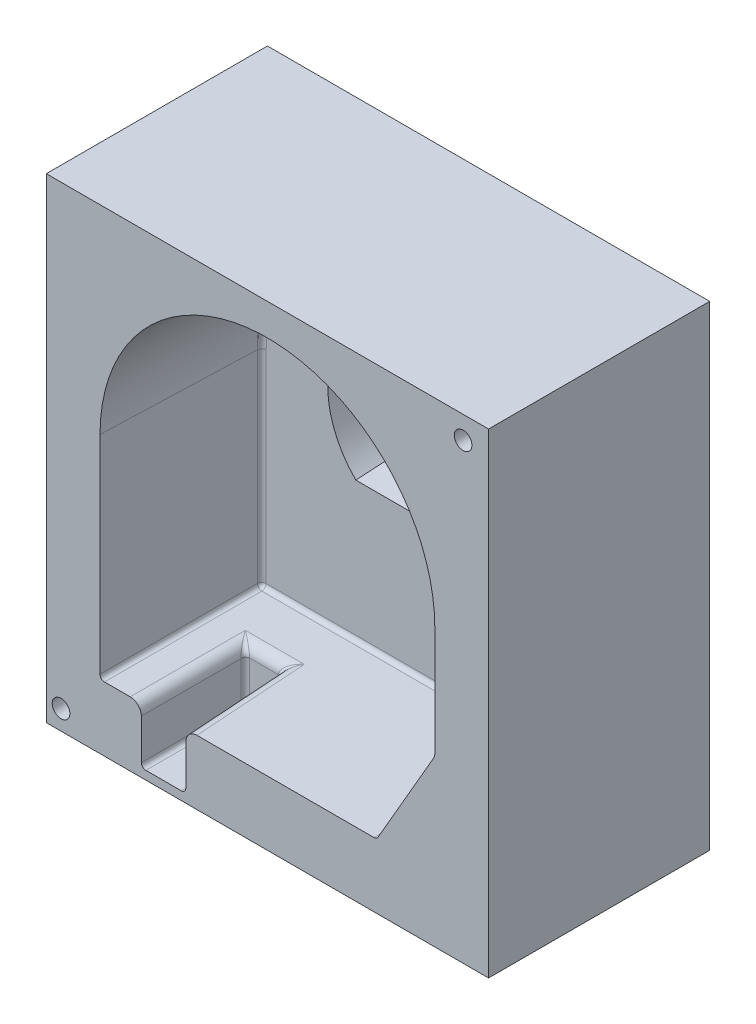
ISO-10303-21;
HEADER;
FILE_DESCRIPTION(('STEP AP214'),'2;1');
FILE_NAME('part.step','',(''),(''),'','','');
FILE_SCHEMA(('AUTOMOTIVE_DESIGN { 1 0 10303 214 1 1 1 1 }'));
ENDSEC;
DATA;
#1=APPLICATION_CONTEXT('core data for automotive mechanical design processes');
#2=APPLICATION_PROTOCOL_DEFINITION('international standard','automotive_design',2000,#1);
#3=PRODUCT_CONTEXT('',#1,'mechanical');
#4=PRODUCT('Part','Part','',(#3));
#5=PRODUCT_RELATED_PRODUCT_CATEGORY('part','',(#4));
#6=PRODUCT_DEFINITION_FORMATION('','',#4);
#7=PRODUCT_DEFINITION_CONTEXT('part definition',#1,'design');
#8=PRODUCT_DEFINITION('design','',#6,#7);
#9=PRODUCT_DEFINITION_SHAPE('','',#8);
#10=(LENGTH_UNIT() NAMED_UNIT(*) SI_UNIT(.MILLI.,.METRE.));
#11=(NAMED_UNIT(*) PLANE_ANGLE_UNIT() SI_UNIT($,.RADIAN.));
#12=(NAMED_UNIT(*) SI_UNIT($,.STERADIAN.) SOLID_ANGLE_UNIT());
#13=UNCERTAINTY_MEASURE_WITH_UNIT(LENGTH_MEASURE(1.E-05),#10,'distance_accuracy_value','');
#14=(GEOMETRIC_REPRESENTATION_CONTEXT(3) GLOBAL_UNCERTAINTY_ASSIGNED_CONTEXT((#13)) GLOBAL_UNIT_ASSIGNED_CONTEXT((#10,
#11,#12)) REPRESENTATION_CONTEXT('',''));
#15=CARTESIAN_POINT('',(0.,0.,0.));
#16=DIRECTION('',(0.,0.,1.));
#17=DIRECTION('',(1.,0.,0.));
#18=AXIS2_PLACEMENT_3D('',#15,#16,#17);
#19=CARTESIAN_POINT('',(0.,0.,0.));
#20=DIRECTION('',(0.,0.,1.));
#21=DIRECTION('',(1.,0.,0.));
#22=AXIS2_PLACEMENT_3D('',#19,#20,#21);
#23=PLANE('',#22);
#24=DIRECTION('',(0.,1.,0.));
#25=VECTOR('',#24,1.);
#26=CARTESIAN_POINT('',(200.,180.,0.));
#27=LINE('',#26,#25);
#28=CARTESIAN_POINT('',(200.,-250.,0.));
#29=VERTEX_POINT('',#28);
#30=CARTESIAN_POINT('',(200.,180.,0.));
#31=VERTEX_POINT('',#30);
#32=EDGE_CURVE('E610',#29,#31,#27,.T.);
#33=ORIENTED_EDGE('',*,*,#32,.T.);
#34=DIRECTION('',(-1.,0.,0.));
#35=VECTOR('',#34,1.);
#36=CARTESIAN_POINT('',(-200.,180.,0.));
#37=LINE('',#36,#35);
#38=CARTESIAN_POINT('',(-200.,180.,0.));
#39=VERTEX_POINT('',#38);
#40=EDGE_CURVE('E604',#31,#39,#37,.T.);
#41=ORIENTED_EDGE('',*,*,#40,.T.);
#42=DIRECTION('',(0.,-1.,0.));
#43=VECTOR('',#42,1.);
#44=CARTESIAN_POINT('',(-200.,180.,0.));
#45=LINE('',#44,#43);
#46=CARTESIAN_POINT('',(-200.,-250.,0.));
#47=VERTEX_POINT('',#46);
#48=EDGE_CURVE('E616',#39,#47,#45,.T.);
#49=ORIENTED_EDGE('',*,*,#48,.T.);
#50=DIRECTION('',(1.,0.,0.));
#51=VECTOR('',#50,1.);
#52=CARTESIAN_POINT('',(200.,-250.,0.));
#53=LINE('',#52,#51);
#54=EDGE_CURVE('E613',#47,#29,#53,.T.);
#55=ORIENTED_EDGE('',*,*,#54,.T.);
#56=EDGE_LOOP('',(#33,#41,#49,#55));
#57=FACE_BOUND('',#56,.T.);
#58=CARTESIAN_POINT('',(-186.687242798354,-232.30452674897,0.));
#59=DIRECTION('',(0.,0.,1.));
#60=DIRECTION('',(1.,0.,0.));
#61=AXIS2_PLACEMENT_3D('',#58,#59,#60);
#62=CIRCLE('',#61,8.00000000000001);
#63=CARTESIAN_POINT('',(-178.687242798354,-232.30452674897,0.));
#64=VERTEX_POINT('',#63);
#65=EDGE_CURVE('E569',#64,#64,#62,.F.);
#66=ORIENTED_EDGE('',*,*,#65,.T.);
#67=EDGE_LOOP('',(#66));
#68=FACE_BOUND('',#67,.T.);
#69=DIRECTION('',(1.,0.,0.));
#70=VECTOR('',#69,1.);
#71=CARTESIAN_POINT('',(-146.464646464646,-191.806977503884,0.));
#72=LINE('',#71,#70);
#73=CARTESIAN_POINT('',(-124.124056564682,-191.806977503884,0.));
#74=VERTEX_POINT('',#73);
#75=CARTESIAN_POINT('',(-147.364994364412,-191.806977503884,0.));
#76=VERTEX_POINT('',#75);
#77=EDGE_CURVE('E577',#74,#76,#72,.F.);
#78=ORIENTED_EDGE('',*,*,#77,.T.);
#79=CARTESIAN_POINT('',(-147.360070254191,-187.764110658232,-1.17518891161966E-12));
#80=DIRECTION('',(0.,0.,-1.));
#81=DIRECTION('',(-0.707106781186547,-0.707106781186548,0.));
#82=AXIS2_PLACEMENT_3D('',#79,#80,#81);
#83=ELLIPSE('',#82,4.04532815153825,4.04040404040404);
#84=CARTESIAN_POINT('',(-151.402937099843,-187.769034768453,0.));
#85=VERTEX_POINT('',#84);
#86=EDGE_CURVE('E623',#85,#76,#83,.F.);
#87=ORIENTED_EDGE('',*,*,#86,.F.);
#88=DIRECTION('',(0.,-1.,0.));
#89=VECTOR('',#88,1.);
#90=CARTESIAN_POINT('',(-151.402937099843,-186.868686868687,0.));
#91=LINE('',#90,#89);
#92=CARTESIAN_POINT('',(-151.402937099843,0.,0.));
#93=VERTEX_POINT('',#92);
#94=EDGE_CURVE('E587',#85,#93,#91,.F.);
#95=ORIENTED_EDGE('',*,*,#94,.T.);
#96=CARTESIAN_POINT('',(0.,0.,0.));
#97=DIRECTION('',(0.,0.,-1.));
#98=DIRECTION('',(-1.,0.,0.));
#99=AXIS2_PLACEMENT_3D('',#96,#97,#98);
#100=CIRCLE('',#99,151.402937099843);
#101=CARTESIAN_POINT('',(151.402937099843,0.,0.));
#102=VERTEX_POINT('',#101);
#103=EDGE_CURVE('E358',#93,#102,#100,.T.);
#104=ORIENTED_EDGE('',*,*,#103,.T.);
#105=DIRECTION('',(0.,1.,0.));
#106=VECTOR('',#105,1.);
#107=CARTESIAN_POINT('',(151.402937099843,-186.868686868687,0.));
#108=LINE('',#107,#106);
#109=CARTESIAN_POINT('',(151.402937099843,-98.0096756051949,0.));
#110=VERTEX_POINT('',#109);
#111=EDGE_CURVE('E568',#102,#110,#108,.F.);
#112=ORIENTED_EDGE('',*,*,#111,.T.);
#113=CARTESIAN_POINT('',(141.295769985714,-98.0063770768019,4.36780153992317E-12));
#114=DIRECTION('',(0.,0.,-1.));
#115=DIRECTION('',(0.965925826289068,-0.258819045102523,0.));
#116=AXIS2_PLACEMENT_3D('',#113,#114,#115);
#117=ELLIPSE('',#116,10.1076090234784,10.1010101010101);
#118=CARTESIAN_POINT('',(150.050482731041,-103.057104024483,0.));
#119=VERTEX_POINT('',#118);
#120=EDGE_CURVE('E550',#110,#119,#117,.T.);
#121=ORIENTED_EDGE('',*,*,#120,.T.);
#122=DIRECTION('',(0.500000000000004,0.866025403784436,0.));
#123=VECTOR('',#122,1.);
#124=CARTESIAN_POINT('',(39.6302204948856,-294.310608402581,0.));
#125=LINE('',#124,#123);
#126=CARTESIAN_POINT('',(99.9763730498,-189.788006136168,0.));
#127=VERTEX_POINT('',#126);
#128=EDGE_CURVE('E564',#119,#127,#125,.F.);
#129=ORIENTED_EDGE('',*,*,#128,.T.);
#130=CARTESIAN_POINT('',(96.4765691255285,-187.764110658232,-5.15028886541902E-12));
#131=DIRECTION('',(0.,0.,-1.));
#132=DIRECTION('',(0.499999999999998,-0.86602540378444,0.));
#133=AXIS2_PLACEMENT_3D('',#130,#131,#132);
#134=ELLIPSE('',#133,4.04368744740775,4.04040404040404);
#135=CARTESIAN_POINT('',(96.4794120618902,-191.806977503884,-1.63177117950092E-13));
#136=VERTEX_POINT('',#135);
#137=EDGE_CURVE('E621',#136,#127,#134,.F.);
#138=ORIENTED_EDGE('',*,*,#137,.F.);
#139=DIRECTION('',(-1.,0.,0.));
#140=VECTOR('',#139,1.);
#141=CARTESIAN_POINT('',(-146.464646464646,-191.806977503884,-1.63177117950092E-13));
#142=LINE('',#141,#140);
#143=CARTESIAN_POINT('',(-63.7547313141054,-191.806977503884,-1.63177117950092E-13));
#144=VERTEX_POINT('',#143);
#145=EDGE_CURVE('E574',#136,#144,#142,.T.);
#146=ORIENTED_EDGE('',*,*,#145,.T.);
#147=CARTESIAN_POINT('',(-63.7424210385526,-201.914144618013,-1.31462251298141E-12));
#148=DIRECTION('',(0.,0.,1.));
#149=DIRECTION('',(-0.707106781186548,0.707106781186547,0.));
#150=AXIS2_PLACEMENT_3D('',#147,#148,#149);
#151=ELLIPSE('',#150,10.1133203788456,10.1010101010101);
#152=CARTESIAN_POINT('',(-73.8495881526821,-201.90183434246,0.));
#153=VERTEX_POINT('',#152);
#154=EDGE_CURVE('E590',#144,#153,#151,.T.);
#155=ORIENTED_EDGE('',*,*,#154,.T.);
#156=DIRECTION('',(0.,1.,0.));
#157=VECTOR('',#156,1.);
#158=CARTESIAN_POINT('',(-73.8495881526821,-186.868686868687,0.));
#159=LINE('',#158,#157);
#160=CARTESIAN_POINT('',(-73.8495881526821,-238.274085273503,0.));
#161=VERTEX_POINT('',#160);
#162=EDGE_CURVE('E581',#153,#161,#159,.F.);
#163=ORIENTED_EDGE('',*,*,#162,.T.);
#164=CARTESIAN_POINT('',(-77.8924549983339,-238.269161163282,-2.15394831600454E-12));
#165=DIRECTION('',(0.,0.,-1.));
#166=DIRECTION('',(0.707106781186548,-0.707106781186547,0.));
#167=AXIS2_PLACEMENT_3D('',#164,#165,#166);
#168=ELLIPSE('',#167,4.04532815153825,4.04040404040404);
#169=CARTESIAN_POINT('',(-77.8875308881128,-242.312028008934,0.));
#170=VERTEX_POINT('',#169);
#171=EDGE_CURVE('E363',#170,#161,#168,.F.);
#172=ORIENTED_EDGE('',*,*,#171,.F.);
#173=DIRECTION('',(1.,0.,0.));
#174=VECTOR('',#173,1.);
#175=CARTESIAN_POINT('',(-146.464646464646,-242.312028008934,0.));
#176=LINE('',#175,#174);
#177=CARTESIAN_POINT('',(-109.991256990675,-242.312028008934,0.));
#178=VERTEX_POINT('',#177);
#179=EDGE_CURVE('E583',#170,#178,#176,.F.);
#180=ORIENTED_EDGE('',*,*,#179,.T.);
#181=CARTESIAN_POINT('',(-109.986332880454,-238.269161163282,-3.04879841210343E-12));
#182=DIRECTION('',(0.,0.,-1.));
#183=DIRECTION('',(-0.707106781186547,-0.707106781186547,0.));
#184=AXIS2_PLACEMENT_3D('',#181,#182,#183);
#185=ELLIPSE('',#184,4.04532815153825,4.04040404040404);
#186=CARTESIAN_POINT('',(-114.029199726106,-238.274085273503,0.));
#187=VERTEX_POINT('',#186);
#188=EDGE_CURVE('E11',#187,#178,#185,.F.);
#189=ORIENTED_EDGE('',*,*,#188,.F.);
#190=DIRECTION('',(0.,-1.,0.));
#191=VECTOR('',#190,1.);
#192=CARTESIAN_POINT('',(-114.029199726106,-186.868686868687,0.));
#193=LINE('',#192,#191);
#194=CARTESIAN_POINT('',(-114.029199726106,-201.90183434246,0.));
#195=VERTEX_POINT('',#194);
#196=EDGE_CURVE('E585',#187,#195,#193,.F.);
#197=ORIENTED_EDGE('',*,*,#196,.T.);
#198=CARTESIAN_POINT('',(-124.136366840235,-201.914144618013,-1.48229054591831E-12));
#199=DIRECTION('',(0.,0.,1.));
#200=DIRECTION('',(0.707106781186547,0.707106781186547,0.));
#201=AXIS2_PLACEMENT_3D('',#198,#199,#200);
#202=ELLIPSE('',#201,10.1133203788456,10.1010101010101);
#203=EDGE_CURVE('E570',#195,#74,#202,.T.);
#204=ORIENTED_EDGE('',*,*,#203,.T.);
#205=EDGE_LOOP('',(#78,#87,#95,#104,#112,#121,#129,#138,#146,#155,#163,#172,#180,#189,#197,#204));
#206=FACE_BOUND('',#205,.T.);
#207=CARTESIAN_POINT('',(176.954732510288,159.650205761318,0.));
#208=DIRECTION('',(0.,0.,1.));
#209=DIRECTION('',(1.,0.,0.));
#210=AXIS2_PLACEMENT_3D('',#207,#208,#209);
#211=CIRCLE('',#210,8.00000000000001);
#212=CARTESIAN_POINT('',(184.954732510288,159.650205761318,0.));
#213=VERTEX_POINT('',#212);
#214=EDGE_CURVE('E607',#213,#213,#211,.F.);
#215=ORIENTED_EDGE('',*,*,#214,.T.);
#216=EDGE_LOOP('',(#215));
#217=FACE_BOUND('',#216,.T.);
#218=ADVANCED_FACE('F354',(#57,#68,#206,#217),#23,.T.);
#219=CARTESIAN_POINT('',(0.,0.,-141.414141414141));
#220=DIRECTION('',(0.,0.,1.));
#221=DIRECTION('',(1.,0.,0.));
#222=AXIS2_PLACEMENT_3D('',#219,#220,#221);
#223=PLANE('',#222);
#224=DIRECTION('',(1.,0.,0.));
#225=VECTOR('',#224,1.);
#226=CARTESIAN_POINT('',(175.,-61.4531270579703,-141.414141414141));
#227=LINE('',#226,#225);
#228=CARTESIAN_POINT('',(-61.4773844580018,-61.4531270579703,-141.414141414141));
#229=VERTEX_POINT('',#228);
#230=CARTESIAN_POINT('',(61.4773844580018,-61.4531270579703,-141.414141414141));
#231=VERTEX_POINT('',#230);
#232=EDGE_CURVE('E811',#229,#231,#227,.T.);
#233=ORIENTED_EDGE('',*,*,#232,.F.);
#234=CARTESIAN_POINT('',(0.,0.,-141.414141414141));
#235=DIRECTION('',(0.,0.,1.));
#236=DIRECTION('',(1.,0.,0.));
#237=AXIS2_PLACEMENT_3D('',#234,#235,#236);
#238=CIRCLE('',#237,86.925);
#239=EDGE_CURVE('E628',#229,#231,#238,.F.);
#240=ORIENTED_EDGE('',*,*,#239,.T.);
#241=EDGE_LOOP('',(#233,#240));
#242=FACE_BOUND('',#241,.T.);
#243=DIRECTION('',(0.,-1.,0.));
#244=VECTOR('',#243,1.);
#245=CARTESIAN_POINT('',(142.562873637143,0.,-141.414141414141));
#246=LINE('',#245,#244);
#247=CARTESIAN_POINT('',(142.562873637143,0.,-141.414141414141));
#248=VERTEX_POINT('',#247);
#249=CARTESIAN_POINT('',(142.562873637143,-96.7229512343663,-141.414141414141));
#250=VERTEX_POINT('',#249);
#251=EDGE_CURVE('E658',#248,#250,#246,.T.);
#252=ORIENTED_EDGE('',*,*,#251,.F.);
#253=CARTESIAN_POINT('',(0.,0.,-141.414141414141));
#254=DIRECTION('',(0.,0.,1.));
#255=DIRECTION('',(1.,0.,0.));
#256=AXIS2_PLACEMENT_3D('',#253,#254,#255);
#257=CIRCLE('',#256,142.562873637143);
#258=CARTESIAN_POINT('',(-142.562873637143,0.,-141.414141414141));
#259=VERTEX_POINT('',#258);
#260=EDGE_CURVE('E662',#259,#248,#257,.F.);
#261=ORIENTED_EDGE('',*,*,#260,.F.);
#262=DIRECTION('',(0.,1.,0.));
#263=VECTOR('',#262,1.);
#264=CARTESIAN_POINT('',(-142.562873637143,0.,-141.414141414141));
#265=LINE('',#264,#263);
#266=CARTESIAN_POINT('',(-142.562873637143,-182.966914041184,-141.414141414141));
#267=VERTEX_POINT('',#266);
#268=EDGE_CURVE('E660',#267,#259,#265,.T.);
#269=ORIENTED_EDGE('',*,*,#268,.F.);
#270=DIRECTION('',(-1.,0.,0.));
#271=VECTOR('',#270,1.);
#272=CARTESIAN_POINT('',(0.,-182.966914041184,-141.414141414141));
#273=LINE('',#272,#271);
#274=CARTESIAN_POINT('',(93.7069063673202,-182.966914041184,-141.414141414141));
#275=VERTEX_POINT('',#274);
#276=EDGE_CURVE('E651',#275,#267,#273,.T.);
#277=ORIENTED_EDGE('',*,*,#276,.F.);
#278=DIRECTION('',(-0.500000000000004,-0.866025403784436,0.));
#279=VECTOR('',#278,1.);
#280=CARTESIAN_POINT('',(149.507177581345,-86.3180092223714,-141.414141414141));
#281=LINE('',#280,#279);
#282=CARTESIAN_POINT('',(141.751401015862,-99.7514082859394,-141.414141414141));
#283=VERTEX_POINT('',#282);
#284=EDGE_CURVE('E653',#283,#275,#281,.T.);
#285=ORIENTED_EDGE('',*,*,#284,.F.);
#286=CARTESIAN_POINT('',(136.498573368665,-96.7209721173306,-141.414141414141));
#287=DIRECTION('',(0.,0.,1.));
#288=DIRECTION('',(-0.965925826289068,0.258819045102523,0.));
#289=AXIS2_PLACEMENT_3D('',#286,#287,#288);
#290=ELLIPSE('',#289,6.06456541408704,6.06060606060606);
#291=EDGE_CURVE('E655',#250,#283,#290,.F.);
#292=ORIENTED_EDGE('',*,*,#291,.F.);
#293=EDGE_LOOP('',(#252,#261,#269,#277,#285,#292));
#294=FACE_BOUND('',#293,.T.);
#295=ADVANCED_FACE('F758',(#242,#294),#223,.T.);
#296=CARTESIAN_POINT('',(-146.464646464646,-191.806977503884,0.));
#297=DIRECTION('',(0.,-0.999390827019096,-0.034899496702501));
#298=DIRECTION('',(0.,0.0348994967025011,-0.999390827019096));
#299=AXIS2_PLACEMENT_3D('',#296,#297,#298);
#300=PLANE('',#299);
#301=ORIENTED_EDGE('',*,*,#77,.F.);
#302=DIRECTION('',(-0.0348782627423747,-0.0348782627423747,0.998782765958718));
#303=VECTOR('',#302,1.);
#304=CARTESIAN_POINT('',(-124.111776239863,-191.794697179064,-0.35166249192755));
#305=LINE('',#304,#303);
#306=CARTESIAN_POINT('',(-120.609016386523,-188.291937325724,-100.657580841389));
#307=VERTEX_POINT('',#306);
#308=EDGE_CURVE('E715',#307,#74,#305,.T.);
#309=ORIENTED_EDGE('',*,*,#308,.F.);
#310=DIRECTION('',(-1.,0.,0.));
#311=VECTOR('',#310,1.);
#312=CARTESIAN_POINT('',(-110.854584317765,-188.291937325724,-100.657580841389));
#313=LINE('',#312,#311);
#314=CARTESIAN_POINT('',(-67.2697714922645,-188.291937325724,-100.657580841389));
#315=VERTEX_POINT('',#314);
#316=EDGE_CURVE('E712',#315,#307,#313,.T.);
#317=ORIENTED_EDGE('',*,*,#316,.F.);
#318=DIRECTION('',(0.0348782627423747,-0.0348782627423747,0.998782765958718));
#319=VECTOR('',#318,1.);
#320=CARTESIAN_POINT('',(-66.9416270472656,-188.620081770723,-91.2607534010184));
#321=LINE('',#320,#319);
#322=EDGE_CURVE('E709',#144,#315,#321,.F.);
#323=ORIENTED_EDGE('',*,*,#322,.F.);
#324=ORIENTED_EDGE('',*,*,#145,.F.);
#325=DIRECTION('',(0.0201451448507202,-0.0348924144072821,0.999188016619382));
#326=VECTOR('',#325,1.);
#327=CARTESIAN_POINT('',(96.380818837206,-191.636209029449,-4.89016928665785));
#328=LINE('',#327,#326);
#329=CARTESIAN_POINT('',(93.7069063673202,-187.004856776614,-137.514745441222));
#330=VERTEX_POINT('',#329);
#331=EDGE_CURVE('E645',#330,#136,#328,.T.);
#332=ORIENTED_EDGE('',*,*,#331,.F.);
#333=DIRECTION('',(1.,0.,0.));
#334=VECTOR('',#333,1.);
#335=CARTESIAN_POINT('',(-146.464646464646,-187.004856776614,-137.514745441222));
#336=LINE('',#335,#334);
#337=CARTESIAN_POINT('',(-142.562873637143,-187.004856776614,-137.514745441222));
#338=VERTEX_POINT('',#337);
#339=EDGE_CURVE('E648',#338,#330,#336,.T.);
#340=ORIENTED_EDGE('',*,*,#339,.F.);
#341=DIRECTION('',(-0.0348782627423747,-0.0348782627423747,0.998782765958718));
#342=VECTOR('',#341,1.);
#343=CARTESIAN_POINT('',(-147.363899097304,-191.805882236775,-0.0313643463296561));
#344=LINE('',#343,#342);
#345=EDGE_CURVE('E643',#76,#338,#344,.F.);
#346=ORIENTED_EDGE('',*,*,#345,.F.);
#347=EDGE_LOOP('',(#301,#309,#317,#323,#324,#332,#340,#346));
#348=FACE_BOUND('',#347,.T.);
#349=ADVANCED_FACE('F798',(#348),#300,.F.);
#350=CARTESIAN_POINT('',(39.6302204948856,-294.310608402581,0.));
#351=DIRECTION('',(0.865497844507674,-0.499695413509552,-0.034899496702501));
#352=DIRECTION('',(0.500000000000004,0.866025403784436,0.));
#353=AXIS2_PLACEMENT_3D('',#350,#351,#352);
#354=PLANE('',#353);
#355=ORIENTED_EDGE('',*,*,#128,.F.);
#356=DIRECTION('',(0.0348979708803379,-0.00935088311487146,0.999347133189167));
#357=VECTOR('',#356,1.);
#358=CARTESIAN_POINT('',(149.978416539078,-103.037793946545,-2.0637057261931));
#359=LINE('',#358,#357);
#360=CARTESIAN_POINT('',(145.248362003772,-101.770379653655,-137.514745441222));
#361=VERTEX_POINT('',#360);
#362=EDGE_CURVE('E546',#361,#119,#359,.T.);
#363=ORIENTED_EDGE('',*,*,#362,.F.);
#364=DIRECTION('',(0.500000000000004,0.866025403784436,0.));
#365=VECTOR('',#364,1.);
#366=CARTESIAN_POINT('',(35.4714619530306,-291.909548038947,-137.514745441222));
#367=LINE('',#366,#365);
#368=CARTESIAN_POINT('',(97.20386735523,-184.985885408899,-137.514745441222));
#369=VERTEX_POINT('',#368);
#370=EDGE_CURVE('E636',#369,#361,#367,.T.);
#371=ORIENTED_EDGE('',*,*,#370,.F.);
#372=DIRECTION('',(0.0201451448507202,-0.0348924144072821,0.999188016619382));
#373=VECTOR('',#372,1.);
#374=CARTESIAN_POINT('',(100.025353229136,-189.872842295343,2.4293897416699));
#375=LINE('',#374,#373);
#376=EDGE_CURVE('E573',#127,#369,#375,.F.);
#377=ORIENTED_EDGE('',*,*,#376,.F.);
#378=EDGE_LOOP('',(#355,#363,#371,#377));
#379=FACE_BOUND('',#378,.T.);
#380=ADVANCED_FACE('F572',(#379),#354,.F.);
#381=CARTESIAN_POINT('',(151.402937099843,-186.868686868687,0.));
#382=DIRECTION('',(0.999390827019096,0.,-0.034899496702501));
#383=DIRECTION('',(-0.0348994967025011,0.,-0.999390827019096));
#384=AXIS2_PLACEMENT_3D('',#381,#382,#383);
#385=PLANE('',#384);
#386=DIRECTION('',(0.0348979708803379,-0.00935088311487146,0.999347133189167));
#387=VECTOR('',#386,1.);
#388=CARTESIAN_POINT('',(151.431934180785,-98.0174453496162,0.830367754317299));
#389=LINE('',#388,#387);
#390=CARTESIAN_POINT('',(146.600816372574,-96.7229512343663,-137.514745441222));
#391=VERTEX_POINT('',#390);
#392=EDGE_CURVE('E559',#110,#391,#389,.F.);
#393=ORIENTED_EDGE('',*,*,#392,.F.);
#394=ORIENTED_EDGE('',*,*,#111,.F.);
#395=DIRECTION('',(0.034899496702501,0.,0.999390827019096));
#396=VECTOR('',#395,1.);
#397=CARTESIAN_POINT('',(151.402937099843,0.,0.));
#398=LINE('',#397,#396);
#399=CARTESIAN_POINT('',(146.600816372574,0.,-137.514745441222));
#400=VERTEX_POINT('',#399);
#401=EDGE_CURVE('E717',#102,#400,#398,.F.);
#402=ORIENTED_EDGE('',*,*,#401,.T.);
#403=DIRECTION('',(0.,1.,0.));
#404=VECTOR('',#403,1.);
#405=CARTESIAN_POINT('',(146.600816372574,-186.868686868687,-137.514745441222));
#406=LINE('',#405,#404);
#407=EDGE_CURVE('E633',#391,#400,#406,.T.);
#408=ORIENTED_EDGE('',*,*,#407,.F.);
#409=EDGE_LOOP('',(#393,#394,#402,#408));
#410=FACE_BOUND('',#409,.T.);
#411=ADVANCED_FACE('F1153',(#410),#385,.F.);
#412=CARTESIAN_POINT('',(0.,0.,0.));
#413=DIRECTION('',(0.,0.,1.));
#414=DIRECTION('',(-1.,0.,0.));
#415=AXIS2_PLACEMENT_3D('',#412,#413,#414);
#416=CONICAL_SURFACE('',#415,151.402937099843,0.0349065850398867);
#417=ORIENTED_EDGE('',*,*,#401,.F.);
#418=ORIENTED_EDGE('',*,*,#103,.F.);
#419=DIRECTION('',(-0.034899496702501,0.,0.999390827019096));
#420=VECTOR('',#419,1.);
#421=CARTESIAN_POINT('',(-151.402937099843,0.,0.));
#422=LINE('',#421,#420);
#423=CARTESIAN_POINT('',(-146.600816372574,0.,-137.514745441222));
#424=VERTEX_POINT('',#423);
#425=EDGE_CURVE('E720',#93,#424,#422,.F.);
#426=ORIENTED_EDGE('',*,*,#425,.T.);
#427=CARTESIAN_POINT('',(0.,0.,-137.514745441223));
#428=DIRECTION('',(0.,0.,-1.));
#429=DIRECTION('',(-1.,0.,0.));
#430=AXIS2_PLACEMENT_3D('',#427,#428,#429);
#431=CIRCLE('',#430,146.600816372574);
#432=EDGE_CURVE('E631',#400,#424,#431,.F.);
#433=ORIENTED_EDGE('',*,*,#432,.F.);
#434=EDGE_LOOP('',(#417,#418,#426,#433));
#435=FACE_BOUND('',#434,.T.);
#436=ADVANCED_FACE('F1149',(#435),#416,.F.);
#437=CARTESIAN_POINT('',(-151.402937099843,-186.868686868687,0.));
#438=DIRECTION('',(-0.999390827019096,0.,-0.034899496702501));
#439=DIRECTION('',(-0.0348994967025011,0.,0.999390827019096));
#440=AXIS2_PLACEMENT_3D('',#437,#438,#439);
#441=PLANE('',#440);
#442=DIRECTION('',(0.,-1.,0.));
#443=VECTOR('',#442,1.);
#444=CARTESIAN_POINT('',(-146.600816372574,-186.868686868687,-137.514745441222));
#445=LINE('',#444,#443);
#446=CARTESIAN_POINT('',(-146.600816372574,-182.966914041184,-137.514745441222));
#447=VERTEX_POINT('',#446);
#448=EDGE_CURVE('E641',#424,#447,#445,.T.);
#449=ORIENTED_EDGE('',*,*,#448,.F.);
#450=ORIENTED_EDGE('',*,*,#425,.F.);
#451=ORIENTED_EDGE('',*,*,#94,.F.);
#452=DIRECTION('',(-0.0348782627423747,-0.0348782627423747,0.998782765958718));
#453=VECTOR('',#452,1.);
#454=CARTESIAN_POINT('',(-151.401841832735,-187.767939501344,-0.0313643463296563));
#455=LINE('',#454,#453);
#456=EDGE_CURVE('E638',#447,#85,#455,.T.);
#457=ORIENTED_EDGE('',*,*,#456,.F.);
#458=EDGE_LOOP('',(#449,#450,#451,#457));
#459=FACE_BOUND('',#458,.T.);
#460=ADVANCED_FACE('F1152',(#459),#441,.F.);
#461=CARTESIAN_POINT('',(-114.029199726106,-186.868686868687,0.));
#462=DIRECTION('',(-0.999390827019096,0.,-0.034899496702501));
#463=DIRECTION('',(-0.0348994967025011,0.,0.999390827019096));
#464=AXIS2_PLACEMENT_3D('',#461,#462,#463);
#465=PLANE('',#464);
#466=DIRECTION('',(-0.0348782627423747,-0.0348782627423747,0.998782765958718));
#467=VECTOR('',#466,1.);
#468=CARTESIAN_POINT('',(-110.842303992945,-198.7149386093,-91.2607534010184));
#469=LINE('',#468,#467);
#470=CARTESIAN_POINT('',(-110.990754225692,-198.863388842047,-87.0096949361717));
#471=VERTEX_POINT('',#470);
#472=EDGE_CURVE('E701',#195,#471,#469,.F.);
#473=ORIENTED_EDGE('',*,*,#472,.F.);
#474=ORIENTED_EDGE('',*,*,#196,.F.);
#475=DIRECTION('',(-0.0348782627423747,-0.0348782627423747,0.998782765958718));
#476=VECTOR('',#475,1.);
#477=CARTESIAN_POINT('',(-113.96666540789,-238.211550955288,-1.79074857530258));
#478=LINE('',#477,#476);
#479=CARTESIAN_POINT('',(-110.990754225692,-235.23563977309,-87.0096949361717));
#480=VERTEX_POINT('',#479);
#481=EDGE_CURVE('E676',#480,#187,#478,.T.);
#482=ORIENTED_EDGE('',*,*,#481,.F.);
#483=DIRECTION('',(0.,-1.,0.));
#484=VECTOR('',#483,1.);
#485=CARTESIAN_POINT('',(-110.990754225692,-186.868686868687,-87.0096949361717));
#486=LINE('',#485,#484);
#487=EDGE_CURVE('E674',#471,#480,#486,.T.);
#488=ORIENTED_EDGE('',*,*,#487,.F.);
#489=EDGE_LOOP('',(#473,#474,#482,#488));
#490=FACE_BOUND('',#489,.T.);
#491=ADVANCED_FACE('F942',(#490),#465,.F.);
#492=CARTESIAN_POINT('',(-146.464646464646,-242.312028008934,0.));
#493=DIRECTION('',(0.,-0.999390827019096,-0.034899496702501));
#494=DIRECTION('',(0.,0.0348994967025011,-0.999390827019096));
#495=AXIS2_PLACEMENT_3D('',#492,#493,#494);
#496=PLANE('',#495);
#497=DIRECTION('',(1.,0.,0.));
#498=VECTOR('',#497,1.);
#499=CARTESIAN_POINT('',(-146.464646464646,-239.273582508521,-87.0096949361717));
#500=LINE('',#499,#498);
#501=CARTESIAN_POINT('',(-106.952811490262,-239.273582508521,-87.0096949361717));
#502=VERTEX_POINT('',#501);
#503=CARTESIAN_POINT('',(-80.9259763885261,-239.273582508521,-87.0096949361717));
#504=VERTEX_POINT('',#503);
#505=EDGE_CURVE('E666',#502,#504,#500,.T.);
#506=ORIENTED_EDGE('',*,*,#505,.F.);
#507=DIRECTION('',(-0.0348782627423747,-0.0348782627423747,0.998782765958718));
#508=VECTOR('',#507,1.);
#509=CARTESIAN_POINT('',(-110.035626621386,-242.356397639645,1.27057998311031));
#510=LINE('',#509,#508);
#511=EDGE_CURVE('E668',#178,#502,#510,.F.);
#512=ORIENTED_EDGE('',*,*,#511,.F.);
#513=ORIENTED_EDGE('',*,*,#179,.F.);
#514=DIRECTION('',(0.0348782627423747,-0.0348782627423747,0.998782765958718));
#515=VECTOR('',#514,1.);
#516=CARTESIAN_POINT('',(-77.9709544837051,-242.228604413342,-2.38893921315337));
#517=LINE('',#516,#515);
#518=EDGE_CURVE('E664',#504,#170,#517,.T.);
#519=ORIENTED_EDGE('',*,*,#518,.F.);
#520=EDGE_LOOP('',(#506,#512,#513,#519));
#521=FACE_BOUND('',#520,.T.);
#522=ADVANCED_FACE('F947',(#521),#496,.F.);
#523=CARTESIAN_POINT('',(-73.8495881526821,-186.868686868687,0.));
#524=DIRECTION('',(0.999390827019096,0.,-0.034899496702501));
#525=DIRECTION('',(-0.0348994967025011,0.,-0.999390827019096));
#526=AXIS2_PLACEMENT_3D('',#523,#524,#525);
#527=PLANE('',#526);
#528=DIRECTION('',(0.0348782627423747,-0.0348782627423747,0.998782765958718));
#529=VECTOR('',#528,1.);
#530=CARTESIAN_POINT('',(-73.9121224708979,-238.211550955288,-1.79074857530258));
#531=LINE('',#530,#529);
#532=CARTESIAN_POINT('',(-76.8880336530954,-235.23563977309,-87.0096949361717));
#533=VERTEX_POINT('',#532);
#534=EDGE_CURVE('E672',#161,#533,#531,.F.);
#535=ORIENTED_EDGE('',*,*,#534,.F.);
#536=ORIENTED_EDGE('',*,*,#162,.F.);
#537=DIRECTION('',(0.0348782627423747,-0.0348782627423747,0.998782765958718));
#538=VECTOR('',#537,1.);
#539=CARTESIAN_POINT('',(-73.8618684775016,-201.889554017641,-0.351662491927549));
#540=LINE('',#539,#538);
#541=CARTESIAN_POINT('',(-76.8880336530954,-198.863388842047,-87.0096949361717));
#542=VERTEX_POINT('',#541);
#543=EDGE_CURVE('E704',#542,#153,#540,.T.);
#544=ORIENTED_EDGE('',*,*,#543,.F.);
#545=DIRECTION('',(0.,1.,0.));
#546=VECTOR('',#545,1.);
#547=CARTESIAN_POINT('',(-76.8880336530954,-186.868686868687,-87.0096949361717));
#548=LINE('',#547,#546);
#549=EDGE_CURVE('E670',#533,#542,#548,.T.);
#550=ORIENTED_EDGE('',*,*,#549,.F.);
#551=EDGE_LOOP('',(#535,#536,#544,#550));
#552=FACE_BOUND('',#551,.T.);
#553=ADVANCED_FACE('F756',(#552),#527,.F.);
#554=CARTESIAN_POINT('',(-109.090909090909,-237.373737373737,-90.9090909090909));
#555=DIRECTION('',(0.,0.,1.));
#556=DIRECTION('',(1.,0.,0.));
#557=AXIS2_PLACEMENT_3D('',#554,#555,#556);
#558=PLANE('',#557);
#559=DIRECTION('',(0.,1.,0.));
#560=VECTOR('',#559,1.);
#561=CARTESIAN_POINT('',(-106.952811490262,-237.373737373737,-90.9090909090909));
#562=LINE('',#561,#560);
#563=CARTESIAN_POINT('',(-106.952811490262,-235.23563977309,-90.9090909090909));
#564=VERTEX_POINT('',#563);
#565=CARTESIAN_POINT('',(-106.952811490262,-198.863388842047,-90.9090909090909));
#566=VERTEX_POINT('',#565);
#567=EDGE_CURVE('E687',#564,#566,#562,.T.);
#568=ORIENTED_EDGE('',*,*,#567,.F.);
#569=DIRECTION('',(-1.,0.,0.));
#570=VECTOR('',#569,1.);
#571=CARTESIAN_POINT('',(-109.090909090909,-235.23563977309,-90.9090909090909));
#572=LINE('',#571,#570);
#573=CARTESIAN_POINT('',(-80.9259763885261,-235.23563977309,-90.9090909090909));
#574=VERTEX_POINT('',#573);
#575=EDGE_CURVE('E691',#574,#564,#572,.T.);
#576=ORIENTED_EDGE('',*,*,#575,.F.);
#577=DIRECTION('',(0.,-1.,0.));
#578=VECTOR('',#577,1.);
#579=CARTESIAN_POINT('',(-80.9259763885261,-237.373737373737,-90.9090909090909));
#580=LINE('',#579,#578);
#581=CARTESIAN_POINT('',(-80.9259763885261,-198.863388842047,-90.9090909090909));
#582=VERTEX_POINT('',#581);
#583=EDGE_CURVE('E689',#582,#574,#580,.T.);
#584=ORIENTED_EDGE('',*,*,#583,.F.);
#585=CARTESIAN_POINT('',(-66.7759424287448,-198.880623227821,-90.9090909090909));
#586=DIRECTION('',(0.,0.,1.));
#587=DIRECTION('',(0.707106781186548,-0.707106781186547,0.));
#588=AXIS2_PLACEMENT_3D('',#585,#586,#587);
#589=ELLIPSE('',#588,14.1586485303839,14.1414141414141);
#590=CARTESIAN_POINT('',(-80.9179475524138,-198.386794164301,-90.9090909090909));
#591=VERTEX_POINT('',#590);
#592=EDGE_CURVE('E685',#591,#582,#589,.T.);
#593=ORIENTED_EDGE('',*,*,#592,.F.);
#594=DIRECTION('',(1.,0.,0.));
#595=VECTOR('',#594,1.);
#596=CARTESIAN_POINT('',(-77.0242035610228,-198.386794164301,-90.9090909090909));
#597=LINE('',#596,#595);
#598=CARTESIAN_POINT('',(-106.960840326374,-198.386794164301,-90.9090909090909));
#599=VERTEX_POINT('',#598);
#600=EDGE_CURVE('E706',#599,#591,#597,.T.);
#601=ORIENTED_EDGE('',*,*,#600,.F.);
#602=CARTESIAN_POINT('',(-121.102845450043,-198.880623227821,-90.9090909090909));
#603=DIRECTION('',(0.,0.,1.));
#604=DIRECTION('',(-0.707106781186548,-0.707106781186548,0.));
#605=AXIS2_PLACEMENT_3D('',#602,#603,#604);
#606=ELLIPSE('',#605,14.1586485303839,14.1414141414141);
#607=EDGE_CURVE('E683',#566,#599,#606,.T.);
#608=ORIENTED_EDGE('',*,*,#607,.F.);
#609=EDGE_LOOP('',(#568,#576,#584,#593,#601,#608));
#610=FACE_BOUND('',#609,.T.);
#611=ADVANCED_FACE('F749',(#610),#558,.T.);
#612=CARTESIAN_POINT('',(-63.855347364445,-201.801218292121,-3.23378687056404));
#613=DIRECTION('',(0.0348782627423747,-0.0348782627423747,0.998782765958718));
#614=DIRECTION('',(0.999390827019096,0.,-0.0348994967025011));
#615=AXIS2_PLACEMENT_3D('',#612,#613,#614);
#616=CYLINDRICAL_SURFACE('',#615,10.1010101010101);
#617=CARTESIAN_POINT('',(-66.7759424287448,-198.880623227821,-86.8686868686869));
#618=DIRECTION('',(0.0139180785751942,-0.0139180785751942,-0.999806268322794));
#619=DIRECTION('',(0.706969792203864,-0.706969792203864,0.0196831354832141));
#620=AXIS2_PLACEMENT_3D('',#617,#618,#619);
#621=ELLIPSE('',#620,10.1251241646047,10.1010101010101);
#622=CARTESIAN_POINT('',(-76.8824616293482,-198.522801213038,-87.0143586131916));
#623=VERTEX_POINT('',#622);
#624=EDGE_CURVE('E681',#542,#623,#621,.T.);
#625=ORIENTED_EDGE('',*,*,#624,.F.);
#626=ORIENTED_EDGE('',*,*,#543,.T.);
#627=ORIENTED_EDGE('',*,*,#154,.F.);
#628=ORIENTED_EDGE('',*,*,#322,.T.);
#629=CARTESIAN_POINT('',(-67.2697714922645,-198.386794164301,-101.010101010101));
#630=DIRECTION('',(0.824228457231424,-0.0197620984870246,0.565912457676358));
#631=DIRECTION('',(-0.566257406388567,-0.0287651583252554,0.823726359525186));
#632=AXIS2_PLACEMENT_3D('',#629,#630,#631);
#633=ELLIPSE('',#632,16.9861787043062,10.1010101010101);
#634=EDGE_CURVE('E679',#623,#315,#633,.F.);
#635=ORIENTED_EDGE('',*,*,#634,.F.);
#636=EDGE_LOOP('',(#625,#626,#627,#628,#635));
#637=FACE_BOUND('',#636,.T.);
#638=ADVANCED_FACE('F745',(#637),#616,.T.);
#639=CARTESIAN_POINT('',(-124.105768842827,-201.883546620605,-0.876212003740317));
#640=DIRECTION('',(-0.0348782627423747,-0.0348782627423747,0.998782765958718));
#641=DIRECTION('',(0.999390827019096,0.,0.034899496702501));
#642=AXIS2_PLACEMENT_3D('',#639,#640,#641);
#643=CYLINDRICAL_SURFACE('',#642,10.1010101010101);
#644=ORIENTED_EDGE('',*,*,#308,.T.);
#645=ORIENTED_EDGE('',*,*,#203,.F.);
#646=ORIENTED_EDGE('',*,*,#472,.T.);
#647=CARTESIAN_POINT('',(-121.102845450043,-198.880623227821,-86.8686868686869));
#648=DIRECTION('',(-0.0139180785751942,-0.0139180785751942,-0.999806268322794));
#649=DIRECTION('',(-0.706969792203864,-0.706969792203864,0.0196831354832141));
#650=AXIS2_PLACEMENT_3D('',#647,#648,#649);
#651=ELLIPSE('',#650,10.1251241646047,10.1010101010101);
#652=CARTESIAN_POINT('',(-110.99632624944,-198.522801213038,-87.0143586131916));
#653=VERTEX_POINT('',#652);
#654=EDGE_CURVE('E695',#653,#471,#651,.T.);
#655=ORIENTED_EDGE('',*,*,#654,.F.);
#656=CARTESIAN_POINT('',(-120.609016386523,-198.386794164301,-101.010101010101));
#657=DIRECTION('',(0.824228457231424,0.0197620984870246,-0.565912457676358));
#658=DIRECTION('',(-0.566257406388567,0.0287651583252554,-0.823726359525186));
#659=AXIS2_PLACEMENT_3D('',#656,#657,#658);
#660=ELLIPSE('',#659,16.9861787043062,10.1010101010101);
#661=EDGE_CURVE('E693',#307,#653,#660,.T.);
#662=ORIENTED_EDGE('',*,*,#661,.F.);
#663=EDGE_LOOP('',(#644,#645,#646,#655,#662));
#664=FACE_BOUND('',#663,.T.);
#665=ADVANCED_FACE('F748',(#664),#643,.T.);
#666=CARTESIAN_POINT('',(-146.464646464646,-198.386794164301,-101.010101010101));
#667=DIRECTION('',(-1.,0.,0.));
#668=DIRECTION('',(0.,0.,1.));
#669=AXIS2_PLACEMENT_3D('',#666,#667,#668);
#670=CYLINDRICAL_SURFACE('',#669,10.1010101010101);
#671=ORIENTED_EDGE('',*,*,#600,.T.);
#672=CARTESIAN_POINT('',(-67.2697714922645,-198.386794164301,-101.010101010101));
#673=DIRECTION('',(0.59466053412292,-0.0280583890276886,0.80348713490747));
#674=DIRECTION('',(-0.803976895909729,-0.0207533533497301,0.594298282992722));
#675=AXIS2_PLACEMENT_3D('',#672,#673,#674);
#676=ELLIPSE('',#675,16.9861787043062,10.1010101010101);
#677=EDGE_CURVE('E558',#315,#591,#676,.T.);
#678=ORIENTED_EDGE('',*,*,#677,.F.);
#679=ORIENTED_EDGE('',*,*,#316,.T.);
#680=CARTESIAN_POINT('',(-120.609016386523,-198.386794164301,-101.010101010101));
#681=DIRECTION('',(0.59466053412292,0.0280583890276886,-0.80348713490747));
#682=DIRECTION('',(-0.803976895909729,0.0207533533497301,-0.594298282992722));
#683=AXIS2_PLACEMENT_3D('',#680,#681,#682);
#684=ELLIPSE('',#683,16.9861787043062,10.1010101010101);
#685=EDGE_CURVE('E697',#599,#307,#684,.F.);
#686=ORIENTED_EDGE('',*,*,#685,.F.);
#687=EDGE_LOOP('',(#671,#678,#679,#686));
#688=FACE_BOUND('',#687,.T.);
#689=ADVANCED_FACE('F742',(#688),#670,.T.);
#690=CARTESIAN_POINT('',(141.337077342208,-98.0174453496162,1.18288792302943));
#691=DIRECTION('',(-0.0348979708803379,0.00935088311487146,-0.999347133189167));
#692=DIRECTION('',(-0.999390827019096,0.,0.034899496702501));
#693=AXIS2_PLACEMENT_3D('',#690,#691,#692);
#694=CYLINDRICAL_SURFACE('',#693,10.1010101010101);
#695=ORIENTED_EDGE('',*,*,#362,.T.);
#696=ORIENTED_EDGE('',*,*,#120,.F.);
#697=ORIENTED_EDGE('',*,*,#392,.T.);
#698=CARTESIAN_POINT('',(136.498573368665,-96.7209721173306,-137.373737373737));
#699=DIRECTION('',(-0.0139559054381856,0.00373947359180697,-0.99989561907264));
#700=DIRECTION('',(-0.965825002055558,0.258792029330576,0.0144482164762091));
#701=AXIS2_PLACEMENT_3D('',#698,#699,#700);
#702=ELLIPSE('',#701,10.1033862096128,10.1010101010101);
#703=EDGE_CURVE('E553',#361,#391,#702,.F.);
#704=ORIENTED_EDGE('',*,*,#703,.F.);
#705=EDGE_LOOP('',(#695,#696,#697,#704));
#706=FACE_BOUND('',#705,.T.);
#707=ADVANCED_FACE('F548',(#706),#694,.F.);
#708=CARTESIAN_POINT('',(-67.2697714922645,-208.481651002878,-101.362621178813));
#709=CARTESIAN_POINT('',(-67.2697714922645,-208.481651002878,-101.362621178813));
#710=CARTESIAN_POINT('',(-67.2697714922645,-208.481651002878,-101.362621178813));
#711=CARTESIAN_POINT('',(-67.5673178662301,-208.489319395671,-101.142675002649));
#712=CARTESIAN_POINT('',(-67.5233284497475,-208.490839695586,-101.100221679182));
#713=CARTESIAN_POINT('',(-67.4793395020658,-208.492284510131,-101.057765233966));
#714=CARTESIAN_POINT('',(-67.8648198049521,-208.489823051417,-100.922511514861));
#715=CARTESIAN_POINT('',(-67.7770212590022,-208.490010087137,-100.837331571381));
#716=CARTESIAN_POINT('',(-67.6888762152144,-208.49575283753,-100.752704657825));
#717=CARTESIAN_POINT('',(-68.4591873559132,-208.476405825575,-100.482151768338));
#718=CARTESIAN_POINT('',(-68.2829744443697,-208.468441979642,-100.312340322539));
#719=CARTESIAN_POINT('',(-68.1075014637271,-208.488258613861,-100.14273232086));
#720=CARTESIAN_POINT('',(-68.7560529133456,-208.462483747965,-100.261955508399));
#721=CARTESIAN_POINT('',(-68.5355807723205,-208.44765956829,-100.049879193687));
#722=CARTESIAN_POINT('',(-68.3165899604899,-208.477294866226,-99.8378205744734));
#723=CARTESIAN_POINT('',(-69.6397522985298,-208.399297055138,-99.6057233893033));
#724=CARTESIAN_POINT('',(-69.2863785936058,-208.355705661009,-99.2687368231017));
#725=CARTESIAN_POINT('',(-68.9389975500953,-208.422914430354,-98.9294102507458));
#726=CARTESIAN_POINT('',(-70.2247780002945,-208.32874377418,-99.1702823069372));
#727=CARTESIAN_POINT('',(-69.7818791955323,-208.254715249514,-98.7518024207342));
#728=CARTESIAN_POINT('',(-69.3510431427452,-208.358191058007,-98.3270224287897));
#729=CARTESIAN_POINT('',(-71.3745144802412,-208.130702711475,-98.3124470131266));
#730=CARTESIAN_POINT('',(-70.7441601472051,-207.977247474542,-97.7450557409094));
#731=CARTESIAN_POINT('',(-70.1608261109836,-208.171607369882,-97.141090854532));
#732=CARTESIAN_POINT('',(-71.9394007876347,-208.004154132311,-97.8899556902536));
#733=CARTESIAN_POINT('',(-71.2136703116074,-207.80043670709,-97.2524033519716));
#734=CARTESIAN_POINT('',(-70.5586871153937,-208.050688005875,-96.5573999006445));
#735=CARTESIAN_POINT('',(-73.0391717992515,-207.695805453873,-97.0652477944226));
#736=CARTESIAN_POINT('',(-72.1117466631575,-207.377975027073,-96.3071182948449));
#737=CARTESIAN_POINT('',(-71.3332783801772,-207.753298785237,-95.4188541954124));
#738=CARTESIAN_POINT('',(-73.5744503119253,-207.515387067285,-96.662788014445));
#739=CARTESIAN_POINT('',(-72.5429402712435,-207.131788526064,-95.8517445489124));
#740=CARTESIAN_POINT('',(-71.7102860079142,-207.578214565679,-94.8636438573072));
#741=CARTESIAN_POINT('',(-74.6055746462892,-207.101947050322,-95.8852156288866));
#742=CARTESIAN_POINT('',(-73.35294958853,-206.580509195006,-94.9932108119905));
#743=CARTESIAN_POINT('',(-72.4365280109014,-207.175049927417,-93.791823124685));
#744=CARTESIAN_POINT('',(-75.102125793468,-206.87070304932,-95.5096430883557));
#745=CARTESIAN_POINT('',(-73.7342141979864,-206.274719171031,-94.587489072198));
#746=CARTESIAN_POINT('',(-72.7862591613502,-206.948754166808,-93.2745515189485));
#747=CARTESIAN_POINT('',(-76.0469934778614,-206.359148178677,-94.7924829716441));
#748=CARTESIAN_POINT('',(-74.4346266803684,-205.617887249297,-93.8388269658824));
#749=CARTESIAN_POINT('',(-73.4517488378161,-206.446615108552,-92.2877578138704));
#750=CARTESIAN_POINT('',(-76.4964079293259,-206.080930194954,-94.4501559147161));
#751=CARTESIAN_POINT('',(-74.7559437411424,-205.266073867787,-93.4936120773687));
#752=CARTESIAN_POINT('',(-73.7682806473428,-206.172875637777,-91.8171829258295));
#753=CARTESIAN_POINT('',(-77.3388440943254,-205.479958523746,-93.8056828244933));
#754=CARTESIAN_POINT('',(-75.329583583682,-204.534796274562,-92.8737044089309));
#755=CARTESIAN_POINT('',(-74.3616257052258,-205.580299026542,-90.9323067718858));
#756=CARTESIAN_POINT('',(-77.7334161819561,-205.159477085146,-93.502468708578));
#757=CARTESIAN_POINT('',(-75.5836792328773,-204.154646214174,-92.5971507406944));
#758=CARTESIAN_POINT('',(-74.6395309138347,-205.263749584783,-90.5164949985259));
#759=CARTESIAN_POINT('',(-78.459130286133,-204.479036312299,-92.9416064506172));
#760=CARTESIAN_POINT('',(-76.020594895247,-203.387434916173,-92.1176535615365));
#761=CARTESIAN_POINT('',(-75.1506662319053,-204.590540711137,-89.7485382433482));
#762=CARTESIAN_POINT('',(-78.7922626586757,-204.121349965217,-92.6825646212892));
#763=CARTESIAN_POINT('',(-76.2047005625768,-203.000000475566,-91.9133649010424));
#764=CARTESIAN_POINT('',(-75.3852981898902,-204.236174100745,-89.3944315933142));
#765=CARTESIAN_POINT('',(-79.2426111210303,-203.556401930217,-92.3295334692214));
#766=CARTESIAN_POINT('',(-76.430755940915,-202.429983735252,-91.6592345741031));
#767=CARTESIAN_POINT('',(-75.7024878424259,-203.675713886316,-88.912886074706));
#768=CARTESIAN_POINT('',(-79.381966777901,-203.367736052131,-92.2198080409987));
#769=CARTESIAN_POINT('',(-76.4972884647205,-202.243773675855,-91.5837950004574));
#770=CARTESIAN_POINT('',(-75.8006388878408,-203.48843671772,-88.7633932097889));
#771=CARTESIAN_POINT('',(-79.6458699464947,-202.979615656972,-92.010939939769));
#772=CARTESIAN_POINT('',(-76.6166425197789,-201.873457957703,-91.4471958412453));
#773=CARTESIAN_POINT('',(-75.9865112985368,-203.102946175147,-88.4792159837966));
#774=CARTESIAN_POINT('',(-79.7704238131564,-202.780165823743,-91.9117927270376));
#775=CARTESIAN_POINT('',(-76.6692323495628,-201.68952919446,-91.3862825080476));
#776=CARTESIAN_POINT('',(-76.0742371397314,-202.904737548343,-88.3445252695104));
#777=CARTESIAN_POINT('',(-79.9987826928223,-202.37853732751,-91.7287592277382));
#778=CARTESIAN_POINT('',(-76.7597672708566,-201.33289797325,-91.2800218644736));
#779=CARTESIAN_POINT('',(-76.2350749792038,-202.505384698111,-88.0963257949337));
#780=CARTESIAN_POINT('',(-80.1031795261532,-202.176724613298,-91.6444477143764));
#781=CARTESIAN_POINT('',(-76.7979915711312,-201.160208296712,-91.2343857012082));
#782=CARTESIAN_POINT('',(-76.3086038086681,-202.304612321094,-87.9822229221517));
#783=CARTESIAN_POINT('',(-80.2950760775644,-201.764536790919,-91.4880312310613));
#784=CARTESIAN_POINT('',(-76.8636794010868,-200.820786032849,-91.1544710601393));
#785=CARTESIAN_POINT('',(-76.4437604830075,-201.894336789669,-87.7710455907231));
#786=CARTESIAN_POINT('',(-80.3825836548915,-201.554165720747,-91.4159205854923));
#787=CARTESIAN_POINT('',(-76.8909741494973,-200.654381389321,-91.1203789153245));
#788=CARTESIAN_POINT('',(-76.5053938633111,-201.684837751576,-87.673963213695));
#789=CARTESIAN_POINT('',(-80.5371036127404,-201.131875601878,-91.2868137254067));
#790=CARTESIAN_POINT('',(-76.9358806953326,-200.332928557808,-91.0626240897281));
#791=CARTESIAN_POINT('',(-76.6142254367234,-201.264087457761,-87.5007615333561));
#792=CARTESIAN_POINT('',(-80.6046182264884,-200.920162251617,-91.2294529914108));
#793=CARTESIAN_POINT('',(-76.9536217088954,-200.17801354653,-91.0388321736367));
#794=CARTESIAN_POINT('',(-76.6617773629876,-201.053046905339,-87.424134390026));
#795=CARTESIAN_POINT('',(-80.7211406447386,-200.490974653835,-91.1282272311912));
#796=CARTESIAN_POINT('',(-76.9823161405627,-199.874386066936,-90.9984978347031));
#797=CARTESIAN_POINT('',(-76.7438464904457,-200.625020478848,-87.2896570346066));
#798=CARTESIAN_POINT('',(-80.7701491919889,-200.273500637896,-91.084361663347));
#799=CARTESIAN_POINT('',(-76.9931863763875,-199.726058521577,-90.9820550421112));
#800=CARTESIAN_POINT('',(-76.7783642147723,-200.408034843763,-87.2318060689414));
#801=CARTESIAN_POINT('',(-80.8481190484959,-199.837729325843,-91.0114387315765));
#802=CARTESIAN_POINT('',(-77.0096546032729,-199.436469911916,-90.954879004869));
#803=CARTESIAN_POINT('',(-76.8332799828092,-199.973040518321,-87.1366331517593));
#804=CARTESIAN_POINT('',(-80.8773745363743,-199.619495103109,-90.9821658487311));
#805=CARTESIAN_POINT('',(-77.0152848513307,-199.295502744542,-90.9441226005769));
#806=CARTESIAN_POINT('',(-76.8538852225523,-199.7550978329,-87.0990117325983));
#807=CARTESIAN_POINT('',(-80.9164482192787,-199.180696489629,-90.9379242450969));
#808=CARTESIAN_POINT('',(-77.0226729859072,-199.015962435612,-90.9267056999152));
#809=CARTESIAN_POINT('',(-76.8814056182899,-199.316688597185,-87.0436198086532));
#810=CARTESIAN_POINT('',(-80.9262667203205,-198.960132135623,-90.9229552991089));
#811=CARTESIAN_POINT('',(-77.0244109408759,-198.877762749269,-90.9200788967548));
#812=CARTESIAN_POINT('',(-76.8883209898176,-199.096222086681,-87.0258489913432));
#813=CARTESIAN_POINT('',(-80.9262667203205,-198.518496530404,-90.9075330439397));
#814=CARTESIAN_POINT('',(-77.0244109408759,-198.600865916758,-90.9104094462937));
#815=CARTESIAN_POINT('',(-76.8883209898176,-198.654586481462,-87.010426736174));
#816=CARTESIAN_POINT('',(-80.9164482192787,-198.29742527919,-90.9070797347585));
#817=CARTESIAN_POINT('',(-77.0226729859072,-198.462540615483,-90.9073797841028));
#818=CARTESIAN_POINT('',(-76.8814056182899,-198.433417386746,-87.0127752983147));
#819=CARTESIAN_POINT('',(-80.8773745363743,-197.856609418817,-90.9206045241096));
#820=CARTESIAN_POINT('',(-77.0152848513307,-198.182466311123,-90.9052545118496));
#821=CARTESIAN_POINT('',(-76.8538852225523,-197.992212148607,-87.0374504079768));
#822=CARTESIAN_POINT('',(-80.8481190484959,-197.636864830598,-90.9345828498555));
#823=CARTESIAN_POINT('',(-77.0096546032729,-198.04109220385,-90.9061513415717));
#824=CARTESIAN_POINT('',(-76.8332799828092,-197.772176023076,-87.0597772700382));
#825=CARTESIAN_POINT('',(-80.7701491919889,-197.197068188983,-90.9769302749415));
#826=CARTESIAN_POINT('',(-76.9931863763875,-197.75031331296,-90.9130604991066));
#827=CARTESIAN_POINT('',(-76.7783642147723,-197.33160239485,-87.1243746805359));
#828=CARTESIAN_POINT('',(-80.7211406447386,-196.977064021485,-91.0055187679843));
#829=CARTESIAN_POINT('',(-76.9823161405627,-197.601200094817,-90.9191164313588));
#830=CARTESIAN_POINT('',(-76.7438464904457,-197.111109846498,-87.1669485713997));
#831=CARTESIAN_POINT('',(-80.6046182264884,-196.541860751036,-91.0765593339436));
#832=CARTESIAN_POINT('',(-76.9536217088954,-197.295498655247,-90.9381725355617));
#833=CARTESIAN_POINT('',(-76.6617773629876,-196.674745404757,-87.2712407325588));
#834=CARTESIAN_POINT('',(-80.5371036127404,-196.32666184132,-91.1190119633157));
#835=CARTESIAN_POINT('',(-76.9358806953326,-197.139301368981,-90.9511001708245));
#836=CARTESIAN_POINT('',(-76.6142254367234,-196.458873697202,-87.3329597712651));
#837=CARTESIAN_POINT('',(-80.3825836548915,-195.896394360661,-91.2183468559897));
#838=CARTESIAN_POINT('',(-76.8909741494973,-196.814602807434,-90.9862908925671));
#839=CARTESIAN_POINT('',(-76.5053938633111,-196.027066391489,-87.4763894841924));
#840=CARTESIAN_POINT('',(-80.2950760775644,-195.681505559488,-91.2756070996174));
#841=CARTESIAN_POINT('',(-76.8636794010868,-196.646225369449,-91.0086921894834));
#842=CARTESIAN_POINT('',(-76.4437604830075,-195.811305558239,-87.5586214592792));
#843=CARTESIAN_POINT('',(-80.1031795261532,-195.259410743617,-91.4028897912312));
#844=CARTESIAN_POINT('',(-76.7979915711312,-196.3020553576,-91.0647352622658));
#845=CARTESIAN_POINT('',(-76.3086038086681,-195.387298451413,-87.7406649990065));
#846=CARTESIAN_POINT('',(-79.9987826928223,-195.052208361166,-91.4729181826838));
#847=CARTESIAN_POINT('',(-76.7597672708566,-196.12660292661,-91.0982140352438));
#848=CARTESIAN_POINT('',(-76.2350749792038,-195.179055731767,-87.8404847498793));
#849=CARTESIAN_POINT('',(-79.7704238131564,-194.638790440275,-91.6274896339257));
#850=CARTESIAN_POINT('',(-76.6692323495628,-195.763428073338,-91.1793384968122));
#851=CARTESIAN_POINT('',(-76.0742371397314,-194.763362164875,-88.0602221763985));
#852=CARTESIAN_POINT('',(-79.6458699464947,-194.432910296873,-91.7124824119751));
#853=CARTESIAN_POINT('',(-76.6166425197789,-195.57569825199,-91.2272732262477));
#854=CARTESIAN_POINT('',(-75.9865112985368,-194.556240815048,-88.1807584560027));
#855=CARTESIAN_POINT('',(-79.381966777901,-194.031165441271,-91.8937678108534));
#856=CARTESIAN_POINT('',(-76.4972884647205,-195.196755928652,-91.337707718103));
#857=CARTESIAN_POINT('',(-75.8006388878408,-194.15186610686,-88.4373529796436));
#858=CARTESIAN_POINT('',(-79.2426111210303,-193.835305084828,-91.9900652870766));
#859=CARTESIAN_POINT('',(-76.430755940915,-195.005737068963,-91.3999741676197));
#860=CARTESIAN_POINT('',(-75.7024878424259,-193.954617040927,-88.5734178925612));
#861=CARTESIAN_POINT('',(-78.7922626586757,-193.247107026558,-92.302827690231));
#862=CARTESIAN_POINT('',(-76.2047005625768,-194.419381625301,-91.6137230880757));
#863=CARTESIAN_POINT('',(-75.3852981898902,-193.361931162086,-89.0146946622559));
#864=CARTESIAN_POINT('',(-78.459130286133,-192.872222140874,-92.5362875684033));
#865=CARTESIAN_POINT('',(-76.0205948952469,-194.018640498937,-91.7904880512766));
#866=CARTESIAN_POINT('',(-75.1506662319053,-192.983726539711,-89.3432193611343));
#867=CARTESIAN_POINT('',(-77.733416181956,-192.15431511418,-93.048318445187));
#868=CARTESIAN_POINT('',(-75.5836792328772,-193.219850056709,-92.2152992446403));
#869=CARTESIAN_POINT('',(-74.6395309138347,-192.258587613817,-90.0623447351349));
#870=CARTESIAN_POINT('',(-77.3388440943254,-191.813463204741,-93.3284382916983));
#871=CARTESIAN_POINT('',(-75.329583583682,-192.821334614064,-92.4646613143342));
#872=CARTESIAN_POINT('',(-74.3616257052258,-191.913803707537,-90.4550622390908));
#873=CARTESIAN_POINT('',(-76.4964079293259,-191.168999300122,-93.9294198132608));
#874=CARTESIAN_POINT('',(-74.7559437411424,-192.048595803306,-93.0320475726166));
#875=CARTESIAN_POINT('',(-73.7682806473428,-191.260944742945,-91.2964468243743));
#876=CARTESIAN_POINT('',(-76.0469934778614,-190.867579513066,-94.2515054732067));
#877=CARTESIAN_POINT('',(-74.4346266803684,-191.673558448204,-93.3518802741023));
#878=CARTESIAN_POINT('',(-73.4517488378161,-190.955046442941,-91.746780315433));
#879=CARTESIAN_POINT('',(-75.102125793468,-190.307244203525,-94.9312343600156));
#880=CARTESIAN_POINT('',(-73.7342141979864,-190.966102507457,-94.0529003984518));
#881=CARTESIAN_POINT('',(-72.7862591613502,-190.385295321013,-92.6961427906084));
#882=CARTESIAN_POINT('',(-74.6055746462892,-190.050364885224,-95.2897612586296));
#883=CARTESIAN_POINT('',(-73.3529495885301,-190.632755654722,-94.4363029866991));
#884=CARTESIAN_POINT('',(-72.4365280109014,-190.123467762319,-93.196368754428));
#885=CARTESIAN_POINT('',(-73.5744503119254,-189.583691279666,-96.0365993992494));
#886=CARTESIAN_POINT('',(-72.5429402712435,-190.022930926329,-95.254290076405));
#887=CARTESIAN_POINT('',(-71.7102860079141,-189.64651877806,-94.2374552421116));
#888=CARTESIAN_POINT('',(-73.0391717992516,-189.375638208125,-96.4254934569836));
#889=CARTESIAN_POINT('',(-72.1117466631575,-189.745578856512,-95.6913814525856));
#890=CARTESIAN_POINT('',(-71.3332783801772,-189.433131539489,-94.7790998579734));
#891=CARTESIAN_POINT('',(-71.9394007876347,-189.010511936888,-97.2266830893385));
#892=CARTESIAN_POINT('',(-71.2136703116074,-189.258206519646,-96.6048944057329));
#893=CARTESIAN_POINT('',(-70.5586871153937,-189.057045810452,-95.8941272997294));
#894=CARTESIAN_POINT('',(-71.3745144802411,-188.854800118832,-97.6393176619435));
#895=CARTESIAN_POINT('',(-70.7441601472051,-189.047460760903,-97.0840130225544));
#896=CARTESIAN_POINT('',(-70.1608261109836,-188.895704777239,-96.4679615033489));
#897=CARTESIAN_POINT('',(-70.2247780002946,-188.597401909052,-98.4812486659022));
#898=CARTESIAN_POINT('',(-69.7818791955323,-188.700441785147,-98.0689521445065));
#899=CARTESIAN_POINT('',(-69.3510431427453,-188.626849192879,-97.6379887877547));
#900=CARTESIAN_POINT('',(-69.6397522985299,-188.496645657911,-98.9107074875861));
#901=CARTESIAN_POINT('',(-69.2863785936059,-188.563637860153,-98.5775825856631));
#902=CARTESIAN_POINT('',(-68.9389975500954,-188.520263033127,-98.2343943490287));
#903=CARTESIAN_POINT('',(-68.7560529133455,-188.387836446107,-99.5609333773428));
#904=CARTESIAN_POINT('',(-68.5355807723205,-188.417418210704,-99.350407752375));
#905=CARTESIAN_POINT('',(-68.3165899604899,-188.402647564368,-99.136798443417));
#906=CARTESIAN_POINT('',(-68.459187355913,-188.358588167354,-99.7796220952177));
#907=CARTESIAN_POINT('',(-68.2829744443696,-188.378378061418,-99.6107798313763));
#908=CARTESIAN_POINT('',(-68.1075014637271,-188.37044095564,-99.4402026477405));
#909=CARTESIAN_POINT('',(-67.8648198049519,-188.314485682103,-100.217973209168));
#910=CARTESIAN_POINT('',(-67.7770212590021,-188.320240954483,-100.132987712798));
#911=CARTESIAN_POINT('',(-67.6888762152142,-188.320415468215,-100.048166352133));
#912=CARTESIAN_POINT('',(-67.5673178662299,-188.299630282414,-100.437635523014));
#913=CARTESIAN_POINT('',(-67.5233284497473,-188.301075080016,-100.395179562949));
#914=CARTESIAN_POINT('',(-67.4793395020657,-188.302595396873,-100.352725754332));
#915=CARTESIAN_POINT('',(-67.2697714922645,-188.291937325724,-100.657580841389));
#916=CARTESIAN_POINT('',(-67.2697714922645,-188.291937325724,-100.657580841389));
#917=CARTESIAN_POINT('',(-67.2697714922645,-188.291937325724,-100.657580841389));
#918=(BOUNDED_SURFACE() B_SPLINE_SURFACE(3,2,((#708,#709,#710),(#711,#712,#713),(#714,#715,
#716),(#717,#718,#719),(#720,#721,#722),(#723,#724,#725),(#726,#727,#728),(#729,#730,#731),
(#732,#733,#734),(#735,#736,#737),(#738,#739,#740),(#741,#742,#743),(#744,#745,#746),(#747,#748,
#749),(#750,#751,#752),(#753,#754,#755),(#756,#757,#758),(#759,#760,#761),(#762,#763,#764),
(#765,#766,#767),(#768,#769,#770),(#771,#772,#773),(#774,#775,#776),(#777,#778,#779),(#780,#781,
#782),(#783,#784,#785),(#786,#787,#788),(#789,#790,#791),(#792,#793,#794),(#795,#796,#797),
(#798,#799,#800),(#801,#802,#803),(#804,#805,#806),(#807,#808,#809),(#810,#811,#812),(#813,#814,
#815),(#816,#817,#818),(#819,#820,#821),(#822,#823,#824),(#825,#826,#827),(#828,#829,#830),
(#831,#832,#833),(#834,#835,#836),(#837,#838,#839),(#840,#841,#842),(#843,#844,#845),(#846,#847,
#848),(#849,#850,#851),(#852,#853,#854),(#855,#856,#857),(#858,#859,#860),(#861,#862,#863),
(#864,#865,#866),(#867,#868,#869),(#870,#871,#872),(#873,#874,#875),(#876,#877,#878),(#879,#880,
#881),(#882,#883,#884),(#885,#886,#887),(#888,#889,#890),(#891,#892,#893),(#894,#895,#896),
(#897,#898,#899),(#900,#901,#902),(#903,#904,#905),(#906,#907,#908),(#909,#910,#911),(#912,#913,
#914),(#915,#916,#917)),.UNSPECIFIED.,.F.,.F.,.F.) B_SPLINE_SURFACE_WITH_KNOTS((4,2,2,2,2,2,2,2,
2,2,2,2,2,2,2,2,2,2,2,2,2,2,2,2,2,2,2,2,2,2,2,2,2,2,4),(3,3),(0.,1.28474197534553,
2.56959047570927,5.11739698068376,7.62400010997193,10.0711488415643,12.443451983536,
14.7293866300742,16.9223252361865,19.0215285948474,20.028216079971,21.0344697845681,
22.0039586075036,22.9729951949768,23.9150866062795,24.8571402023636,25.7848348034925,
26.7125147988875,27.6401947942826,28.5678893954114,29.5099429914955,30.4520344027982,
31.4210709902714,32.3905598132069,33.396813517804,34.4035010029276,36.5027043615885,
38.6956429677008,40.981577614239,43.3538807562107,45.8010294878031,48.3076326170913,
50.8554391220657,52.1402876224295,53.425029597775),(0.,1.),
.UNSPECIFIED.) GEOMETRIC_REPRESENTATION_ITEM() RATIONAL_B_SPLINE_SURFACE(((1.,1.,1.),(1.,
1.00000000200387,1.),(1.,0.999656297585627,1.),(1.,0.998282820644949,1.),(1.,0.9972529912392,
1.),(1.,0.993159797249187,1.),(1.,0.989092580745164,1.),(1.,0.978403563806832,1.),(1.,
0.971824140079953,1.),(1.,0.956396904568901,1.),(1.,0.947606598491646,1.),(1.,0.928178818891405,
1.),(1.,0.917606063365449,1.),(1.,0.895175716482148,1.),(1.,0.883378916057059,1.),(1.,
0.859213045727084,1.),(1.,0.84688678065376,1.),(1.,0.822503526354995,1.),(1.,0.810457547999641,
1.),(1.,0.793207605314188,1.),(1.,0.787705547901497,1.),(1.,0.777018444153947,1.),(1.,
0.771833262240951,1.),(1.,0.762112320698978,1.),(1.,0.757559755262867,1.),(1.,0.749037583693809,
1.),(1.,0.745067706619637,1.),(1.,0.737954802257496,1.),(1.,0.734791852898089,1.),(1.,
0.729275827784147,1.),(1.,0.726922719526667,1.),(1.,0.723155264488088,1.),(1.,0.7217271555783,
1.),(1.,0.719815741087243,1.),(1.,0.719332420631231,1.),(1.,0.719332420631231,1.),(1.,
0.719815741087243,1.),(1.,0.7217271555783,1.),(1.,0.723155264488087,1.),(1.,0.726922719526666,
1.),(1.,0.729275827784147,1.),(1.,0.734791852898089,1.),(1.,0.737954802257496,1.),(1.,
0.745067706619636,1.),(1.,0.749037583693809,1.),(1.,0.757559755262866,1.),(1.,0.762112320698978,
1.),(1.,0.771833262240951,1.),(1.,0.777018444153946,1.),(1.,0.787705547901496,1.),(1.,
0.793207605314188,1.),(1.,0.810457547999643,1.),(1.,0.822503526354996,1.),(1.,0.84688678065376,
1.),(1.,0.859213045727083,1.),(1.,0.883378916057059,1.),(1.,0.895175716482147,1.),(1.,
0.917606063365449,1.),(1.,0.928178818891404,1.),(1.,0.947606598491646,1.),(1.,0.956396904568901,
1.),(1.,0.971824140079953,1.),(1.,0.978403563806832,1.),(1.,0.989092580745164,1.),(1.,
0.993159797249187,1.),(1.,0.9972529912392,1.),(1.,0.998282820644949,1.),(1.,0.999656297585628,
1.),(1.,1.00000000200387,1.),(1.,1.,1.))) REPRESENTATION_ITEM('') SURFACE());
#919=ORIENTED_EDGE('',*,*,#677,.T.);
#920=CARTESIAN_POINT('',(-80.9179475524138,-198.386794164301,-86.8686868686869));
#921=DIRECTION('',(-0.033683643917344,-0.999432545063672,0.));
#922=DIRECTION('',(0.999432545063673,-0.033683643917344,0.));
#923=AXIS2_PLACEMENT_3D('',#920,#921,#922);
#924=CIRCLE('',#923,4.04040404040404);
#925=EDGE_CURVE('E723',#591,#623,#924,.T.);
#926=ORIENTED_EDGE('',*,*,#925,.T.);
#927=ORIENTED_EDGE('',*,*,#634,.T.);
#928=EDGE_LOOP('',(#919,#926,#927));
#929=FACE_BOUND('',#928,.T.);
#930=ADVANCED_FACE('F729',(#929),#918,.F.);
#931=CARTESIAN_POINT('',(-59.6177855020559,-206.03878015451,-86.6693926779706));
#932=CARTESIAN_POINT('',(-59.7658390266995,-205.890726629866,-90.9090909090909));
#933=CARTESIAN_POINT('',(-56.7642660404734,-208.892299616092,-90.9090909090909));
#934=CARTESIAN_POINT('',(-59.3061338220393,-205.727128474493,-86.6693926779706));
#935=CARTESIAN_POINT('',(-59.4606549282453,-205.585542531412,-90.9090909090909));
#936=CARTESIAN_POINT('',(-56.3279536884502,-208.455987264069,-90.9090909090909));
#937=CARTESIAN_POINT('',(-59.0149541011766,-205.395004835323,-86.6699626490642));
#938=CARTESIAN_POINT('',(-59.1751094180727,-205.260810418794,-90.9090909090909));
#939=CARTESIAN_POINT('',(-55.9202742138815,-207.991042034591,-90.9090909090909));
#940=CARTESIAN_POINT('',(-58.4785191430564,-204.695498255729,-86.6722327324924));
#941=CARTESIAN_POINT('',(-58.6477237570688,-204.577209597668,-90.9090909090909));
#942=CARTESIAN_POINT('',(-55.1691542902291,-207.011843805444,-90.9090909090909));
#943=CARTESIAN_POINT('',(-58.2332657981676,-204.32811386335,-86.6739328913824));
#944=CARTESIAN_POINT('',(-58.4059499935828,-204.218450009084,-90.9090909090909));
#945=CARTESIAN_POINT('',(-54.8257164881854,-206.497588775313,-90.9090909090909));
#946=CARTESIAN_POINT('',(-57.792877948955,-203.564373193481,-86.6784342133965));
#947=CARTESIAN_POINT('',(-57.9700916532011,-203.47245802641,-90.9090909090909));
#948=CARTESIAN_POINT('',(-54.2089534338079,-205.428571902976,-90.9090909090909));
#949=CARTESIAN_POINT('',(-57.5977474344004,-203.168014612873,-86.6812354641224));
#950=CARTESIAN_POINT('',(-57.7760451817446,-203.085346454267,-90.9090909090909));
#951=CARTESIAN_POINT('',(-53.9356337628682,-204.873806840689,-90.9090909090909));
#952=CARTESIAN_POINT('',(-57.2609418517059,-202.353108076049,-86.687891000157));
#953=CARTESIAN_POINT('',(-57.4389433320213,-202.288776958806,-90.9090909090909));
#954=CARTESIAN_POINT('',(-53.4637805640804,-203.73326307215,-90.9090909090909));
#955=CARTESIAN_POINT('',(-57.119272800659,-201.934557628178,-86.6917454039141));
#956=CARTESIAN_POINT('',(-57.295895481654,-201.879443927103,-90.9090909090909));
#957=CARTESIAN_POINT('',(-53.2652554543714,-203.147480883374,-90.9090909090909));
#958=CARTESIAN_POINT('',(-56.8918121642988,-201.082428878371,-86.7004412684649));
#959=CARTESIAN_POINT('',(-57.0633552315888,-201.044953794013,-90.9090909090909));
#960=CARTESIAN_POINT('',(-52.946385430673,-201.954925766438,-90.9090909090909));
#961=CARTESIAN_POINT('',(-56.8060282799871,-200.648848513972,-86.7052828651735));
#962=CARTESIAN_POINT('',(-56.9738394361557,-200.619917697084,-90.9090909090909));
#963=CARTESIAN_POINT('',(-52.8260512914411,-201.348149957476,-90.9090909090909));
#964=CARTESIAN_POINT('',(-56.6918042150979,-199.774077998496,-86.715870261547));
#965=CARTESIAN_POINT('',(-56.8501363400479,-199.760864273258,-90.9090909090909));
#966=CARTESIAN_POINT('',(-52.6656199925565,-200.123988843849,-90.9090909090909));
#967=CARTESIAN_POINT('',(-56.6633728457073,-199.332886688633,-86.7216162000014));
#968=CARTESIAN_POINT('',(-56.8158963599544,-199.32695627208,-90.9090909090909));
#969=CARTESIAN_POINT('',(-52.6255351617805,-199.506601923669,-90.9090909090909));
#970=CARTESIAN_POINT('',(-56.6643393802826,-198.450442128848,-86.7339139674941));
#971=CARTESIAN_POINT('',(-56.8036767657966,-198.457236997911,-90.9090909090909));
#972=CARTESIAN_POINT('',(-52.6262870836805,-198.271780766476,-90.9090909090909));
#973=CARTESIAN_POINT('',(-56.6937464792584,-198.009188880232,-86.7404659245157));
#974=CARTESIAN_POINT('',(-56.8256187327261,-198.021516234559,-90.9090909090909));
#975=CARTESIAN_POINT('',(-52.6671367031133,-197.654346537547,-90.9090909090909));
#976=CARTESIAN_POINT('',(-56.8098866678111,-197.134169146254,-86.7542636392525));
#977=CARTESIAN_POINT('',(-56.9258105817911,-197.155387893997,-90.9090909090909));
#978=CARTESIAN_POINT('',(-52.829058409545,-196.42999346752,-90.9090909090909));
#979=CARTESIAN_POINT('',(-56.896628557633,-196.700403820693,-86.7615095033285));
#980=CARTESIAN_POINT('',(-57.0039615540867,-196.725045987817,-90.9090909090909));
#981=CARTESIAN_POINT('',(-52.9501428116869,-195.823076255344,-90.9090909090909));
#982=CARTESIAN_POINT('',(-57.1259548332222,-195.847780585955,-86.7765710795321));
#983=CARTESIAN_POINT('',(-57.2157014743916,-195.876922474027,-90.9090909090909));
#984=CARTESIAN_POINT('',(-53.2704632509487,-194.630140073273,-90.9090909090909));
#985=CARTESIAN_POINT('',(-57.2685469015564,-195.428924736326,-86.7843868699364));
#986=CARTESIAN_POINT('',(-57.3491776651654,-195.459177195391,-90.9090909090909));
#987=CARTESIAN_POINT('',(-53.4697100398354,-194.044123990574,-90.9090909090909));
#988=CARTESIAN_POINT('',(-57.6071351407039,-194.613286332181,-86.8004545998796));
#989=CARTESIAN_POINT('',(-57.6697608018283,-194.64340665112,-90.9090909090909));
#990=CARTESIAN_POINT('',(-53.9429480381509,-192.903015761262,-90.9090909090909));
#991=CARTESIAN_POINT('',(-57.8031373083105,-194.216506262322,-86.8087065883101));
#992=CARTESIAN_POINT('',(-57.8567487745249,-194.24538570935,-90.9090909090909));
#993=CARTESIAN_POINT('',(-54.2169476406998,-192.347927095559,-90.9090909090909));
#994=CARTESIAN_POINT('',(-58.2451940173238,-193.451808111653,-86.8255055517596));
#995=CARTESIAN_POINT('',(-58.2816077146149,-193.476009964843,-90.9090909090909));
#996=CARTESIAN_POINT('',(-54.835005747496,-191.278170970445,-90.9090909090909));
#997=CARTESIAN_POINT('',(-58.4912525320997,-193.083892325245,-86.8340525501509));
#998=CARTESIAN_POINT('',(-58.5193616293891,-193.104626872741,-90.9090909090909));
#999=CARTESIAN_POINT('',(-55.1790698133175,-190.763506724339,-90.9090909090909));
#1000=CARTESIAN_POINT('',(-59.0292139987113,-192.383218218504,-86.8512953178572));
#1001=CARTESIAN_POINT('',(-59.0420800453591,-192.395128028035,-90.9090909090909));
#1002=CARTESIAN_POINT('',(-55.9313728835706,-189.783405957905,-90.9090909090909));
#1003=CARTESIAN_POINT('',(-59.3211188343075,-192.050461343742,-86.859991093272));
#1004=CARTESIAN_POINT('',(-59.3269375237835,-192.056952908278,-90.9090909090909));
#1005=CARTESIAN_POINT('',(-56.339614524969,-189.317971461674,-90.9090909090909));
#1006=CARTESIAN_POINT('',(-59.945780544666,-191.425799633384,-86.8773826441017));
#1007=CARTESIAN_POINT('',(-59.9393028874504,-191.419993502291,-90.9090909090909));
#1008=CARTESIAN_POINT('',(-57.2132906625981,-188.444295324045,-90.9090909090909));
#1009=CARTESIAN_POINT('',(-60.2785374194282,-191.133894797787,-86.8860784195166));
#1010=CARTESIAN_POINT('',(-60.266721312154,-191.121122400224,-90.9090909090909));
#1011=CARTESIAN_POINT('',(-57.6787251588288,-188.036053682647,-90.9090909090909));
#1012=CARTESIAN_POINT('',(-60.9792115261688,-190.595933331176,-86.9033211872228));
#1013=CARTESIAN_POINT('',(-60.9588193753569,-190.56828674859,-90.9090909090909));
#1014=CARTESIAN_POINT('',(-58.6588259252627,-187.283750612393,-90.9090909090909));
#1015=CARTESIAN_POINT('',(-61.347127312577,-190.3498748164,-86.9118681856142));
#1016=CARTESIAN_POINT('',(-61.3234335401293,-190.314213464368,-90.9090909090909));
#1017=CARTESIAN_POINT('',(-59.1734901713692,-186.939686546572,-90.9090909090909));
#1018=CARTESIAN_POINT('',(-62.1118254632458,-189.907818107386,-86.9286671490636));
#1019=CARTESIAN_POINT('',(-62.0837854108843,-189.855758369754,-90.9090909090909));
#1020=CARTESIAN_POINT('',(-60.2432462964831,-186.321628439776,-90.9090909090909));
#1021=CARTESIAN_POINT('',(-62.5086055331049,-189.71181593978,-86.9369191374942));
#1022=CARTESIAN_POINT('',(-62.4794864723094,-189.651253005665,-90.9090909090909));
#1023=CARTESIAN_POINT('',(-60.7983349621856,-186.047628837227,-90.9090909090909));
#1024=CARTESIAN_POINT('',(-63.3242439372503,-189.373227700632,-86.9529868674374));
#1025=CARTESIAN_POINT('',(-63.2952272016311,-189.295876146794,-90.9090909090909));
#1026=CARTESIAN_POINT('',(-61.9394431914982,-185.574390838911,-90.9090909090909));
#1027=CARTESIAN_POINT('',(-63.743099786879,-189.230635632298,-86.9608026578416));
#1028=CARTESIAN_POINT('',(-63.715261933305,-189.144874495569,-90.9090909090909));
#1029=CARTESIAN_POINT('',(-62.5254592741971,-185.375144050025,-90.9090909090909));
#1030=CARTESIAN_POINT('',(-64.5957230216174,-189.001309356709,-86.9758642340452));
#1031=CARTESIAN_POINT('',(-64.5723577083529,-188.899508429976,-90.9090909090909));
#1032=CARTESIAN_POINT('',(-63.7183954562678,-185.054823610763,-90.9090909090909));
#1033=CARTESIAN_POINT('',(-65.0294883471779,-188.914567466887,-86.9831100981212));
#1034=CARTESIAN_POINT('',(-65.009446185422,-188.805016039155,-90.9090909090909));
#1035=CARTESIAN_POINT('',(-64.3253126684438,-184.933739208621,-90.9090909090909));
#1036=CARTESIAN_POINT('',(-65.9045080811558,-188.798427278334,-86.996907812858));
#1037=CARTESIAN_POINT('',(-65.892945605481,-188.67465498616,-90.9090909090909));
#1038=CARTESIAN_POINT('',(-65.5496657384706,-184.771817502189,-90.9090909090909));
#1039=CARTESIAN_POINT('',(-66.345761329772,-188.769020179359,-87.0034597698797));
#1040=CARTESIAN_POINT('',(-66.3394146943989,-188.638669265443,-90.9090909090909));
#1041=CARTESIAN_POINT('',(-66.1670999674,-184.730967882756,-90.9090909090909));
#1042=CARTESIAN_POINT('',(-67.2282058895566,-188.768053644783,-87.0157575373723));
#1043=CARTESIAN_POINT('',(-67.2337282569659,-188.626234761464,-90.9090909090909));
#1044=CARTESIAN_POINT('',(-67.4019211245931,-184.730215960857,-90.9090909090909));
#1045=CARTESIAN_POINT('',(-67.6693971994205,-188.796485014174,-87.0215034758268));
#1046=CARTESIAN_POINT('',(-67.6816576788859,-188.649687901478,-90.9090909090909));
#1047=CARTESIAN_POINT('',(-68.0193080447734,-184.770300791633,-90.9090909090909));
#1048=CARTESIAN_POINT('',(-68.5441677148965,-188.910709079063,-87.0320908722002));
#1049=CARTESIAN_POINT('',(-68.570858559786,-188.755938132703,-90.9090909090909));
#1050=CARTESIAN_POINT('',(-69.2434691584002,-184.930732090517,-90.9090909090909));
#1051=CARTESIAN_POINT('',(-68.9777480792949,-188.996492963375,-87.0369324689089));
#1052=CARTESIAN_POINT('',(-69.0122358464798,-188.838662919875,-90.9090909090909));
#1053=CARTESIAN_POINT('',(-69.8502449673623,-185.051066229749,-90.9090909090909));
#1054=CARTESIAN_POINT('',(-69.8298768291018,-189.223953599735,-87.0456283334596));
#1055=CARTESIAN_POINT('',(-69.8803743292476,-189.062149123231,-90.9090909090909));
#1056=CARTESIAN_POINT('',(-71.0428000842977,-185.369936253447,-90.9090909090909));
#1057=CARTESIAN_POINT('',(-70.2484272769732,-189.365622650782,-87.0494827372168));
#1058=CARTESIAN_POINT('',(-70.3072546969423,-189.202869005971,-90.9090909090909));
#1059=CARTESIAN_POINT('',(-71.6285822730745,-185.568461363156,-90.9090909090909));
#1060=CARTESIAN_POINT('',(-71.0633338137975,-189.702428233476,-87.0561382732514));
#1061=CARTESIAN_POINT('',(-71.1386781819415,-189.53994086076,-90.9090909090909));
#1062=CARTESIAN_POINT('',(-72.769126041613,-186.040314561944,-90.9090909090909));
#1063=CARTESIAN_POINT('',(-71.4596923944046,-189.897558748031,-87.0589395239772));
#1064=CARTESIAN_POINT('',(-71.5433452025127,-189.736284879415,-90.9090909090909));
#1065=CARTESIAN_POINT('',(-73.3238911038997,-186.313634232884,-90.9090909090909));
#1066=CARTESIAN_POINT('',(-72.2234330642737,-190.337946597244,-87.0634408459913));
#1067=CARTESIAN_POINT('',(-72.323015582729,-190.181145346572,-90.9090909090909));
#1068=CARTESIAN_POINT('',(-74.3929079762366,-186.930397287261,-90.9090909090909));
#1069=CARTESIAN_POINT('',(-72.5908174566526,-190.583199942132,-87.0651410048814));
#1070=CARTESIAN_POINT('',(-72.6981385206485,-190.429687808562,-90.9090909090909));
#1071=CARTESIAN_POINT('',(-74.9071630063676,-187.273835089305,-90.9090909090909));
#1072=CARTESIAN_POINT('',(-73.2903240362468,-191.119634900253,-87.0674110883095));
#1073=CARTESIAN_POINT('',(-73.4119388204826,-190.974496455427,-90.9090909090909));
#1074=CARTESIAN_POINT('',(-75.8863612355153,-188.024955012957,-90.9090909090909));
#1075=CARTESIAN_POINT('',(-73.6224476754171,-191.410814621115,-87.0679810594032));
#1076=CARTESIAN_POINT('',(-73.7507226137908,-191.270820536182,-90.9090909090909));
#1077=CARTESIAN_POINT('',(-76.351306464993,-188.432634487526,-90.9090909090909));
#1078=CARTESIAN_POINT('',(-74.2457510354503,-192.034117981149,-87.0679810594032));
#1079=CARTESIAN_POINT('',(-74.3857451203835,-191.905843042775,-90.9090909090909));
#1080=CARTESIAN_POINT('',(-77.2239311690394,-189.305259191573,-90.9090909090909));
#1081=CARTESIAN_POINT('',(-74.5369307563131,-192.366241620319,-87.0674110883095));
#1082=CARTESIAN_POINT('',(-74.6820692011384,-192.244626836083,-90.9090909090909));
#1083=CARTESIAN_POINT('',(-77.6316106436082,-189.77020442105,-90.9090909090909));
#1084=CARTESIAN_POINT('',(-75.0733657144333,-193.065748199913,-87.0651410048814));
#1085=CARTESIAN_POINT('',(-75.2268778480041,-192.958427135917,-90.9090909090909));
#1086=CARTESIAN_POINT('',(-78.3827305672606,-190.749402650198,-90.9090909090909));
#1087=CARTESIAN_POINT('',(-75.318619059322,-193.433132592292,-87.0634408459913));
#1088=CARTESIAN_POINT('',(-75.4754203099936,-193.333550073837,-90.9090909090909));
#1089=CARTESIAN_POINT('',(-78.7261683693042,-191.263657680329,-90.9090909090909));
#1090=CARTESIAN_POINT('',(-75.7590069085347,-194.196873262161,-87.0589395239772));
#1091=CARTESIAN_POINT('',(-75.920280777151,-194.113220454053,-90.9090909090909));
#1092=CARTESIAN_POINT('',(-79.3429314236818,-192.332674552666,-90.9090909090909));
#1093=CARTESIAN_POINT('',(-75.9541374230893,-194.593231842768,-87.0561382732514));
#1094=CARTESIAN_POINT('',(-76.116624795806,-194.517887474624,-90.9090909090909));
#1095=CARTESIAN_POINT('',(-79.6162510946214,-192.887439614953,-90.9090909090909));
#1096=CARTESIAN_POINT('',(-76.2909430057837,-195.408138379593,-87.0494827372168));
#1097=CARTESIAN_POINT('',(-76.453696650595,-195.349310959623,-90.9090909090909));
#1098=CARTESIAN_POINT('',(-80.0881042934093,-194.027983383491,-90.9090909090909));
#1099=CARTESIAN_POINT('',(-76.4326120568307,-195.826688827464,-87.0456283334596));
#1100=CARTESIAN_POINT('',(-76.5944165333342,-195.776191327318,-90.9090909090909));
#1101=CARTESIAN_POINT('',(-80.2866294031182,-194.613765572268,-90.9090909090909));
#1102=CARTESIAN_POINT('',(-76.6600726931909,-196.678817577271,-87.0369324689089));
#1103=CARTESIAN_POINT('',(-76.8179027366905,-196.644329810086,-90.9090909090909));
#1104=CARTESIAN_POINT('',(-80.6054994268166,-195.806320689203,-90.9090909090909));
#1105=CARTESIAN_POINT('',(-76.7458565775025,-197.112397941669,-87.0320908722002));
#1106=CARTESIAN_POINT('',(-76.9006275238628,-197.08570709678,-90.9090909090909));
#1107=CARTESIAN_POINT('',(-80.7258335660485,-196.413096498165,-90.9090909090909));
#1108=CARTESIAN_POINT('',(-76.8600806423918,-197.987168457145,-87.0215034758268));
#1109=CARTESIAN_POINT('',(-77.0068777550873,-197.97490797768,-90.9090909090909));
#1110=CARTESIAN_POINT('',(-80.8862648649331,-197.637257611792,-90.9090909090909));
#1111=CARTESIAN_POINT('',(-76.8885120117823,-198.428359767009,-87.0157575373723));
#1112=CARTESIAN_POINT('',(-77.030330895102,-198.4228373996,-90.9090909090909));
#1113=CARTESIAN_POINT('',(-80.9263496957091,-198.254644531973,-90.9090909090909));
#1114=CARTESIAN_POINT('',(-76.8875454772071,-199.310804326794,-87.0034597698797));
#1115=CARTESIAN_POINT('',(-77.017896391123,-199.317150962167,-90.9090909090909));
#1116=CARTESIAN_POINT('',(-80.9255977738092,-199.489465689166,-90.9090909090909));
#1117=CARTESIAN_POINT('',(-76.8581383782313,-199.75205757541,-86.996907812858));
#1118=CARTESIAN_POINT('',(-76.9819106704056,-199.763620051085,-90.9090909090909));
#1119=CARTESIAN_POINT('',(-80.8847481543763,-200.106899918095,-90.9090909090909));
#1120=CARTESIAN_POINT('',(-76.7419981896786,-200.627077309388,-86.9831100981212));
#1121=CARTESIAN_POINT('',(-76.8515496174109,-200.647119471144,-90.9090909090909));
#1122=CARTESIAN_POINT('',(-80.7228264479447,-201.331252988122,-90.9090909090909));
#1123=CARTESIAN_POINT('',(-76.6552562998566,-201.060842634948,-86.9758642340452));
#1124=CARTESIAN_POINT('',(-76.7570572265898,-201.084207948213,-90.9090909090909));
#1125=CARTESIAN_POINT('',(-80.6017420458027,-201.938170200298,-90.9090909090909));
#1126=CARTESIAN_POINT('',(-76.4259300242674,-201.913465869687,-86.9608026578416));
#1127=CARTESIAN_POINT('',(-76.5116911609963,-201.941303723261,-90.9090909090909));
#1128=CARTESIAN_POINT('',(-80.281421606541,-203.131106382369,-90.9090909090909));
#1129=CARTESIAN_POINT('',(-76.2833379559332,-202.332321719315,-86.9529868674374));
#1130=CARTESIAN_POINT('',(-76.3606895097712,-202.361338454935,-90.9090909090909));
#1131=CARTESIAN_POINT('',(-80.0821748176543,-203.717122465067,-90.9090909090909));
#1132=CARTESIAN_POINT('',(-75.9447497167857,-203.147960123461,-86.9369191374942));
#1133=CARTESIAN_POINT('',(-76.0053126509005,-203.177079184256,-90.9090909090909));
#1134=CARTESIAN_POINT('',(-79.6089368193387,-204.85823069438,-90.9090909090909));
#1135=CARTESIAN_POINT('',(-75.7487475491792,-203.54474019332,-86.9286671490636));
#1136=CARTESIAN_POINT('',(-75.8008072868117,-203.572780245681,-90.9090909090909));
#1137=CARTESIAN_POINT('',(-79.3349372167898,-205.413319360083,-90.9090909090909));
#1138=CARTESIAN_POINT('',(-75.3066908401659,-204.309438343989,-86.9118681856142));
#1139=CARTESIAN_POINT('',(-75.3423521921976,-204.333132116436,-90.9090909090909));
#1140=CARTESIAN_POINT('',(-78.7168791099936,-206.483075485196,-90.9090909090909));
#1141=CARTESIAN_POINT('',(-75.0606323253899,-204.677354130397,-86.9033211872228));
#1142=CARTESIAN_POINT('',(-75.0882789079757,-204.697746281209,-90.9090909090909));
#1143=CARTESIAN_POINT('',(-78.3728150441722,-206.997739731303,-90.9090909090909));
#1144=CARTESIAN_POINT('',(-74.5226708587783,-205.378028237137,-86.8860784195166));
#1145=CARTESIAN_POINT('',(-74.5354432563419,-205.389844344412,-90.9090909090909));
#1146=CARTESIAN_POINT('',(-77.620511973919,-207.977840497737,-90.9090909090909));
#1147=CARTESIAN_POINT('',(-74.2307660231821,-205.7107851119,-86.8773826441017));
#1148=CARTESIAN_POINT('',(-74.2365721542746,-205.717262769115,-90.9090909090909));
#1149=CARTESIAN_POINT('',(-77.2122703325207,-208.443274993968,-90.9090909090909));
#1150=CARTESIAN_POINT('',(-73.6061043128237,-206.335446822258,-86.859991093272));
#1151=CARTESIAN_POINT('',(-73.5996127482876,-206.329628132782,-90.9090909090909));
#1152=CARTESIAN_POINT('',(-76.3385941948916,-209.316951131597,-90.9090909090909));
#1153=CARTESIAN_POINT('',(-73.2733474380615,-206.627351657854,-86.8512953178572));
#1154=CARTESIAN_POINT('',(-73.2614376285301,-206.614485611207,-90.9090909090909));
#1155=CARTESIAN_POINT('',(-75.8731596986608,-209.725192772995,-90.9090909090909));
#1156=CARTESIAN_POINT('',(-72.5726733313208,-207.165313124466,-86.8340525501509));
#1157=CARTESIAN_POINT('',(-72.5519387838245,-207.137204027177,-90.9090909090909));
#1158=CARTESIAN_POINT('',(-74.893058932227,-210.477495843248,-90.9090909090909));
#1159=CARTESIAN_POINT('',(-72.2047575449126,-207.411371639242,-86.8255055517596));
#1160=CARTESIAN_POINT('',(-72.1805556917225,-207.374957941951,-90.9090909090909));
#1161=CARTESIAN_POINT('',(-74.3783946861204,-210.82155990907,-90.9090909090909));
#1162=CARTESIAN_POINT('',(-71.4400593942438,-207.853428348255,-86.8087065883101));
#1163=CARTESIAN_POINT('',(-71.4111799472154,-207.799816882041,-90.9090909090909));
#1164=CARTESIAN_POINT('',(-73.3086385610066,-211.439618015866,-90.9090909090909));
#1165=CARTESIAN_POINT('',(-71.0432793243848,-208.049430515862,-86.8004545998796));
#1166=CARTESIAN_POINT('',(-71.0131590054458,-207.986804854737,-90.9090909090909));
#1167=CARTESIAN_POINT('',(-72.7535498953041,-211.713617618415,-90.9090909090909));
#1168=CARTESIAN_POINT('',(-70.2276409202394,-208.388018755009,-86.7843868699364));
#1169=CARTESIAN_POINT('',(-70.1973884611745,-208.3073879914,-90.9090909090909));
#1170=CARTESIAN_POINT('',(-71.6124416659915,-212.18685561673,-90.9090909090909));
#1171=CARTESIAN_POINT('',(-69.8087850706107,-208.530610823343,-86.7765710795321));
#1172=CARTESIAN_POINT('',(-69.7796431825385,-208.440864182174,-90.9090909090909));
#1173=CARTESIAN_POINT('',(-71.0264255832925,-212.386102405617,-90.9090909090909));
#1174=CARTESIAN_POINT('',(-68.9561618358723,-208.759937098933,-86.7615095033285));
#1175=CARTESIAN_POINT('',(-68.9315196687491,-208.652604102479,-90.9090909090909));
#1176=CARTESIAN_POINT('',(-69.8334894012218,-212.706422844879,-90.9090909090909));
#1177=CARTESIAN_POINT('',(-68.5223965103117,-208.846678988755,-86.7542636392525));
#1178=CARTESIAN_POINT('',(-68.5011777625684,-208.730755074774,-90.9090909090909));
#1179=CARTESIAN_POINT('',(-69.2265721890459,-212.827507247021,-90.9090909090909));
#1180=CARTESIAN_POINT('',(-67.6473767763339,-208.962819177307,-86.7404659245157));
#1181=CARTESIAN_POINT('',(-67.6350494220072,-208.830946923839,-90.9090909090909));
#1182=CARTESIAN_POINT('',(-68.0022191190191,-212.989428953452,-90.9090909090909));
#1183=CARTESIAN_POINT('',(-67.2061235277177,-208.992226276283,-86.7339139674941));
#1184=CARTESIAN_POINT('',(-67.1993286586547,-208.852888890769,-90.9090909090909));
#1185=CARTESIAN_POINT('',(-67.3847848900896,-213.030278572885,-90.9090909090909));
#1186=CARTESIAN_POINT('',(-66.323678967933,-208.993192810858,-86.7216162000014));
#1187=CARTESIAN_POINT('',(-66.3296093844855,-208.840669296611,-90.9090909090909));
#1188=CARTESIAN_POINT('',(-66.1499637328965,-213.031030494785,-90.9090909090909));
#1189=CARTESIAN_POINT('',(-65.8824876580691,-208.964761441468,-86.715870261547));
#1190=CARTESIAN_POINT('',(-65.8957013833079,-208.806429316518,-90.9090909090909));
#1191=CARTESIAN_POINT('',(-65.5325768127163,-212.990945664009,-90.9090909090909));
#1192=CARTESIAN_POINT('',(-65.0077171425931,-208.850537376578,-86.7052828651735));
#1193=CARTESIAN_POINT('',(-65.0366479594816,-208.68272622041,-90.9090909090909));
#1194=CARTESIAN_POINT('',(-64.3084156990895,-212.830514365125,-90.9090909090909));
#1195=CARTESIAN_POINT('',(-64.5741367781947,-208.764753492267,-86.7004412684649));
#1196=CARTESIAN_POINT('',(-64.6116118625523,-208.593210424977,-90.9090909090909));
#1197=CARTESIAN_POINT('',(-63.7016398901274,-212.710180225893,-90.9090909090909));
#1198=CARTESIAN_POINT('',(-63.7220080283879,-208.537292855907,-86.6917454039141));
#1199=CARTESIAN_POINT('',(-63.7771217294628,-208.360670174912,-90.9090909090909));
#1200=CARTESIAN_POINT('',(-62.5090847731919,-212.391310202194,-90.9090909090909));
#1201=CARTESIAN_POINT('',(-63.3034575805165,-208.39562380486,-86.687891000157));
#1202=CARTESIAN_POINT('',(-63.3677886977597,-208.217622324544,-90.9090909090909));
#1203=CARTESIAN_POINT('',(-61.9233025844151,-212.192785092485,-90.9090909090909));
#1204=CARTESIAN_POINT('',(-62.4885510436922,-208.058818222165,-86.6812354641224));
#1205=CARTESIAN_POINT('',(-62.5712192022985,-207.880520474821,-90.9090909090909));
#1206=CARTESIAN_POINT('',(-60.7827588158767,-211.720931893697,-90.9090909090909));
#1207=CARTESIAN_POINT('',(-62.092192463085,-207.863687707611,-86.6784342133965));
#1208=CARTESIAN_POINT('',(-62.1841076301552,-207.686474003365,-90.9090909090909));
#1209=CARTESIAN_POINT('',(-60.2279937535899,-211.447612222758,-90.9090909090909));
#1210=CARTESIAN_POINT('',(-61.328451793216,-207.423299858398,-86.6739328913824));
#1211=CARTESIAN_POINT('',(-61.4381156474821,-207.250615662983,-90.9090909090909));
#1212=CARTESIAN_POINT('',(-59.1589768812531,-210.83084916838,-90.9090909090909));
#1213=CARTESIAN_POINT('',(-60.9610674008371,-207.178046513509,-86.6722327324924));
#1214=CARTESIAN_POINT('',(-61.079356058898,-207.008841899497,-90.9090909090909));
#1215=CARTESIAN_POINT('',(-58.644721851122,-210.487411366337,-90.9090909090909));
#1216=CARTESIAN_POINT('',(-60.2615608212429,-206.641611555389,-86.6699626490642));
#1217=CARTESIAN_POINT('',(-60.3957552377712,-206.481456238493,-90.9090909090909));
#1218=CARTESIAN_POINT('',(-57.6655236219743,-209.736291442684,-90.9090909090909));
#1219=CARTESIAN_POINT('',(-59.9294371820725,-206.350431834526,-86.6693926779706));
#1220=CARTESIAN_POINT('',(-60.0710231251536,-206.19591072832,-90.9090909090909));
#1221=CARTESIAN_POINT('',(-57.2005783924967,-209.328611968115,-90.9090909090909));
#1222=CARTESIAN_POINT('',(-59.6177855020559,-206.03878015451,-86.6693926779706));
#1223=CARTESIAN_POINT('',(-59.7658390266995,-205.890726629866,-90.9090909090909));
#1224=CARTESIAN_POINT('',(-56.7642660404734,-208.892299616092,-90.9090909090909));
#1225=(BOUNDED_SURFACE() B_SPLINE_SURFACE(3,2,((#931,#932,#933),(#934,#935,#936),(#937,#938,
#939),(#940,#941,#942),(#943,#944,#945),(#946,#947,#948),(#949,#950,#951),(#952,#953,#954),
(#955,#956,#957),(#958,#959,#960),(#961,#962,#963),(#964,#965,#966),(#967,#968,#969),(#970,#971,
#972),(#973,#974,#975),(#976,#977,#978),(#979,#980,#981),(#982,#983,#984),(#985,#986,#987),
(#988,#989,#990),(#991,#992,#993),(#994,#995,#996),(#997,#998,#999),(#1000,#1001,#1002),(#1003,
#1004,#1005),(#1006,#1007,#1008),(#1009,#1010,#1011),(#1012,#1013,#1014),(#1015,#1016,#1017),
(#1018,#1019,#1020),(#1021,#1022,#1023),(#1024,#1025,#1026),(#1027,#1028,#1029),(#1030,#1031,
#1032),(#1033,#1034,#1035),(#1036,#1037,#1038),(#1039,#1040,#1041),(#1042,#1043,#1044),(#1045,
#1046,#1047),(#1048,#1049,#1050),(#1051,#1052,#1053),(#1054,#1055,#1056),(#1057,#1058,#1059),
(#1060,#1061,#1062),(#1063,#1064,#1065),(#1066,#1067,#1068),(#1069,#1070,#1071),(#1072,#1073,
#1074),(#1075,#1076,#1077),(#1078,#1079,#1080),(#1081,#1082,#1083),(#1084,#1085,#1086),(#1087,
#1088,#1089),(#1090,#1091,#1092),(#1093,#1094,#1095),(#1096,#1097,#1098),(#1099,#1100,#1101),
(#1102,#1103,#1104),(#1105,#1106,#1107),(#1108,#1109,#1110),(#1111,#1112,#1113),(#1114,#1115,
#1116),(#1117,#1118,#1119),(#1120,#1121,#1122),(#1123,#1124,#1125),(#1126,#1127,#1128),(#1129,
#1130,#1131),(#1132,#1133,#1134),(#1135,#1136,#1137),(#1138,#1139,#1140),(#1141,#1142,#1143),
(#1144,#1145,#1146),(#1147,#1148,#1149),(#1150,#1151,#1152),(#1153,#1154,#1155),(#1156,#1157,
#1158),(#1159,#1160,#1161),(#1162,#1163,#1164),(#1165,#1166,#1167),(#1168,#1169,#1170),(#1171,
#1172,#1173),(#1174,#1175,#1176),(#1177,#1178,#1179),(#1180,#1181,#1182),(#1183,#1184,#1185),
(#1186,#1187,#1188),(#1189,#1190,#1191),(#1192,#1193,#1194),(#1195,#1196,#1197),(#1198,#1199,
#1200),(#1201,#1202,#1203),(#1204,#1205,#1206),(#1207,#1208,#1209),(#1210,#1211,#1212),(#1213,
#1214,#1215),(#1216,#1217,#1218),(#1219,#1220,#1221),(#1222,#1223,#1224)),.UNSPECIFIED.,.T.,.F.,
.F.) B_SPLINE_SURFACE_WITH_KNOTS((4,2,2,2,2,2,2,2,2,2,2,2,2,2,2,2,2,2,2,2,2,2,2,2,2,2,2,2,2,2,2,
2,2,2,2,2,2,2,2,2,2,2,2,2,2,2,2,2,4),(3,3),(0.,1.84979512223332,3.69966644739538,
5.54968497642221,7.39991166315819,9.25039325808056,11.101159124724,12.9522192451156,
14.8035635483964,16.6551626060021,18.5069696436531,20.3589237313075,22.2109539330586,
24.0629841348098,25.9149382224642,27.7667452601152,29.6183443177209,31.4696886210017,
33.3207487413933,35.1715146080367,37.0219962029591,38.8722228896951,40.7222414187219,
42.572112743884,44.4219078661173,46.2717029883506,48.1215743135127,49.9715928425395,
51.8218195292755,53.6723011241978,55.5230669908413,57.3741271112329,59.2254714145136,
61.0770704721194,62.9288775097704,64.7808315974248,66.6328617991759,68.4848920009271,
70.3368460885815,72.1886531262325,74.0402521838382,75.891596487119,77.7426566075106,
79.593422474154,81.4439040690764,83.2941307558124,85.1441492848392,86.9940206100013,
88.8438157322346),(0.,1.),
.UNSPECIFIED.) GEOMETRIC_REPRESENTATION_ITEM() RATIONAL_B_SPLINE_SURFACE(((1.,0.689447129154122,
1.),(1.,0.689447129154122,1.),(1.,0.689498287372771,1.),(1.,0.689701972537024,1.),(1.,
0.68985450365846,1.),(1.,0.690258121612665,1.),(1.,0.690509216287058,1.),(1.,0.691105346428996,
1.),(1.,0.691450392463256,1.),(1.,0.692228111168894,1.),(1.,0.692660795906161,1.),(1.,
0.693605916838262,1.),(1.,0.694118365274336,1.),(1.,0.695213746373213,1.),(1.,0.695796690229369,
1.),(1.,0.69702259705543,1.),(1.,0.697665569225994,1.),(1.,0.699000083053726,1.),(1.,
0.699691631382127,1.),(1.,0.701111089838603,1.),(1.,0.701839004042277,1.),(1.,0.703318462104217,
1.),(1.,0.704070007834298,1.),(1.,0.705583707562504,1.),(1.,0.706345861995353,1.),(1.,
0.707867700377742,1.),(1.,0.708627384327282,1.),(1.,0.71013136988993,1.),(1.,0.710875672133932,
1.),(1.,0.712336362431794,1.),(1.,0.713052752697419,1.),(1.,0.714445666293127,1.),(1.,
0.715122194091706,1.),(1.,0.71642419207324,1.),(1.,0.717049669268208,1.),(1.,0.718239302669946,
1.),(1.,0.718803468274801,1.),(1.,0.719861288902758,1.),(1.,0.720354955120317,1.),(1.,
0.721263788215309,1.),(1.,0.721678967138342,1.),(1.,0.722424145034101,1.),(1.,0.722754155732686,
1.),(1.,0.723323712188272,1.),(1.,0.723563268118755,1.),(1.,0.723948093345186,1.),(1.,
0.724093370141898,1.),(1.,0.724287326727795,1.),(1.,0.724336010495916,1.),(1.,0.724336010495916,
1.),(1.,0.724287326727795,1.),(1.,0.724093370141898,1.),(1.,0.723948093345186,1.),(1.,
0.723563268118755,1.),(1.,0.723323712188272,1.),(1.,0.722754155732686,1.),(1.,0.722424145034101,
1.),(1.,0.721678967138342,1.),(1.,0.721263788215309,1.),(1.,0.720354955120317,1.),(1.,
0.719861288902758,1.),(1.,0.7188034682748,1.),(1.,0.718239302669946,1.),(1.,0.717049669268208,
1.),(1.,0.71642419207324,1.),(1.,0.715122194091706,1.),(1.,0.714445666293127,1.),(1.,
0.713052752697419,1.),(1.,0.712336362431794,1.),(1.,0.710875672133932,1.),(1.,0.71013136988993,
1.),(1.,0.708627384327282,1.),(1.,0.707867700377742,1.),(1.,0.706345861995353,1.),(1.,
0.705583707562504,1.),(1.,0.704070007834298,1.),(1.,0.703318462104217,1.),(1.,0.701839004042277,
1.),(1.,0.701111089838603,1.),(1.,0.699691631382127,1.),(1.,0.699000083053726,1.),(1.,
0.697665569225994,1.),(1.,0.69702259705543,1.),(1.,0.695796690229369,1.),(1.,0.695213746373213,
1.),(1.,0.694118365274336,1.),(1.,0.693605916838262,1.),(1.,0.692660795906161,1.),(1.,
0.692228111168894,1.),(1.,0.691450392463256,1.),(1.,0.691105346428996,1.),(1.,0.690509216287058,
1.),(1.,0.690258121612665,1.),(1.,0.68985450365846,1.),(1.,0.689701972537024,1.),(1.,
0.689498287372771,1.),(1.,0.689447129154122,1.),(1.,0.689447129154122,1.))) REPRESENTATION_ITEM('') SURFACE());
#1226=ORIENTED_EDGE('',*,*,#925,.F.);
#1227=ORIENTED_EDGE('',*,*,#592,.T.);
#1228=CARTESIAN_POINT('',(-80.9259763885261,-198.863388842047,-86.8686868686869));
#1229=DIRECTION('',(0.,-1.,0.));
#1230=DIRECTION('',(0.,0.,-1.));
#1231=AXIS2_PLACEMENT_3D('',#1228,#1229,#1230);
#1232=CIRCLE('',#1231,4.04040404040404);
#1233=EDGE_CURVE('E781',#582,#542,#1232,.T.);
#1234=ORIENTED_EDGE('',*,*,#1233,.T.);
#1235=ORIENTED_EDGE('',*,*,#624,.T.);
#1236=EDGE_LOOP('',(#1226,#1227,#1234,#1235));
#1237=FACE_BOUND('',#1236,.T.);
#1238=ADVANCED_FACE('F737',(#1237),#1225,.F.);
#1239=CARTESIAN_POINT('',(-80.9259763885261,-186.868686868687,-86.8686868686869));
#1240=DIRECTION('',(0.,-1.,0.));
#1241=DIRECTION('',(1.,0.,0.));
#1242=AXIS2_PLACEMENT_3D('',#1239,#1240,#1241);
#1243=CYLINDRICAL_SURFACE('',#1242,4.04040404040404);
#1244=ORIENTED_EDGE('',*,*,#1233,.F.);
#1245=ORIENTED_EDGE('',*,*,#583,.T.);
#1246=CARTESIAN_POINT('',(-80.9259763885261,-235.23563977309,-86.8686868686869));
#1247=DIRECTION('',(0.,-1.,0.));
#1248=DIRECTION('',(1.,0.,0.));
#1249=AXIS2_PLACEMENT_3D('',#1246,#1247,#1248);
#1250=CIRCLE('',#1249,4.04040404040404);
#1251=EDGE_CURVE('E778',#574,#533,#1250,.T.);
#1252=ORIENTED_EDGE('',*,*,#1251,.T.);
#1253=ORIENTED_EDGE('',*,*,#549,.T.);
#1254=EDGE_LOOP('',(#1244,#1245,#1252,#1253));
#1255=FACE_BOUND('',#1254,.T.);
#1256=ADVANCED_FACE('F788',(#1255),#1243,.F.);
#1257=CARTESIAN_POINT('',(-120.609016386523,-208.481651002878,-101.362621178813));
#1258=CARTESIAN_POINT('',(-120.609016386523,-208.481651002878,-101.362621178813));
#1259=CARTESIAN_POINT('',(-120.609016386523,-208.481651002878,-101.362621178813));
#1260=CARTESIAN_POINT('',(-120.399448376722,-208.492284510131,-101.057765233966));
#1261=CARTESIAN_POINT('',(-120.35545942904,-208.490839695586,-101.100221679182));
#1262=CARTESIAN_POINT('',(-120.311470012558,-208.489319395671,-101.142675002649));
#1263=CARTESIAN_POINT('',(-120.189911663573,-208.49575283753,-100.752704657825));
#1264=CARTESIAN_POINT('',(-120.101766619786,-208.490010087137,-100.837331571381));
#1265=CARTESIAN_POINT('',(-120.013968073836,-208.489823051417,-100.922511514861));
#1266=CARTESIAN_POINT('',(-119.771286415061,-208.488258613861,-100.14273232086));
#1267=CARTESIAN_POINT('',(-119.595813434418,-208.468441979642,-100.312340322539));
#1268=CARTESIAN_POINT('',(-119.419600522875,-208.476405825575,-100.482151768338));
#1269=CARTESIAN_POINT('',(-119.562197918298,-208.477294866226,-99.8378205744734));
#1270=CARTESIAN_POINT('',(-119.343207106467,-208.44765956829,-100.049879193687));
#1271=CARTESIAN_POINT('',(-119.122734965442,-208.462483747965,-100.261955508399));
#1272=CARTESIAN_POINT('',(-118.939790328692,-208.422914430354,-98.9294102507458));
#1273=CARTESIAN_POINT('',(-118.592409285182,-208.355705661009,-99.2687368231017));
#1274=CARTESIAN_POINT('',(-118.239035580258,-208.399297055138,-99.6057233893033));
#1275=CARTESIAN_POINT('',(-118.527744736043,-208.358191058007,-98.3270224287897));
#1276=CARTESIAN_POINT('',(-118.096908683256,-208.254715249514,-98.7518024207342));
#1277=CARTESIAN_POINT('',(-117.654009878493,-208.32874377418,-99.1702823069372));
#1278=CARTESIAN_POINT('',(-117.717961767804,-208.171607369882,-97.141090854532));
#1279=CARTESIAN_POINT('',(-117.134627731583,-207.977247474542,-97.7450557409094));
#1280=CARTESIAN_POINT('',(-116.504273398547,-208.130702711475,-98.3124470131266));
#1281=CARTESIAN_POINT('',(-117.320100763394,-208.050688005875,-96.5573999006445));
#1282=CARTESIAN_POINT('',(-116.66511756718,-207.80043670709,-97.2524033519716));
#1283=CARTESIAN_POINT('',(-115.939387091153,-208.004154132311,-97.8899556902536));
#1284=CARTESIAN_POINT('',(-116.545509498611,-207.753298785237,-95.4188541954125));
#1285=CARTESIAN_POINT('',(-115.76704121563,-207.377975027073,-96.3071182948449));
#1286=CARTESIAN_POINT('',(-114.839616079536,-207.695805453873,-97.0652477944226));
#1287=CARTESIAN_POINT('',(-116.168501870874,-207.578214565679,-94.8636438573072));
#1288=CARTESIAN_POINT('',(-115.335847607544,-207.131788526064,-95.8517445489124));
#1289=CARTESIAN_POINT('',(-114.304337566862,-207.515387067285,-96.6627880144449));
#1290=CARTESIAN_POINT('',(-115.442259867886,-207.175049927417,-93.791823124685));
#1291=CARTESIAN_POINT('',(-114.525838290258,-206.580509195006,-94.9932108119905));
#1292=CARTESIAN_POINT('',(-113.273213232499,-207.101947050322,-95.8852156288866));
#1293=CARTESIAN_POINT('',(-115.092528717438,-206.948754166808,-93.2745515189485));
#1294=CARTESIAN_POINT('',(-114.144573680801,-206.274719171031,-94.587489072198));
#1295=CARTESIAN_POINT('',(-112.77666208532,-206.87070304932,-95.5096430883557));
#1296=CARTESIAN_POINT('',(-114.427039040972,-206.446615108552,-92.2877578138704));
#1297=CARTESIAN_POINT('',(-113.444161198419,-205.617887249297,-93.8388269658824));
#1298=CARTESIAN_POINT('',(-111.831794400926,-206.359148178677,-94.7924829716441));
#1299=CARTESIAN_POINT('',(-114.110507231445,-206.172875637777,-91.8171829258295));
#1300=CARTESIAN_POINT('',(-113.122844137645,-205.266073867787,-93.4936120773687));
#1301=CARTESIAN_POINT('',(-111.382379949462,-206.080930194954,-94.4501559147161));
#1302=CARTESIAN_POINT('',(-113.517162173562,-205.580299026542,-90.9323067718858));
#1303=CARTESIAN_POINT('',(-112.549204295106,-204.534796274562,-92.8737044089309));
#1304=CARTESIAN_POINT('',(-110.539943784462,-205.479958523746,-93.8056828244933));
#1305=CARTESIAN_POINT('',(-113.239256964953,-205.263749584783,-90.5164949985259));
#1306=CARTESIAN_POINT('',(-112.295108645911,-204.154646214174,-92.5971507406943));
#1307=CARTESIAN_POINT('',(-110.145371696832,-205.159477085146,-93.502468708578));
#1308=CARTESIAN_POINT('',(-112.728121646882,-204.590540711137,-89.7485382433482));
#1309=CARTESIAN_POINT('',(-111.858192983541,-203.387434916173,-92.1176535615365));
#1310=CARTESIAN_POINT('',(-109.419657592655,-204.479036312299,-92.9416064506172));
#1311=CARTESIAN_POINT('',(-112.493489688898,-204.236174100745,-89.3944315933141));
#1312=CARTESIAN_POINT('',(-111.674087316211,-203.000000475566,-91.9133649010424));
#1313=CARTESIAN_POINT('',(-109.086525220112,-204.121349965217,-92.6825646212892));
#1314=CARTESIAN_POINT('',(-112.176300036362,-203.675713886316,-88.912886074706));
#1315=CARTESIAN_POINT('',(-111.448031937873,-202.429983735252,-91.6592345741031));
#1316=CARTESIAN_POINT('',(-108.636176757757,-203.556401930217,-92.3295334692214));
#1317=CARTESIAN_POINT('',(-112.078148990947,-203.48843671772,-88.7633932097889));
#1318=CARTESIAN_POINT('',(-111.381499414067,-202.243773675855,-91.5837950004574));
#1319=CARTESIAN_POINT('',(-108.496821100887,-203.367736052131,-92.2198080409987));
#1320=CARTESIAN_POINT('',(-111.892276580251,-203.102946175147,-88.4792159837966));
#1321=CARTESIAN_POINT('',(-111.262145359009,-201.873457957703,-91.4471958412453));
#1322=CARTESIAN_POINT('',(-108.232917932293,-202.979615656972,-92.010939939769));
#1323=CARTESIAN_POINT('',(-111.804550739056,-202.904737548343,-88.3445252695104));
#1324=CARTESIAN_POINT('',(-111.209555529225,-201.68952919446,-91.3862825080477));
#1325=CARTESIAN_POINT('',(-108.108364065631,-202.780165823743,-91.9117927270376));
#1326=CARTESIAN_POINT('',(-111.643712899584,-202.505384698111,-88.0963257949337));
#1327=CARTESIAN_POINT('',(-111.119020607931,-201.33289797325,-91.2800218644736));
#1328=CARTESIAN_POINT('',(-107.880005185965,-202.37853732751,-91.7287592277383));
#1329=CARTESIAN_POINT('',(-111.57018407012,-202.304612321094,-87.9822229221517));
#1330=CARTESIAN_POINT('',(-111.080796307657,-201.160208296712,-91.2343857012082));
#1331=CARTESIAN_POINT('',(-107.775608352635,-202.176724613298,-91.6444477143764));
#1332=CARTESIAN_POINT('',(-111.43502739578,-201.894336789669,-87.7710455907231));
#1333=CARTESIAN_POINT('',(-111.015108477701,-200.820786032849,-91.1544710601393));
#1334=CARTESIAN_POINT('',(-107.583711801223,-201.764536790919,-91.4880312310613));
#1335=CARTESIAN_POINT('',(-111.373394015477,-201.684837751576,-87.673963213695));
#1336=CARTESIAN_POINT('',(-110.987813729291,-200.654381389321,-91.1203789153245));
#1337=CARTESIAN_POINT('',(-107.496204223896,-201.554165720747,-91.4159205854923));
#1338=CARTESIAN_POINT('',(-111.264562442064,-201.264087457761,-87.5007615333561));
#1339=CARTESIAN_POINT('',(-110.942907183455,-200.332928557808,-91.0626240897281));
#1340=CARTESIAN_POINT('',(-107.341684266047,-201.131875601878,-91.2868137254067));
#1341=CARTESIAN_POINT('',(-111.2170105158,-201.053046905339,-87.424134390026));
#1342=CARTESIAN_POINT('',(-110.925166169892,-200.17801354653,-91.0388321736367));
#1343=CARTESIAN_POINT('',(-107.274169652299,-200.920162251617,-91.2294529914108));
#1344=CARTESIAN_POINT('',(-111.134941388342,-200.625020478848,-87.2896570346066));
#1345=CARTESIAN_POINT('',(-110.896471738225,-199.874386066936,-90.9984978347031));
#1346=CARTESIAN_POINT('',(-107.157647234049,-200.490974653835,-91.1282272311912));
#1347=CARTESIAN_POINT('',(-111.100423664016,-200.408034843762,-87.2318060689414));
#1348=CARTESIAN_POINT('',(-110.8856015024,-199.726058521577,-90.9820550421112));
#1349=CARTESIAN_POINT('',(-107.108638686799,-200.273500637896,-91.084361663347));
#1350=CARTESIAN_POINT('',(-111.045507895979,-199.973040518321,-87.1366331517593));
#1351=CARTESIAN_POINT('',(-110.869133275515,-199.436469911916,-90.954879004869));
#1352=CARTESIAN_POINT('',(-107.030668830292,-199.837729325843,-91.0114387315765));
#1353=CARTESIAN_POINT('',(-111.024902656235,-199.7550978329,-87.0990117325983));
#1354=CARTESIAN_POINT('',(-110.863503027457,-199.295502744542,-90.9441226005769));
#1355=CARTESIAN_POINT('',(-107.001413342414,-199.619495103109,-90.9821658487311));
#1356=CARTESIAN_POINT('',(-110.997382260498,-199.316688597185,-87.0436198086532));
#1357=CARTESIAN_POINT('',(-110.856114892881,-199.015962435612,-90.9267056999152));
#1358=CARTESIAN_POINT('',(-106.962339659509,-199.180696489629,-90.9379242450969));
#1359=CARTESIAN_POINT('',(-110.99046688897,-199.096222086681,-87.0258489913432));
#1360=CARTESIAN_POINT('',(-110.854376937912,-198.877762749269,-90.9200788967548));
#1361=CARTESIAN_POINT('',(-106.952521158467,-198.960132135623,-90.9229552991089));
#1362=CARTESIAN_POINT('',(-110.99046688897,-198.654586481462,-87.010426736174));
#1363=CARTESIAN_POINT('',(-110.854376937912,-198.600865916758,-90.9104094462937));
#1364=CARTESIAN_POINT('',(-106.952521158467,-198.518496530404,-90.9075330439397));
#1365=CARTESIAN_POINT('',(-110.997382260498,-198.433417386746,-87.0127752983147));
#1366=CARTESIAN_POINT('',(-110.856114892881,-198.462540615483,-90.9073797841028));
#1367=CARTESIAN_POINT('',(-106.962339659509,-198.29742527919,-90.9070797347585));
#1368=CARTESIAN_POINT('',(-111.024902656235,-197.992212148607,-87.0374504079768));
#1369=CARTESIAN_POINT('',(-110.863503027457,-198.182466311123,-90.9052545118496));
#1370=CARTESIAN_POINT('',(-107.001413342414,-197.856609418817,-90.9206045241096));
#1371=CARTESIAN_POINT('',(-111.045507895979,-197.772176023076,-87.0597772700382));
#1372=CARTESIAN_POINT('',(-110.869133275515,-198.04109220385,-90.9061513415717));
#1373=CARTESIAN_POINT('',(-107.030668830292,-197.636864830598,-90.9345828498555));
#1374=CARTESIAN_POINT('',(-111.100423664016,-197.33160239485,-87.1243746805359));
#1375=CARTESIAN_POINT('',(-110.8856015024,-197.75031331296,-90.9130604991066));
#1376=CARTESIAN_POINT('',(-107.108638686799,-197.197068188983,-90.9769302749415));
#1377=CARTESIAN_POINT('',(-111.134941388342,-197.111109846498,-87.1669485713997));
#1378=CARTESIAN_POINT('',(-110.896471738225,-197.601200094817,-90.9191164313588));
#1379=CARTESIAN_POINT('',(-107.157647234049,-196.977064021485,-91.0055187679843));
#1380=CARTESIAN_POINT('',(-111.2170105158,-196.674745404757,-87.2712407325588));
#1381=CARTESIAN_POINT('',(-110.925166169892,-197.295498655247,-90.9381725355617));
#1382=CARTESIAN_POINT('',(-107.274169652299,-196.541860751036,-91.0765593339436));
#1383=CARTESIAN_POINT('',(-111.264562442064,-196.458873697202,-87.3329597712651));
#1384=CARTESIAN_POINT('',(-110.942907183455,-197.139301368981,-90.9511001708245));
#1385=CARTESIAN_POINT('',(-107.341684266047,-196.32666184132,-91.1190119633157));
#1386=CARTESIAN_POINT('',(-111.373394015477,-196.027066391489,-87.4763894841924));
#1387=CARTESIAN_POINT('',(-110.987813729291,-196.814602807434,-90.9862908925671));
#1388=CARTESIAN_POINT('',(-107.496204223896,-195.896394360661,-91.2183468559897));
#1389=CARTESIAN_POINT('',(-111.43502739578,-195.811305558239,-87.5586214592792));
#1390=CARTESIAN_POINT('',(-111.015108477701,-196.646225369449,-91.0086921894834));
#1391=CARTESIAN_POINT('',(-107.583711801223,-195.681505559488,-91.2756070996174));
#1392=CARTESIAN_POINT('',(-111.57018407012,-195.387298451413,-87.7406649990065));
#1393=CARTESIAN_POINT('',(-111.080796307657,-196.3020553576,-91.0647352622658));
#1394=CARTESIAN_POINT('',(-107.775608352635,-195.259410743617,-91.4028897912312));
#1395=CARTESIAN_POINT('',(-111.643712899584,-195.179055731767,-87.8404847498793));
#1396=CARTESIAN_POINT('',(-111.119020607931,-196.12660292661,-91.0982140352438));
#1397=CARTESIAN_POINT('',(-107.880005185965,-195.052208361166,-91.4729181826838));
#1398=CARTESIAN_POINT('',(-111.804550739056,-194.763362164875,-88.0602221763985));
#1399=CARTESIAN_POINT('',(-111.209555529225,-195.763428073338,-91.1793384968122));
#1400=CARTESIAN_POINT('',(-108.108364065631,-194.638790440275,-91.6274896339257));
#1401=CARTESIAN_POINT('',(-111.892276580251,-194.556240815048,-88.1807584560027));
#1402=CARTESIAN_POINT('',(-111.262145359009,-195.57569825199,-91.2272732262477));
#1403=CARTESIAN_POINT('',(-108.232917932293,-194.432910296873,-91.7124824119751));
#1404=CARTESIAN_POINT('',(-112.078148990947,-194.15186610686,-88.4373529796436));
#1405=CARTESIAN_POINT('',(-111.381499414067,-195.196755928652,-91.3377077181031));
#1406=CARTESIAN_POINT('',(-108.496821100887,-194.031165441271,-91.8937678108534));
#1407=CARTESIAN_POINT('',(-112.176300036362,-193.954617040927,-88.5734178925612));
#1408=CARTESIAN_POINT('',(-111.448031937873,-195.005737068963,-91.3999741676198));
#1409=CARTESIAN_POINT('',(-108.636176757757,-193.835305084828,-91.9900652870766));
#1410=CARTESIAN_POINT('',(-112.493489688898,-193.361931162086,-89.0146946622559));
#1411=CARTESIAN_POINT('',(-111.674087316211,-194.419381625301,-91.6137230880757));
#1412=CARTESIAN_POINT('',(-109.086525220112,-193.247107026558,-92.302827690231));
#1413=CARTESIAN_POINT('',(-112.728121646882,-192.983726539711,-89.3432193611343));
#1414=CARTESIAN_POINT('',(-111.858192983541,-194.018640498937,-91.7904880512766));
#1415=CARTESIAN_POINT('',(-109.419657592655,-192.872222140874,-92.5362875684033));
#1416=CARTESIAN_POINT('',(-113.239256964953,-192.258587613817,-90.0623447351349));
#1417=CARTESIAN_POINT('',(-112.295108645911,-193.219850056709,-92.2152992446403));
#1418=CARTESIAN_POINT('',(-110.145371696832,-192.15431511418,-93.048318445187));
#1419=CARTESIAN_POINT('',(-113.517162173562,-191.913803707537,-90.4550622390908));
#1420=CARTESIAN_POINT('',(-112.549204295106,-192.821334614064,-92.4646613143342));
#1421=CARTESIAN_POINT('',(-110.539943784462,-191.813463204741,-93.3284382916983));
#1422=CARTESIAN_POINT('',(-114.110507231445,-191.260944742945,-91.2964468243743));
#1423=CARTESIAN_POINT('',(-113.122844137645,-192.048595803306,-93.0320475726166));
#1424=CARTESIAN_POINT('',(-111.382379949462,-191.168999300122,-93.9294198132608));
#1425=CARTESIAN_POINT('',(-114.427039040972,-190.955046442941,-91.746780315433));
#1426=CARTESIAN_POINT('',(-113.444161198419,-191.673558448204,-93.3518802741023));
#1427=CARTESIAN_POINT('',(-111.831794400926,-190.867579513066,-94.2515054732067));
#1428=CARTESIAN_POINT('',(-115.092528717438,-190.385295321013,-92.6961427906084));
#1429=CARTESIAN_POINT('',(-114.144573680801,-190.966102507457,-94.0529003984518));
#1430=CARTESIAN_POINT('',(-112.77666208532,-190.307244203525,-94.9312343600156));
#1431=CARTESIAN_POINT('',(-115.442259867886,-190.123467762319,-93.196368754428));
#1432=CARTESIAN_POINT('',(-114.525838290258,-190.632755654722,-94.4363029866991));
#1433=CARTESIAN_POINT('',(-113.273213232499,-190.050364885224,-95.2897612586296));
#1434=CARTESIAN_POINT('',(-116.168501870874,-189.64651877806,-94.2374552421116));
#1435=CARTESIAN_POINT('',(-115.335847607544,-190.022930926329,-95.2542900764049));
#1436=CARTESIAN_POINT('',(-114.304337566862,-189.583691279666,-96.0365993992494));
#1437=CARTESIAN_POINT('',(-116.545509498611,-189.433131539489,-94.7790998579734));
#1438=CARTESIAN_POINT('',(-115.76704121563,-189.745578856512,-95.6913814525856));
#1439=CARTESIAN_POINT('',(-114.839616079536,-189.375638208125,-96.4254934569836));
#1440=CARTESIAN_POINT('',(-117.320100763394,-189.057045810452,-95.8941272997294));
#1441=CARTESIAN_POINT('',(-116.66511756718,-189.258206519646,-96.6048944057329));
#1442=CARTESIAN_POINT('',(-115.939387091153,-189.010511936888,-97.2266830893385));
#1443=CARTESIAN_POINT('',(-117.717961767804,-188.895704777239,-96.4679615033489));
#1444=CARTESIAN_POINT('',(-117.134627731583,-189.047460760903,-97.0840130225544));
#1445=CARTESIAN_POINT('',(-116.504273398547,-188.854800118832,-97.6393176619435));
#1446=CARTESIAN_POINT('',(-118.527744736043,-188.626849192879,-97.6379887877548));
#1447=CARTESIAN_POINT('',(-118.096908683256,-188.700441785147,-98.0689521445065));
#1448=CARTESIAN_POINT('',(-117.654009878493,-188.597401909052,-98.4812486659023));
#1449=CARTESIAN_POINT('',(-118.939790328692,-188.520263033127,-98.2343943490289));
#1450=CARTESIAN_POINT('',(-118.592409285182,-188.563637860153,-98.5775825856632));
#1451=CARTESIAN_POINT('',(-118.239035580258,-188.496645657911,-98.9107074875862));
#1452=CARTESIAN_POINT('',(-119.562197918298,-188.402647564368,-99.1367984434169));
#1453=CARTESIAN_POINT('',(-119.343207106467,-188.417418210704,-99.3504077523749));
#1454=CARTESIAN_POINT('',(-119.122734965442,-188.387836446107,-99.5609333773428));
#1455=CARTESIAN_POINT('',(-119.771286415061,-188.37044095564,-99.4402026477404));
#1456=CARTESIAN_POINT('',(-119.595813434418,-188.378378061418,-99.6107798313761));
#1457=CARTESIAN_POINT('',(-119.419600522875,-188.358588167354,-99.7796220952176));
#1458=CARTESIAN_POINT('',(-120.189911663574,-188.320415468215,-100.048166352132));
#1459=CARTESIAN_POINT('',(-120.101766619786,-188.320240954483,-100.132987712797));
#1460=CARTESIAN_POINT('',(-120.013968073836,-188.314485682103,-100.217973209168));
#1461=CARTESIAN_POINT('',(-120.399448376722,-188.302595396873,-100.352725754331));
#1462=CARTESIAN_POINT('',(-120.355459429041,-188.301075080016,-100.395179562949));
#1463=CARTESIAN_POINT('',(-120.311470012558,-188.299630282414,-100.437635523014));
#1464=CARTESIAN_POINT('',(-120.609016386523,-188.291937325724,-100.657580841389));
#1465=CARTESIAN_POINT('',(-120.609016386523,-188.291937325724,-100.657580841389));
#1466=CARTESIAN_POINT('',(-120.609016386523,-188.291937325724,-100.657580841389));
#1467=(BOUNDED_SURFACE() B_SPLINE_SURFACE(3,2,((#1257,#1258,#1259),(#1260,#1261,#1262),(#1263,
#1264,#1265),(#1266,#1267,#1268),(#1269,#1270,#1271),(#1272,#1273,#1274),(#1275,#1276,#1277),
(#1278,#1279,#1280),(#1281,#1282,#1283),(#1284,#1285,#1286),(#1287,#1288,#1289),(#1290,#1291,
#1292),(#1293,#1294,#1295),(#1296,#1297,#1298),(#1299,#1300,#1301),(#1302,#1303,#1304),(#1305,
#1306,#1307),(#1308,#1309,#1310),(#1311,#1312,#1313),(#1314,#1315,#1316),(#1317,#1318,#1319),
(#1320,#1321,#1322),(#1323,#1324,#1325),(#1326,#1327,#1328),(#1329,#1330,#1331),(#1332,#1333,
#1334),(#1335,#1336,#1337),(#1338,#1339,#1340),(#1341,#1342,#1343),(#1344,#1345,#1346),(#1347,
#1348,#1349),(#1350,#1351,#1352),(#1353,#1354,#1355),(#1356,#1357,#1358),(#1359,#1360,#1361),
(#1362,#1363,#1364),(#1365,#1366,#1367),(#1368,#1369,#1370),(#1371,#1372,#1373),(#1374,#1375,
#1376),(#1377,#1378,#1379),(#1380,#1381,#1382),(#1383,#1384,#1385),(#1386,#1387,#1388),(#1389,
#1390,#1391),(#1392,#1393,#1394),(#1395,#1396,#1397),(#1398,#1399,#1400),(#1401,#1402,#1403),
(#1404,#1405,#1406),(#1407,#1408,#1409),(#1410,#1411,#1412),(#1413,#1414,#1415),(#1416,#1417,
#1418),(#1419,#1420,#1421),(#1422,#1423,#1424),(#1425,#1426,#1427),(#1428,#1429,#1430),(#1431,
#1432,#1433),(#1434,#1435,#1436),(#1437,#1438,#1439),(#1440,#1441,#1442),(#1443,#1444,#1445),
(#1446,#1447,#1448),(#1449,#1450,#1451),(#1452,#1453,#1454),(#1455,#1456,#1457),(#1458,#1459,
#1460),(#1461,#1462,#1463),(#1464,#1465,#1466)),.UNSPECIFIED.,.F.,.F.,
.F.) B_SPLINE_SURFACE_WITH_KNOTS((4,2,2,2,2,2,2,2,2,2,2,2,2,2,2,2,2,2,2,2,2,2,2,2,2,2,2,2,2,2,2,
2,2,2,4),(3,3),(0.,1.28474197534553,2.56959047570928,5.11739698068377,7.62400010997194,
10.0711488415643,12.443451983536,14.7293866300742,16.9223252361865,19.0215285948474,
20.028216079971,21.0344697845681,22.0039586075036,22.9729951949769,23.9150866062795,
24.8571402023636,25.7848348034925,26.7125147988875,27.6401947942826,28.5678893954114,
29.5099429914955,30.4520344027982,31.4210709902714,32.3905598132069,33.396813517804,
34.4035010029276,36.5027043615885,38.6956429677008,40.981577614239,43.3538807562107,
45.8010294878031,48.3076326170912,50.8554391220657,52.1402876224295,53.425029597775),(0.,1.),
.UNSPECIFIED.) GEOMETRIC_REPRESENTATION_ITEM() RATIONAL_B_SPLINE_SURFACE(((1.,1.,1.),(1.,
1.00000000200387,1.),(1.,0.999656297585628,1.),(1.,0.998282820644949,1.),(1.,0.9972529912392,
1.),(1.,0.993159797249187,1.),(1.,0.989092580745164,1.),(1.,0.978403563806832,1.),(1.,
0.971824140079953,1.),(1.,0.956396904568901,1.),(1.,0.947606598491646,1.),(1.,0.928178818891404,
1.),(1.,0.917606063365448,1.),(1.,0.895175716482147,1.),(1.,0.883378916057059,1.),(1.,
0.859213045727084,1.),(1.,0.846886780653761,1.),(1.,0.822503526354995,1.),(1.,0.810457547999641,
1.),(1.,0.793207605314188,1.),(1.,0.787705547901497,1.),(1.,0.777018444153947,1.),(1.,
0.771833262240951,1.),(1.,0.762112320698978,1.),(1.,0.757559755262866,1.),(1.,0.749037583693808,
1.),(1.,0.745067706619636,1.),(1.,0.737954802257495,1.),(1.,0.734791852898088,1.),(1.,
0.729275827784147,1.),(1.,0.726922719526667,1.),(1.,0.723155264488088,1.),(1.,0.7217271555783,
1.),(1.,0.719815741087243,1.),(1.,0.719332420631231,1.),(1.,0.719332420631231,1.),(1.,
0.719815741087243,1.),(1.,0.7217271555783,1.),(1.,0.723155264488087,1.),(1.,0.726922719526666,
1.),(1.,0.729275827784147,1.),(1.,0.734791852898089,1.),(1.,0.737954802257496,1.),(1.,
0.745067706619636,1.),(1.,0.749037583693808,1.),(1.,0.757559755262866,1.),(1.,0.762112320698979,
1.),(1.,0.771833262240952,1.),(1.,0.777018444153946,1.),(1.,0.787705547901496,1.),(1.,
0.793207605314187,1.),(1.,0.810457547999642,1.),(1.,0.822503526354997,1.),(1.,0.846886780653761,
1.),(1.,0.859213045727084,1.),(1.,0.883378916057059,1.),(1.,0.895175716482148,1.),(1.,
0.917606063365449,1.),(1.,0.928178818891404,1.),(1.,0.947606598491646,1.),(1.,0.956396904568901,
1.),(1.,0.971824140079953,1.),(1.,0.978403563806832,1.),(1.,0.989092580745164,1.),(1.,
0.993159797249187,1.),(1.,0.9972529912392,1.),(1.,0.998282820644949,1.),(1.,0.999656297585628,
1.),(1.,1.00000000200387,1.),(1.,1.,1.))) REPRESENTATION_ITEM('') SURFACE());
#1468=ORIENTED_EDGE('',*,*,#661,.T.);
#1469=CARTESIAN_POINT('',(-106.960840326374,-198.386794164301,-86.8686868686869));
#1470=DIRECTION('',(0.0336836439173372,-0.999432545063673,0.));
#1471=DIRECTION('',(0.999432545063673,0.0336836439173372,0.));
#1472=AXIS2_PLACEMENT_3D('',#1469,#1470,#1471);
#1473=CIRCLE('',#1472,4.04040404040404);
#1474=EDGE_CURVE('E776',#653,#599,#1473,.T.);
#1475=ORIENTED_EDGE('',*,*,#1474,.T.);
#1476=ORIENTED_EDGE('',*,*,#685,.T.);
#1477=EDGE_LOOP('',(#1468,#1475,#1476));
#1478=FACE_BOUND('',#1477,.T.);
#1479=ADVANCED_FACE('F784',(#1478),#1467,.F.);
#1480=CARTESIAN_POINT('',(-80.9259763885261,-235.23563977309,-86.8686868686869));
#1481=DIRECTION('',(0.,0.,1.));
#1482=DIRECTION('',(1.,0.,0.));
#1483=AXIS2_PLACEMENT_3D('',#1480,#1481,#1482);
#1484=SPHERICAL_SURFACE('',#1483,4.04040404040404);
#1485=CARTESIAN_POINT('',(-80.9259763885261,-235.23563977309,-86.8686868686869));
#1486=DIRECTION('',(1.,0.,0.));
#1487=DIRECTION('',(0.,0.,-1.));
#1488=AXIS2_PLACEMENT_3D('',#1485,#1486,#1487);
#1489=CIRCLE('',#1488,4.04040404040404);
#1490=EDGE_CURVE('E899',#574,#504,#1489,.F.);
#1491=ORIENTED_EDGE('',*,*,#1490,.T.);
#1492=CARTESIAN_POINT('',(-80.9259763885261,-235.23563977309,-86.8686868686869));
#1493=DIRECTION('',(-0.0348782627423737,0.0348782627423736,-0.998782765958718));
#1494=DIRECTION('',(-0.999390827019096,0.,0.0348994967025));
#1495=AXIS2_PLACEMENT_3D('',#1492,#1493,#1494);
#1496=CIRCLE('',#1495,4.04040404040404);
#1497=EDGE_CURVE('E908',#504,#533,#1496,.F.);
#1498=ORIENTED_EDGE('',*,*,#1497,.T.);
#1499=ORIENTED_EDGE('',*,*,#1251,.F.);
#1500=EDGE_LOOP('',(#1491,#1498,#1499));
#1501=FACE_BOUND('',#1500,.T.);
#1502=ADVANCED_FACE('F769',(#1501),#1484,.F.);
#1503=CARTESIAN_POINT('',(-128.261002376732,-206.03878015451,-86.6693926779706));
#1504=CARTESIAN_POINT('',(-128.112948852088,-205.890726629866,-90.9090909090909));
#1505=CARTESIAN_POINT('',(-131.114521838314,-208.892299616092,-90.9090909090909));
#1506=CARTESIAN_POINT('',(-127.949350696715,-206.350431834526,-86.6693926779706));
#1507=CARTESIAN_POINT('',(-127.807764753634,-206.19591072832,-90.9090909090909));
#1508=CARTESIAN_POINT('',(-130.678209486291,-209.328611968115,-90.9090909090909));
#1509=CARTESIAN_POINT('',(-127.617227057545,-206.641611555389,-86.6699626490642));
#1510=CARTESIAN_POINT('',(-127.483032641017,-206.481456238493,-90.9090909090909));
#1511=CARTESIAN_POINT('',(-130.213264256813,-209.736291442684,-90.9090909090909));
#1512=CARTESIAN_POINT('',(-126.917720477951,-207.178046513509,-86.6722327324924));
#1513=CARTESIAN_POINT('',(-126.79943181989,-207.008841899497,-90.9090909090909));
#1514=CARTESIAN_POINT('',(-129.234066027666,-210.487411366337,-90.9090909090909));
#1515=CARTESIAN_POINT('',(-126.550336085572,-207.423299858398,-86.6739328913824));
#1516=CARTESIAN_POINT('',(-126.440672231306,-207.250615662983,-90.9090909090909));
#1517=CARTESIAN_POINT('',(-128.719810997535,-210.83084916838,-90.9090909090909));
#1518=CARTESIAN_POINT('',(-125.786595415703,-207.863687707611,-86.6784342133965));
#1519=CARTESIAN_POINT('',(-125.694680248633,-207.686474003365,-90.9090909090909));
#1520=CARTESIAN_POINT('',(-127.650794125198,-211.447612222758,-90.9090909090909));
#1521=CARTESIAN_POINT('',(-125.390236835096,-208.058818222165,-86.6812354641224));
#1522=CARTESIAN_POINT('',(-125.307568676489,-207.880520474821,-90.9090909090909));
#1523=CARTESIAN_POINT('',(-127.096029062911,-211.720931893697,-90.9090909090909));
#1524=CARTESIAN_POINT('',(-124.575330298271,-208.39562380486,-86.687891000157));
#1525=CARTESIAN_POINT('',(-124.510999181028,-208.217622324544,-90.9090909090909));
#1526=CARTESIAN_POINT('',(-125.955485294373,-212.192785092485,-90.9090909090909));
#1527=CARTESIAN_POINT('',(-124.1567798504,-208.537292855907,-86.6917454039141));
#1528=CARTESIAN_POINT('',(-124.101666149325,-208.360670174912,-90.9090909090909));
#1529=CARTESIAN_POINT('',(-125.369703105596,-212.391310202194,-90.9090909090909));
#1530=CARTESIAN_POINT('',(-123.304651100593,-208.764753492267,-86.7004412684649));
#1531=CARTESIAN_POINT('',(-123.267176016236,-208.593210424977,-90.9090909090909));
#1532=CARTESIAN_POINT('',(-124.17714798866,-212.710180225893,-90.9090909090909));
#1533=CARTESIAN_POINT('',(-122.871070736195,-208.850537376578,-86.7052828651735));
#1534=CARTESIAN_POINT('',(-122.842139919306,-208.68272622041,-90.9090909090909));
#1535=CARTESIAN_POINT('',(-123.570372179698,-212.830514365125,-90.9090909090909));
#1536=CARTESIAN_POINT('',(-121.996300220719,-208.964761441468,-86.715870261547));
#1537=CARTESIAN_POINT('',(-121.98308649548,-208.806429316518,-90.9090909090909));
#1538=CARTESIAN_POINT('',(-122.346211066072,-212.990945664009,-90.9090909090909));
#1539=CARTESIAN_POINT('',(-121.555108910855,-208.993192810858,-86.7216162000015));
#1540=CARTESIAN_POINT('',(-121.549178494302,-208.840669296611,-90.9090909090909));
#1541=CARTESIAN_POINT('',(-121.728824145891,-213.031030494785,-90.9090909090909));
#1542=CARTESIAN_POINT('',(-120.67266435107,-208.992226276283,-86.7339139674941));
#1543=CARTESIAN_POINT('',(-120.679459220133,-208.852888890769,-90.9090909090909));
#1544=CARTESIAN_POINT('',(-120.494002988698,-213.030278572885,-90.9090909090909));
#1545=CARTESIAN_POINT('',(-120.231411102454,-208.962819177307,-86.7404659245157));
#1546=CARTESIAN_POINT('',(-120.243738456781,-208.83094692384,-90.9090909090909));
#1547=CARTESIAN_POINT('',(-119.876568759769,-212.989428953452,-90.9090909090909));
#1548=CARTESIAN_POINT('',(-119.356391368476,-208.846678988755,-86.7542636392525));
#1549=CARTESIAN_POINT('',(-119.377610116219,-208.730755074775,-90.9090909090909));
#1550=CARTESIAN_POINT('',(-118.652215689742,-212.827507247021,-90.9090909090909));
#1551=CARTESIAN_POINT('',(-118.922626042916,-208.759937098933,-86.7615095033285));
#1552=CARTESIAN_POINT('',(-118.947268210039,-208.652604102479,-90.9090909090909));
#1553=CARTESIAN_POINT('',(-118.045298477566,-212.706422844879,-90.9090909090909));
#1554=CARTESIAN_POINT('',(-118.070002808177,-208.530610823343,-86.7765710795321));
#1555=CARTESIAN_POINT('',(-118.099144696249,-208.440864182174,-90.9090909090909));
#1556=CARTESIAN_POINT('',(-116.852362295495,-212.386102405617,-90.9090909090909));
#1557=CARTESIAN_POINT('',(-117.651146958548,-208.388018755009,-86.7843868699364));
#1558=CARTESIAN_POINT('',(-117.681399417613,-208.3073879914,-90.9090909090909));
#1559=CARTESIAN_POINT('',(-116.266346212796,-212.18685561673,-90.9090909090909));
#1560=CARTESIAN_POINT('',(-116.835508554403,-208.049430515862,-86.8004545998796));
#1561=CARTESIAN_POINT('',(-116.865628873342,-207.986804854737,-90.9090909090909));
#1562=CARTESIAN_POINT('',(-115.125237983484,-211.713617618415,-90.9090909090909));
#1563=CARTESIAN_POINT('',(-116.438728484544,-207.853428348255,-86.8087065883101));
#1564=CARTESIAN_POINT('',(-116.467607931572,-207.799816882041,-90.9090909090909));
#1565=CARTESIAN_POINT('',(-114.570149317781,-211.439618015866,-90.9090909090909));
#1566=CARTESIAN_POINT('',(-115.674030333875,-207.411371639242,-86.8255055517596));
#1567=CARTESIAN_POINT('',(-115.698232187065,-207.374957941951,-90.9090909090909));
#1568=CARTESIAN_POINT('',(-113.500393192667,-210.82155990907,-90.9090909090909));
#1569=CARTESIAN_POINT('',(-115.306114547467,-207.165313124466,-86.8340525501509));
#1570=CARTESIAN_POINT('',(-115.326849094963,-207.137204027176,-90.9090909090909));
#1571=CARTESIAN_POINT('',(-112.985728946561,-210.477495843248,-90.9090909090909));
#1572=CARTESIAN_POINT('',(-114.605440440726,-206.627351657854,-86.8512953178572));
#1573=CARTESIAN_POINT('',(-114.617350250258,-206.614485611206,-90.9090909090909));
#1574=CARTESIAN_POINT('',(-112.005628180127,-209.725192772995,-90.9090909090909));
#1575=CARTESIAN_POINT('',(-114.272683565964,-206.335446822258,-86.859991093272));
#1576=CARTESIAN_POINT('',(-114.2791751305,-206.329628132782,-90.9090909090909));
#1577=CARTESIAN_POINT('',(-111.540193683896,-209.316951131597,-90.9090909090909));
#1578=CARTESIAN_POINT('',(-113.648021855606,-205.7107851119,-86.8773826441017));
#1579=CARTESIAN_POINT('',(-113.642215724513,-205.717262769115,-90.9090909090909));
#1580=CARTESIAN_POINT('',(-110.666517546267,-208.443274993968,-90.9090909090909));
#1581=CARTESIAN_POINT('',(-113.35611702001,-205.378028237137,-86.8860784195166));
#1582=CARTESIAN_POINT('',(-113.343344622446,-205.389844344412,-90.9090909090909));
#1583=CARTESIAN_POINT('',(-110.258275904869,-207.977840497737,-90.9090909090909));
#1584=CARTESIAN_POINT('',(-112.818155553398,-204.677354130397,-86.9033211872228));
#1585=CARTESIAN_POINT('',(-112.790508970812,-204.697746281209,-90.9090909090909));
#1586=CARTESIAN_POINT('',(-109.505972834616,-206.997739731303,-90.9090909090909));
#1587=CARTESIAN_POINT('',(-112.572097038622,-204.309438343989,-86.9118681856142));
#1588=CARTESIAN_POINT('',(-112.53643568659,-204.333132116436,-90.9090909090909));
#1589=CARTESIAN_POINT('',(-109.161908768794,-206.483075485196,-90.9090909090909));
#1590=CARTESIAN_POINT('',(-112.130040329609,-203.54474019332,-86.9286671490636));
#1591=CARTESIAN_POINT('',(-112.077980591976,-203.572780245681,-90.9090909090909));
#1592=CARTESIAN_POINT('',(-108.543850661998,-205.413319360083,-90.9090909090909));
#1593=CARTESIAN_POINT('',(-111.934038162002,-203.147960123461,-86.9369191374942));
#1594=CARTESIAN_POINT('',(-111.873475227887,-203.177079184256,-90.9090909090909));
#1595=CARTESIAN_POINT('',(-108.269851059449,-204.85823069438,-90.9090909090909));
#1596=CARTESIAN_POINT('',(-111.595449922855,-202.332321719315,-86.9529868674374));
#1597=CARTESIAN_POINT('',(-111.518098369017,-202.361338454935,-90.9090909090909));
#1598=CARTESIAN_POINT('',(-107.796613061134,-203.717122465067,-90.9090909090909));
#1599=CARTESIAN_POINT('',(-111.45285785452,-201.913465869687,-86.9608026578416));
#1600=CARTESIAN_POINT('',(-111.367096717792,-201.941303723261,-90.9090909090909));
#1601=CARTESIAN_POINT('',(-107.597366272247,-203.131106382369,-90.9090909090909));
#1602=CARTESIAN_POINT('',(-111.223531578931,-201.060842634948,-86.9758642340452));
#1603=CARTESIAN_POINT('',(-111.121730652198,-201.084207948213,-90.9090909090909));
#1604=CARTESIAN_POINT('',(-107.277045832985,-201.938170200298,-90.9090909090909));
#1605=CARTESIAN_POINT('',(-111.136789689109,-200.627077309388,-86.9831100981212));
#1606=CARTESIAN_POINT('',(-111.027238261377,-200.647119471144,-90.9090909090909));
#1607=CARTESIAN_POINT('',(-107.155961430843,-201.331252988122,-90.9090909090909));
#1608=CARTESIAN_POINT('',(-111.020649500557,-199.75205757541,-86.996907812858));
#1609=CARTESIAN_POINT('',(-110.896877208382,-199.763620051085,-90.9090909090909));
#1610=CARTESIAN_POINT('',(-106.994039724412,-200.106899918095,-90.9090909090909));
#1611=CARTESIAN_POINT('',(-110.991242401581,-199.310804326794,-87.0034597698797));
#1612=CARTESIAN_POINT('',(-110.860891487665,-199.317150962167,-90.9090909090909));
#1613=CARTESIAN_POINT('',(-106.953190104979,-199.489465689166,-90.9090909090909));
#1614=CARTESIAN_POINT('',(-110.990275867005,-198.428359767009,-87.0157575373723));
#1615=CARTESIAN_POINT('',(-110.848456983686,-198.4228373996,-90.9090909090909));
#1616=CARTESIAN_POINT('',(-106.952438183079,-198.254644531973,-90.9090909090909));
#1617=CARTESIAN_POINT('',(-111.018707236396,-197.987168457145,-87.0215034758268));
#1618=CARTESIAN_POINT('',(-110.871910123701,-197.97490797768,-90.9090909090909));
#1619=CARTESIAN_POINT('',(-106.992523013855,-197.637257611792,-90.9090909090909));
#1620=CARTESIAN_POINT('',(-111.132931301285,-197.112397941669,-87.0320908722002));
#1621=CARTESIAN_POINT('',(-110.978160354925,-197.08570709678,-90.9090909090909));
#1622=CARTESIAN_POINT('',(-107.152954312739,-196.413096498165,-90.9090909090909));
#1623=CARTESIAN_POINT('',(-111.218715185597,-196.678817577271,-87.0369324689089));
#1624=CARTESIAN_POINT('',(-111.060885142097,-196.644329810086,-90.9090909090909));
#1625=CARTESIAN_POINT('',(-107.273288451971,-195.806320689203,-90.9090909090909));
#1626=CARTESIAN_POINT('',(-111.446175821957,-195.826688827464,-87.0456283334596));
#1627=CARTESIAN_POINT('',(-111.284371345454,-195.776191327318,-90.9090909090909));
#1628=CARTESIAN_POINT('',(-107.59215847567,-194.613765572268,-90.9090909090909));
#1629=CARTESIAN_POINT('',(-111.587844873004,-195.408138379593,-87.0494827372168));
#1630=CARTESIAN_POINT('',(-111.425091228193,-195.349310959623,-90.9090909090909));
#1631=CARTESIAN_POINT('',(-107.790683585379,-194.027983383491,-90.9090909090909));
#1632=CARTESIAN_POINT('',(-111.924650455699,-194.593231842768,-87.0561382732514));
#1633=CARTESIAN_POINT('',(-111.762163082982,-194.517887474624,-90.9090909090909));
#1634=CARTESIAN_POINT('',(-108.262536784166,-192.887439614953,-90.9090909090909));
#1635=CARTESIAN_POINT('',(-112.119780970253,-194.196873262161,-87.0589395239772));
#1636=CARTESIAN_POINT('',(-111.958507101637,-194.113220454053,-90.9090909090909));
#1637=CARTESIAN_POINT('',(-108.535856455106,-192.332674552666,-90.9090909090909));
#1638=CARTESIAN_POINT('',(-112.560168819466,-193.433132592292,-87.0634408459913));
#1639=CARTESIAN_POINT('',(-112.403367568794,-193.333550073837,-90.9090909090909));
#1640=CARTESIAN_POINT('',(-109.152619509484,-191.263657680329,-90.9090909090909));
#1641=CARTESIAN_POINT('',(-112.805422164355,-193.065748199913,-87.0651410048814));
#1642=CARTESIAN_POINT('',(-112.651910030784,-192.958427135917,-90.9090909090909));
#1643=CARTESIAN_POINT('',(-109.496057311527,-190.749402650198,-90.9090909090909));
#1644=CARTESIAN_POINT('',(-113.341857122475,-192.366241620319,-87.0674110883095));
#1645=CARTESIAN_POINT('',(-113.196718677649,-192.244626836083,-90.9090909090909));
#1646=CARTESIAN_POINT('',(-110.24717723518,-189.77020442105,-90.9090909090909));
#1647=CARTESIAN_POINT('',(-113.633036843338,-192.034117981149,-87.0679810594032));
#1648=CARTESIAN_POINT('',(-113.493042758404,-191.905843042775,-90.9090909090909));
#1649=CARTESIAN_POINT('',(-110.654856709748,-189.305259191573,-90.9090909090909));
#1650=CARTESIAN_POINT('',(-114.256340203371,-191.410814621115,-87.0679810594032));
#1651=CARTESIAN_POINT('',(-114.128065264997,-191.270820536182,-90.9090909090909));
#1652=CARTESIAN_POINT('',(-111.527481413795,-188.432634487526,-90.9090909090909));
#1653=CARTESIAN_POINT('',(-114.588463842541,-191.119634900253,-87.0674110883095));
#1654=CARTESIAN_POINT('',(-114.466849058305,-190.974496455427,-90.9090909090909));
#1655=CARTESIAN_POINT('',(-111.992426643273,-188.024955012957,-90.9090909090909));
#1656=CARTESIAN_POINT('',(-115.287970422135,-190.583199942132,-87.0651410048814));
#1657=CARTESIAN_POINT('',(-115.180649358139,-190.429687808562,-90.9090909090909));
#1658=CARTESIAN_POINT('',(-112.97162487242,-187.273835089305,-90.9090909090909));
#1659=CARTESIAN_POINT('',(-115.655354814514,-190.337946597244,-87.0634408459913));
#1660=CARTESIAN_POINT('',(-115.555772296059,-190.181145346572,-90.9090909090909));
#1661=CARTESIAN_POINT('',(-113.485879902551,-186.930397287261,-90.9090909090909));
#1662=CARTESIAN_POINT('',(-116.419095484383,-189.897558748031,-87.0589395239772));
#1663=CARTESIAN_POINT('',(-116.335442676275,-189.736284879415,-90.9090909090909));
#1664=CARTESIAN_POINT('',(-114.554896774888,-186.313634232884,-90.9090909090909));
#1665=CARTESIAN_POINT('',(-116.81545406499,-189.702428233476,-87.0561382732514));
#1666=CARTESIAN_POINT('',(-116.740109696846,-189.53994086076,-90.9090909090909));
#1667=CARTESIAN_POINT('',(-115.109661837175,-186.040314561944,-90.9090909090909));
#1668=CARTESIAN_POINT('',(-117.630360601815,-189.365622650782,-87.0494827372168));
#1669=CARTESIAN_POINT('',(-117.571533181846,-189.202869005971,-90.9090909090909));
#1670=CARTESIAN_POINT('',(-116.250205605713,-185.568461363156,-90.9090909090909));
#1671=CARTESIAN_POINT('',(-118.048911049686,-189.223953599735,-87.0456283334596));
#1672=CARTESIAN_POINT('',(-117.99841354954,-189.062149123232,-90.9090909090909));
#1673=CARTESIAN_POINT('',(-116.83598779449,-185.369936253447,-90.9090909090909));
#1674=CARTESIAN_POINT('',(-118.901039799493,-188.996492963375,-87.0369324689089));
#1675=CARTESIAN_POINT('',(-118.866552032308,-188.838662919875,-90.9090909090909));
#1676=CARTESIAN_POINT('',(-118.028542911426,-185.051066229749,-90.9090909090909));
#1677=CARTESIAN_POINT('',(-119.334620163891,-188.910709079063,-87.0320908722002));
#1678=CARTESIAN_POINT('',(-119.307929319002,-188.755938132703,-90.9090909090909));
#1679=CARTESIAN_POINT('',(-118.635318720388,-184.930732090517,-90.9090909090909));
#1680=CARTESIAN_POINT('',(-120.209390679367,-188.796485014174,-87.0215034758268));
#1681=CARTESIAN_POINT('',(-120.197130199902,-188.649687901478,-90.9090909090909));
#1682=CARTESIAN_POINT('',(-119.859479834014,-184.770300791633,-90.9090909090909));
#1683=CARTESIAN_POINT('',(-120.650581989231,-188.768053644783,-87.0157575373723));
#1684=CARTESIAN_POINT('',(-120.645059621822,-188.626234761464,-90.9090909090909));
#1685=CARTESIAN_POINT('',(-120.476866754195,-184.730215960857,-90.9090909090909));
#1686=CARTESIAN_POINT('',(-121.533026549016,-188.769020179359,-87.0034597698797));
#1687=CARTESIAN_POINT('',(-121.539373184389,-188.638669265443,-90.9090909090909));
#1688=CARTESIAN_POINT('',(-121.711687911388,-184.730967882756,-90.9090909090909));
#1689=CARTESIAN_POINT('',(-121.974279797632,-188.798427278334,-86.996907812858));
#1690=CARTESIAN_POINT('',(-121.985842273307,-188.67465498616,-90.9090909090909));
#1691=CARTESIAN_POINT('',(-122.329122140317,-184.771817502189,-90.9090909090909));
#1692=CARTESIAN_POINT('',(-122.84929953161,-188.914567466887,-86.9831100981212));
#1693=CARTESIAN_POINT('',(-122.869341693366,-188.805016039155,-90.9090909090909));
#1694=CARTESIAN_POINT('',(-123.553475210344,-184.933739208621,-90.9090909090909));
#1695=CARTESIAN_POINT('',(-123.28306485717,-189.001309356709,-86.9758642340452));
#1696=CARTESIAN_POINT('',(-123.306430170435,-188.899508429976,-90.9090909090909));
#1697=CARTESIAN_POINT('',(-124.16039242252,-185.054823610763,-90.9090909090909));
#1698=CARTESIAN_POINT('',(-124.135688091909,-189.230635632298,-86.9608026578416));
#1699=CARTESIAN_POINT('',(-124.163525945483,-189.144874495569,-90.9090909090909));
#1700=CARTESIAN_POINT('',(-125.353328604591,-185.375144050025,-90.9090909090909));
#1701=CARTESIAN_POINT('',(-124.554543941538,-189.373227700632,-86.9529868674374));
#1702=CARTESIAN_POINT('',(-124.583560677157,-189.295876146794,-90.9090909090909));
#1703=CARTESIAN_POINT('',(-125.93934468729,-185.574390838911,-90.9090909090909));
#1704=CARTESIAN_POINT('',(-125.370182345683,-189.71181593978,-86.9369191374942));
#1705=CARTESIAN_POINT('',(-125.399301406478,-189.651253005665,-90.9090909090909));
#1706=CARTESIAN_POINT('',(-127.080452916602,-186.047628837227,-90.9090909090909));
#1707=CARTESIAN_POINT('',(-125.766962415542,-189.907818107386,-86.9286671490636));
#1708=CARTESIAN_POINT('',(-125.795002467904,-189.855758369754,-90.9090909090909));
#1709=CARTESIAN_POINT('',(-127.635541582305,-186.321628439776,-90.9090909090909));
#1710=CARTESIAN_POINT('',(-126.531660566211,-190.3498748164,-86.9118681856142));
#1711=CARTESIAN_POINT('',(-126.555354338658,-190.314213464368,-90.9090909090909));
#1712=CARTESIAN_POINT('',(-128.705297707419,-186.939686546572,-90.9090909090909));
#1713=CARTESIAN_POINT('',(-126.899576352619,-190.595933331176,-86.9033211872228));
#1714=CARTESIAN_POINT('',(-126.919968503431,-190.56828674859,-90.9090909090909));
#1715=CARTESIAN_POINT('',(-129.219961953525,-187.283750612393,-90.9090909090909));
#1716=CARTESIAN_POINT('',(-127.60025045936,-191.133894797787,-86.8860784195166));
#1717=CARTESIAN_POINT('',(-127.612066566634,-191.121122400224,-90.9090909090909));
#1718=CARTESIAN_POINT('',(-130.200062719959,-188.036053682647,-90.9090909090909));
#1719=CARTESIAN_POINT('',(-127.933007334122,-191.425799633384,-86.8773826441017));
#1720=CARTESIAN_POINT('',(-127.939484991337,-191.419993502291,-90.9090909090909));
#1721=CARTESIAN_POINT('',(-130.66549721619,-188.444295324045,-90.9090909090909));
#1722=CARTESIAN_POINT('',(-128.55766904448,-192.050461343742,-86.859991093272));
#1723=CARTESIAN_POINT('',(-128.551850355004,-192.056952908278,-90.9090909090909));
#1724=CARTESIAN_POINT('',(-131.539173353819,-189.317971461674,-90.9090909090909));
#1725=CARTESIAN_POINT('',(-128.849573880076,-192.383218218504,-86.8512953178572));
#1726=CARTESIAN_POINT('',(-128.836707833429,-192.395128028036,-90.9090909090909));
#1727=CARTESIAN_POINT('',(-131.947414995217,-189.783405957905,-90.9090909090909));
#1728=CARTESIAN_POINT('',(-129.387535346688,-193.083892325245,-86.8340525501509));
#1729=CARTESIAN_POINT('',(-129.359426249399,-193.104626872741,-90.9090909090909));
#1730=CARTESIAN_POINT('',(-132.69971806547,-190.763506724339,-90.9090909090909));
#1731=CARTESIAN_POINT('',(-129.633593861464,-193.451808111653,-86.8255055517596));
#1732=CARTESIAN_POINT('',(-129.597180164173,-193.476009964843,-90.9090909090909));
#1733=CARTESIAN_POINT('',(-133.043782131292,-191.278170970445,-90.9090909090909));
#1734=CARTESIAN_POINT('',(-130.075650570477,-194.216506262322,-86.8087065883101));
#1735=CARTESIAN_POINT('',(-130.022039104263,-194.24538570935,-90.9090909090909));
#1736=CARTESIAN_POINT('',(-133.661840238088,-192.347927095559,-90.9090909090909));
#1737=CARTESIAN_POINT('',(-130.271652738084,-194.613286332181,-86.8004545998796));
#1738=CARTESIAN_POINT('',(-130.20902707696,-194.64340665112,-90.9090909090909));
#1739=CARTESIAN_POINT('',(-133.935839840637,-192.903015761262,-90.9090909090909));
#1740=CARTESIAN_POINT('',(-130.610240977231,-195.428924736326,-86.7843868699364));
#1741=CARTESIAN_POINT('',(-130.529610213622,-195.459177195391,-90.9090909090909));
#1742=CARTESIAN_POINT('',(-134.409077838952,-194.044123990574,-90.9090909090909));
#1743=CARTESIAN_POINT('',(-130.752833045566,-195.847780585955,-86.7765710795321));
#1744=CARTESIAN_POINT('',(-130.663086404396,-195.876922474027,-90.9090909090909));
#1745=CARTESIAN_POINT('',(-134.608324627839,-194.630140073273,-90.9090909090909));
#1746=CARTESIAN_POINT('',(-130.982159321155,-196.700403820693,-86.7615095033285));
#1747=CARTESIAN_POINT('',(-130.874826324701,-196.725045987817,-90.9090909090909));
#1748=CARTESIAN_POINT('',(-134.928645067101,-195.823076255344,-90.9090909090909));
#1749=CARTESIAN_POINT('',(-131.068901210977,-197.134169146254,-86.7542636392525));
#1750=CARTESIAN_POINT('',(-130.952977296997,-197.155387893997,-90.9090909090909));
#1751=CARTESIAN_POINT('',(-135.049729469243,-196.42999346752,-90.9090909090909));
#1752=CARTESIAN_POINT('',(-131.185041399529,-198.009188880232,-86.7404659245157));
#1753=CARTESIAN_POINT('',(-131.053169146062,-198.021516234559,-90.9090909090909));
#1754=CARTESIAN_POINT('',(-135.211651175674,-197.654346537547,-90.9090909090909));
#1755=CARTESIAN_POINT('',(-131.214448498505,-198.450442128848,-86.7339139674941));
#1756=CARTESIAN_POINT('',(-131.075111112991,-198.457236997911,-90.9090909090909));
#1757=CARTESIAN_POINT('',(-135.252500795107,-198.271780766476,-90.9090909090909));
#1758=CARTESIAN_POINT('',(-131.21541503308,-199.332886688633,-86.7216162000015));
#1759=CARTESIAN_POINT('',(-131.062891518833,-199.32695627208,-90.9090909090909));
#1760=CARTESIAN_POINT('',(-135.253252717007,-199.506601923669,-90.9090909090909));
#1761=CARTESIAN_POINT('',(-131.18698366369,-199.774077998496,-86.715870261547));
#1762=CARTESIAN_POINT('',(-131.02865153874,-199.760864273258,-90.9090909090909));
#1763=CARTESIAN_POINT('',(-135.213167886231,-200.123988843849,-90.9090909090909));
#1764=CARTESIAN_POINT('',(-131.072759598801,-200.648848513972,-86.7052828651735));
#1765=CARTESIAN_POINT('',(-130.904948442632,-200.619917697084,-90.9090909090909));
#1766=CARTESIAN_POINT('',(-135.052736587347,-201.348149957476,-90.9090909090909));
#1767=CARTESIAN_POINT('',(-130.986975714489,-201.082428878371,-86.7004412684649));
#1768=CARTESIAN_POINT('',(-130.815432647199,-201.044953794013,-90.9090909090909));
#1769=CARTESIAN_POINT('',(-134.932402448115,-201.954925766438,-90.9090909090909));
#1770=CARTESIAN_POINT('',(-130.759515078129,-201.934557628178,-86.6917454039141));
#1771=CARTESIAN_POINT('',(-130.582892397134,-201.879443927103,-90.9090909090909));
#1772=CARTESIAN_POINT('',(-134.613532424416,-203.147480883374,-90.9090909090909));
#1773=CARTESIAN_POINT('',(-130.617846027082,-202.353108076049,-86.687891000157));
#1774=CARTESIAN_POINT('',(-130.439844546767,-202.288776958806,-90.9090909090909));
#1775=CARTESIAN_POINT('',(-134.415007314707,-203.73326307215,-90.9090909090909));
#1776=CARTESIAN_POINT('',(-130.281040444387,-203.168014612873,-86.6812354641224));
#1777=CARTESIAN_POINT('',(-130.102742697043,-203.085346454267,-90.9090909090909));
#1778=CARTESIAN_POINT('',(-133.94315411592,-204.873806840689,-90.9090909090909));
#1779=CARTESIAN_POINT('',(-130.085909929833,-203.564373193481,-86.6784342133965));
#1780=CARTESIAN_POINT('',(-129.908696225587,-203.47245802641,-90.9090909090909));
#1781=CARTESIAN_POINT('',(-133.66983444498,-205.428571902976,-90.9090909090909));
#1782=CARTESIAN_POINT('',(-129.64552208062,-204.32811386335,-86.6739328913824));
#1783=CARTESIAN_POINT('',(-129.472837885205,-204.218450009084,-90.9090909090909));
#1784=CARTESIAN_POINT('',(-133.053071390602,-206.497588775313,-90.9090909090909));
#1785=CARTESIAN_POINT('',(-129.400268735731,-204.695498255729,-86.6722327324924));
#1786=CARTESIAN_POINT('',(-129.231064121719,-204.577209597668,-90.9090909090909));
#1787=CARTESIAN_POINT('',(-132.709633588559,-207.011843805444,-90.9090909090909));
#1788=CARTESIAN_POINT('',(-128.863833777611,-205.395004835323,-86.6699626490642));
#1789=CARTESIAN_POINT('',(-128.703678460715,-205.260810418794,-90.9090909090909));
#1790=CARTESIAN_POINT('',(-131.958513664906,-207.991042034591,-90.9090909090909));
#1791=CARTESIAN_POINT('',(-128.572654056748,-205.727128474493,-86.6693926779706));
#1792=CARTESIAN_POINT('',(-128.418132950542,-205.585542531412,-90.9090909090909));
#1793=CARTESIAN_POINT('',(-131.550834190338,-208.455987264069,-90.9090909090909));
#1794=CARTESIAN_POINT('',(-128.261002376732,-206.03878015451,-86.6693926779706));
#1795=CARTESIAN_POINT('',(-128.112948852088,-205.890726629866,-90.9090909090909));
#1796=CARTESIAN_POINT('',(-131.114521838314,-208.892299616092,-90.9090909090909));
#1797=(BOUNDED_SURFACE() B_SPLINE_SURFACE(3,2,((#1503,#1504,#1505),(#1506,#1507,#1508),(#1509,
#1510,#1511),(#1512,#1513,#1514),(#1515,#1516,#1517),(#1518,#1519,#1520),(#1521,#1522,#1523),
(#1524,#1525,#1526),(#1527,#1528,#1529),(#1530,#1531,#1532),(#1533,#1534,#1535),(#1536,#1537,
#1538),(#1539,#1540,#1541),(#1542,#1543,#1544),(#1545,#1546,#1547),(#1548,#1549,#1550),(#1551,
#1552,#1553),(#1554,#1555,#1556),(#1557,#1558,#1559),(#1560,#1561,#1562),(#1563,#1564,#1565),
(#1566,#1567,#1568),(#1569,#1570,#1571),(#1572,#1573,#1574),(#1575,#1576,#1577),(#1578,#1579,
#1580),(#1581,#1582,#1583),(#1584,#1585,#1586),(#1587,#1588,#1589),(#1590,#1591,#1592),(#1593,
#1594,#1595),(#1596,#1597,#1598),(#1599,#1600,#1601),(#1602,#1603,#1604),(#1605,#1606,#1607),
(#1608,#1609,#1610),(#1611,#1612,#1613),(#1614,#1615,#1616),(#1617,#1618,#1619),(#1620,#1621,
#1622),(#1623,#1624,#1625),(#1626,#1627,#1628),(#1629,#1630,#1631),(#1632,#1633,#1634),(#1635,
#1636,#1637),(#1638,#1639,#1640),(#1641,#1642,#1643),(#1644,#1645,#1646),(#1647,#1648,#1649),
(#1650,#1651,#1652),(#1653,#1654,#1655),(#1656,#1657,#1658),(#1659,#1660,#1661),(#1662,#1663,
#1664),(#1665,#1666,#1667),(#1668,#1669,#1670),(#1671,#1672,#1673),(#1674,#1675,#1676),(#1677,
#1678,#1679),(#1680,#1681,#1682),(#1683,#1684,#1685),(#1686,#1687,#1688),(#1689,#1690,#1691),
(#1692,#1693,#1694),(#1695,#1696,#1697),(#1698,#1699,#1700),(#1701,#1702,#1703),(#1704,#1705,
#1706),(#1707,#1708,#1709),(#1710,#1711,#1712),(#1713,#1714,#1715),(#1716,#1717,#1718),(#1719,
#1720,#1721),(#1722,#1723,#1724),(#1725,#1726,#1727),(#1728,#1729,#1730),(#1731,#1732,#1733),
(#1734,#1735,#1736),(#1737,#1738,#1739),(#1740,#1741,#1742),(#1743,#1744,#1745),(#1746,#1747,
#1748),(#1749,#1750,#1751),(#1752,#1753,#1754),(#1755,#1756,#1757),(#1758,#1759,#1760),(#1761,
#1762,#1763),(#1764,#1765,#1766),(#1767,#1768,#1769),(#1770,#1771,#1772),(#1773,#1774,#1775),
(#1776,#1777,#1778),(#1779,#1780,#1781),(#1782,#1783,#1784),(#1785,#1786,#1787),(#1788,#1789,
#1790),(#1791,#1792,#1793),(#1794,#1795,#1796)),.UNSPECIFIED.,.T.,.F.,
.F.) B_SPLINE_SURFACE_WITH_KNOTS((4,2,2,2,2,2,2,2,2,2,2,2,2,2,2,2,2,2,2,2,2,2,2,2,2,2,2,2,2,2,2,
2,2,2,2,2,2,2,2,2,2,2,2,2,2,2,2,2,4),(3,3),(0.,1.84979512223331,3.69966644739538,
5.5496849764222,7.3999116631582,9.25039325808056,11.101159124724,12.9522192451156,
14.8035635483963,16.6551626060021,18.5069696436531,20.3589237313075,22.2109539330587,
24.0629841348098,25.9149382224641,27.7667452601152,29.6183443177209,31.4696886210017,
33.3207487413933,35.1715146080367,37.0219962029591,38.8722228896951,40.7222414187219,
42.572112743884,44.4219078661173,46.2717029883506,48.1215743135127,49.9715928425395,
51.8218195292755,53.6723011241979,55.5230669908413,57.3741271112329,59.2254714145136,
61.0770704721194,62.9288775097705,64.7808315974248,66.632861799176,68.4848920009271,
70.3368460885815,72.1886531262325,74.0402521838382,75.891596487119,77.7426566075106,
79.5934224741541,81.4439040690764,83.2941307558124,85.1441492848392,86.9940206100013,
88.8438157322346),(0.,1.),
.UNSPECIFIED.) GEOMETRIC_REPRESENTATION_ITEM() RATIONAL_B_SPLINE_SURFACE(((1.,0.689447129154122,
1.),(1.,0.689447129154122,1.),(1.,0.689498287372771,1.),(1.,0.689701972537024,1.),(1.,
0.68985450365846,1.),(1.,0.690258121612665,1.),(1.,0.690509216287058,1.),(1.,0.691105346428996,
1.),(1.,0.691450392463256,1.),(1.,0.692228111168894,1.),(1.,0.69266079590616,1.),(1.,
0.693605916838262,1.),(1.,0.694118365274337,1.),(1.,0.695213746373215,1.),(1.,0.695796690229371,
1.),(1.,0.697022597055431,1.),(1.,0.697665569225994,1.),(1.,0.699000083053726,1.),(1.,
0.699691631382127,1.),(1.,0.701111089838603,1.),(1.,0.701839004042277,1.),(1.,0.703318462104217,
1.),(1.,0.704070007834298,1.),(1.,0.705583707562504,1.),(1.,0.706345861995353,1.),(1.,
0.707867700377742,1.),(1.,0.708627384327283,1.),(1.,0.710131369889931,1.),(1.,0.710875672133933,
1.),(1.,0.712336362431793,1.),(1.,0.713052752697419,1.),(1.,0.714445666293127,1.),(1.,
0.715122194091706,1.),(1.,0.71642419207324,1.),(1.,0.717049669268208,1.),(1.,0.718239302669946,
1.),(1.,0.718803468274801,1.),(1.,0.719861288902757,1.),(1.,0.720354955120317,1.),(1.,
0.721263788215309,1.),(1.,0.721678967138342,1.),(1.,0.722424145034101,1.),(1.,0.722754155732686,
1.),(1.,0.723323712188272,1.),(1.,0.723563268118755,1.),(1.,0.723948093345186,1.),(1.,
0.724093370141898,1.),(1.,0.724287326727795,1.),(1.,0.724336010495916,1.),(1.,0.724336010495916,
1.),(1.,0.724287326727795,1.),(1.,0.724093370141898,1.),(1.,0.723948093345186,1.),(1.,
0.723563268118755,1.),(1.,0.723323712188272,1.),(1.,0.722754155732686,1.),(1.,0.722424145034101,
1.),(1.,0.721678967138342,1.),(1.,0.721263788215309,1.),(1.,0.720354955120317,1.),(1.,
0.719861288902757,1.),(1.,0.7188034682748,1.),(1.,0.718239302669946,1.),(1.,0.717049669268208,
1.),(1.,0.716424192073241,1.),(1.,0.715122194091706,1.),(1.,0.714445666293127,1.),(1.,
0.713052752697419,1.),(1.,0.712336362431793,1.),(1.,0.710875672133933,1.),(1.,0.710131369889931,
1.),(1.,0.708627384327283,1.),(1.,0.707867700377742,1.),(1.,0.706345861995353,1.),(1.,
0.705583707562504,1.),(1.,0.704070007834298,1.),(1.,0.703318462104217,1.),(1.,0.701839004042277,
1.),(1.,0.701111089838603,1.),(1.,0.699691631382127,1.),(1.,0.699000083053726,1.),(1.,
0.697665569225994,1.),(1.,0.697022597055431,1.),(1.,0.695796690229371,1.),(1.,0.695213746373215,
1.),(1.,0.694118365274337,1.),(1.,0.693605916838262,1.),(1.,0.69266079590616,1.),(1.,
0.692228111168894,1.),(1.,0.691450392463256,1.),(1.,0.691105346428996,1.),(1.,0.690509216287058,
1.),(1.,0.690258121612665,1.),(1.,0.68985450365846,1.),(1.,0.689701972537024,1.),(1.,
0.689498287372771,1.),(1.,0.689447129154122,1.),(1.,0.689447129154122,1.))) REPRESENTATION_ITEM('') SURFACE());
#1798=ORIENTED_EDGE('',*,*,#1474,.F.);
#1799=ORIENTED_EDGE('',*,*,#654,.T.);
#1800=CARTESIAN_POINT('',(-106.952811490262,-198.863388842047,-86.8686868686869));
#1801=DIRECTION('',(0.,-1.,0.));
#1802=DIRECTION('',(0.,0.,-1.));
#1803=AXIS2_PLACEMENT_3D('',#1800,#1801,#1802);
#1804=CIRCLE('',#1803,4.04040404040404);
#1805=EDGE_CURVE('E909',#471,#566,#1804,.T.);
#1806=ORIENTED_EDGE('',*,*,#1805,.T.);
#1807=ORIENTED_EDGE('',*,*,#607,.T.);
#1808=EDGE_LOOP('',(#1798,#1799,#1806,#1807));
#1809=FACE_BOUND('',#1808,.T.);
#1810=ADVANCED_FACE('F763',(#1809),#1797,.F.);
#1811=CARTESIAN_POINT('',(-77.9500652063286,-238.211550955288,-1.64974050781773));
#1812=DIRECTION('',(-0.0348782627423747,0.0348782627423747,-0.998782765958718));
#1813=DIRECTION('',(-0.999390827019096,0.,0.0348994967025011));
#1814=AXIS2_PLACEMENT_3D('',#1811,#1812,#1813);
#1815=CYLINDRICAL_SURFACE('',#1814,4.04040404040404);
#1816=ORIENTED_EDGE('',*,*,#1497,.F.);
#1817=ORIENTED_EDGE('',*,*,#518,.T.);
#1818=ORIENTED_EDGE('',*,*,#171,.T.);
#1819=ORIENTED_EDGE('',*,*,#534,.T.);
#1820=EDGE_LOOP('',(#1816,#1817,#1818,#1819));
#1821=FACE_BOUND('',#1820,.T.);
#1822=ADVANCED_FACE('F768',(#1821),#1815,.F.);
#1823=CARTESIAN_POINT('',(-146.464646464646,-235.23563977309,-86.8686868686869));
#1824=DIRECTION('',(-1.,0.,0.));
#1825=DIRECTION('',(0.,0.,1.));
#1826=AXIS2_PLACEMENT_3D('',#1823,#1824,#1825);
#1827=CYLINDRICAL_SURFACE('',#1826,4.04040404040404);
#1828=ORIENTED_EDGE('',*,*,#1490,.F.);
#1829=ORIENTED_EDGE('',*,*,#575,.T.);
#1830=CARTESIAN_POINT('',(-106.952811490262,-235.23563977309,-86.8686868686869));
#1831=DIRECTION('',(-1.,0.,0.));
#1832=DIRECTION('',(0.,0.,1.));
#1833=AXIS2_PLACEMENT_3D('',#1830,#1831,#1832);
#1834=CIRCLE('',#1833,4.04040404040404);
#1835=EDGE_CURVE('E921',#564,#502,#1834,.T.);
#1836=ORIENTED_EDGE('',*,*,#1835,.T.);
#1837=ORIENTED_EDGE('',*,*,#505,.T.);
#1838=EDGE_LOOP('',(#1828,#1829,#1836,#1837));
#1839=FACE_BOUND('',#1838,.T.);
#1840=ADVANCED_FACE('F890',(#1839),#1827,.F.);
#1841=CARTESIAN_POINT('',(-106.952811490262,-186.868686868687,-86.8686868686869));
#1842=DIRECTION('',(0.,1.,0.));
#1843=DIRECTION('',(0.,0.,1.));
#1844=AXIS2_PLACEMENT_3D('',#1841,#1842,#1843);
#1845=CYLINDRICAL_SURFACE('',#1844,4.04040404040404);
#1846=ORIENTED_EDGE('',*,*,#1805,.F.);
#1847=ORIENTED_EDGE('',*,*,#487,.T.);
#1848=CARTESIAN_POINT('',(-106.952811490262,-235.23563977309,-86.8686868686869));
#1849=DIRECTION('',(0.,-1.,0.));
#1850=DIRECTION('',(0.,0.,-1.));
#1851=AXIS2_PLACEMENT_3D('',#1848,#1849,#1850);
#1852=CIRCLE('',#1851,4.04040404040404);
#1853=EDGE_CURVE('E922',#480,#564,#1852,.T.);
#1854=ORIENTED_EDGE('',*,*,#1853,.T.);
#1855=ORIENTED_EDGE('',*,*,#567,.T.);
#1856=EDGE_LOOP('',(#1846,#1847,#1854,#1855));
#1857=FACE_BOUND('',#1856,.T.);
#1858=ADVANCED_FACE('F887',(#1857),#1845,.F.);
#1859=CARTESIAN_POINT('',(-106.952811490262,-235.23563977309,-86.8686868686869));
#1860=DIRECTION('',(0.,0.,1.));
#1861=DIRECTION('',(1.,0.,0.));
#1862=AXIS2_PLACEMENT_3D('',#1859,#1860,#1861);
#1863=SPHERICAL_SURFACE('',#1862,4.04040404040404);
#1864=ORIENTED_EDGE('',*,*,#1853,.F.);
#1865=CARTESIAN_POINT('',(-106.952811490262,-235.23563977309,-86.8686868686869));
#1866=DIRECTION('',(0.0348782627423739,0.0348782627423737,-0.998782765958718));
#1867=DIRECTION('',(-0.999390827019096,0.,-0.0348994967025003));
#1868=AXIS2_PLACEMENT_3D('',#1865,#1866,#1867);
#1869=CIRCLE('',#1868,4.04040404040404);
#1870=EDGE_CURVE('E924',#480,#502,#1869,.F.);
#1871=ORIENTED_EDGE('',*,*,#1870,.T.);
#1872=ORIENTED_EDGE('',*,*,#1835,.F.);
#1873=EDGE_LOOP('',(#1864,#1871,#1872));
#1874=FACE_BOUND('',#1873,.T.);
#1875=ADVANCED_FACE('F883',(#1874),#1863,.F.);
#1876=CARTESIAN_POINT('',(-110.035626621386,-238.318454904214,1.41158805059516));
#1877=DIRECTION('',(0.0348782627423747,0.0348782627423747,-0.998782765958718));
#1878=DIRECTION('',(-0.999390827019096,0.,-0.034899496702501));
#1879=AXIS2_PLACEMENT_3D('',#1876,#1877,#1878);
#1880=CYLINDRICAL_SURFACE('',#1879,4.04040404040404);
#1881=ORIENTED_EDGE('',*,*,#1870,.F.);
#1882=ORIENTED_EDGE('',*,*,#481,.T.);
#1883=ORIENTED_EDGE('',*,*,#188,.T.);
#1884=ORIENTED_EDGE('',*,*,#511,.T.);
#1885=EDGE_LOOP('',(#1881,#1882,#1883,#1884));
#1886=FACE_BOUND('',#1885,.T.);
#1887=ADVANCED_FACE('F879',(#1886),#1880,.F.);
#1888=CARTESIAN_POINT('',(-147.363899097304,-187.767939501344,0.109643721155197));
#1889=DIRECTION('',(0.0348782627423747,0.0348782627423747,-0.998782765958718));
#1890=DIRECTION('',(0.,0.999390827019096,0.034899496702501));
#1891=AXIS2_PLACEMENT_3D('',#1888,#1889,#1890);
#1892=CYLINDRICAL_SURFACE('',#1891,4.04040404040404);
#1893=CARTESIAN_POINT('',(-142.562873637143,-182.966914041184,-137.373737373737));
#1894=DIRECTION('',(0.0348782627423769,0.0348782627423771,-0.998782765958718));
#1895=DIRECTION('',(0.,0.999390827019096,0.0348994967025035));
#1896=AXIS2_PLACEMENT_3D('',#1893,#1894,#1895);
#1897=CIRCLE('',#1896,4.04040404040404);
#1898=EDGE_CURVE('E928',#338,#447,#1897,.T.);
#1899=ORIENTED_EDGE('',*,*,#1898,.T.);
#1900=ORIENTED_EDGE('',*,*,#456,.T.);
#1901=ORIENTED_EDGE('',*,*,#86,.T.);
#1902=ORIENTED_EDGE('',*,*,#345,.T.);
#1903=EDGE_LOOP('',(#1899,#1900,#1901,#1902));
#1904=FACE_BOUND('',#1903,.T.);
#1905=ADVANCED_FACE('F875',(#1904),#1892,.F.);
#1906=CARTESIAN_POINT('',(-142.562873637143,-182.966914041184,-137.373737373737));
#1907=DIRECTION('',(0.,0.,1.));
#1908=DIRECTION('',(1.,0.,0.));
#1909=AXIS2_PLACEMENT_3D('',#1906,#1907,#1908);
#1910=SPHERICAL_SURFACE('',#1909,4.04040404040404);
#1911=CARTESIAN_POINT('',(-142.562873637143,-182.966914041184,-137.373737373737));
#1912=DIRECTION('',(-1.,0.,0.));
#1913=DIRECTION('',(0.,0.,1.));
#1914=AXIS2_PLACEMENT_3D('',#1911,#1912,#1913);
#1915=CIRCLE('',#1914,4.04040404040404);
#1916=EDGE_CURVE('E1177',#338,#267,#1915,.F.);
#1917=ORIENTED_EDGE('',*,*,#1916,.T.);
#1918=CARTESIAN_POINT('',(-142.562873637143,-182.966914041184,-137.373737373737));
#1919=DIRECTION('',(0.,-1.,0.));
#1920=DIRECTION('',(0.,0.,-1.));
#1921=AXIS2_PLACEMENT_3D('',#1918,#1919,#1920);
#1922=CIRCLE('',#1921,4.04040404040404);
#1923=EDGE_CURVE('E1181',#267,#447,#1922,.F.);
#1924=ORIENTED_EDGE('',*,*,#1923,.T.);
#1925=ORIENTED_EDGE('',*,*,#1898,.F.);
#1926=EDGE_LOOP('',(#1917,#1924,#1925));
#1927=FACE_BOUND('',#1926,.T.);
#1928=ADVANCED_FACE('F871',(#1927),#1910,.F.);
#1929=CARTESIAN_POINT('',(-142.562873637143,-186.868686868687,-137.373737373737));
#1930=DIRECTION('',(0.,1.,0.));
#1931=DIRECTION('',(-1.,0.,0.));
#1932=AXIS2_PLACEMENT_3D('',#1929,#1930,#1931);
#1933=CYLINDRICAL_SURFACE('',#1932,4.04040404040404);
#1934=ORIENTED_EDGE('',*,*,#1923,.F.);
#1935=ORIENTED_EDGE('',*,*,#268,.T.);
#1936=CARTESIAN_POINT('',(-142.562873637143,0.,-137.373737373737));
#1937=DIRECTION('',(0.,1.,0.));
#1938=DIRECTION('',(-1.,0.,0.));
#1939=AXIS2_PLACEMENT_3D('',#1936,#1937,#1938);
#1940=CIRCLE('',#1939,4.04040404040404);
#1941=EDGE_CURVE('E1176',#259,#424,#1940,.T.);
#1942=ORIENTED_EDGE('',*,*,#1941,.T.);
#1943=ORIENTED_EDGE('',*,*,#448,.T.);
#1944=EDGE_LOOP('',(#1934,#1935,#1942,#1943));
#1945=FACE_BOUND('',#1944,.T.);
#1946=ADVANCED_FACE('F867',(#1945),#1933,.F.);
#1947=CARTESIAN_POINT('',(-146.464646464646,-182.966914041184,-137.373737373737));
#1948=DIRECTION('',(-1.,0.,0.));
#1949=DIRECTION('',(0.,0.,1.));
#1950=AXIS2_PLACEMENT_3D('',#1947,#1948,#1949);
#1951=CYLINDRICAL_SURFACE('',#1950,4.04040404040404);
#1952=ORIENTED_EDGE('',*,*,#1916,.F.);
#1953=ORIENTED_EDGE('',*,*,#339,.T.);
#1954=CARTESIAN_POINT('',(93.7069063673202,-182.966914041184,-137.373737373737));
#1955=DIRECTION('',(1.,0.,0.));
#1956=DIRECTION('',(0.,0.,-1.));
#1957=AXIS2_PLACEMENT_3D('',#1954,#1955,#1956);
#1958=CIRCLE('',#1957,4.04040404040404);
#1959=EDGE_CURVE('E1178',#330,#275,#1958,.T.);
#1960=ORIENTED_EDGE('',*,*,#1959,.T.);
#1961=ORIENTED_EDGE('',*,*,#276,.T.);
#1962=EDGE_LOOP('',(#1952,#1953,#1960,#1961));
#1963=FACE_BOUND('',#1962,.T.);
#1964=ADVANCED_FACE('F863',(#1963),#1951,.F.);
#1965=CARTESIAN_POINT('',(96.5283922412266,-187.853870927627,2.57039780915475));
#1966=DIRECTION('',(-0.0201451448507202,0.0348924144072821,-0.999188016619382));
#1967=DIRECTION('',(0.,0.999390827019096,0.0348994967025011));
#1968=AXIS2_PLACEMENT_3D('',#1965,#1966,#1967);
#1969=CYLINDRICAL_SURFACE('',#1968,4.04040404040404);
#1970=ORIENTED_EDGE('',*,*,#137,.T.);
#1971=ORIENTED_EDGE('',*,*,#376,.T.);
#1972=CARTESIAN_POINT('',(93.7069063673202,-182.966914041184,-137.373737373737));
#1973=DIRECTION('',(-0.0201451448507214,0.0348924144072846,-0.999188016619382));
#1974=DIRECTION('',(0.,0.999390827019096,0.0348994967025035));
#1975=AXIS2_PLACEMENT_3D('',#1972,#1973,#1974);
#1976=CIRCLE('',#1975,4.04040404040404);
#1977=EDGE_CURVE('E1184',#369,#330,#1976,.T.);
#1978=ORIENTED_EDGE('',*,*,#1977,.T.);
#1979=ORIENTED_EDGE('',*,*,#331,.T.);
#1980=EDGE_LOOP('',(#1970,#1971,#1978,#1979));
#1981=FACE_BOUND('',#1980,.T.);
#1982=ADVANCED_FACE('F859',(#1981),#1969,.F.);
#1983=CARTESIAN_POINT('',(0.,0.,-137.373737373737));
#1984=DIRECTION('',(0.,0.,1.));
#1985=DIRECTION('',(1.,0.,0.));
#1986=AXIS2_PLACEMENT_3D('',#1983,#1984,#1985);
#1987=TOROIDAL_SURFACE('',#1986,142.562873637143,4.04040404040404);
#1988=ORIENTED_EDGE('',*,*,#1941,.F.);
#1989=ORIENTED_EDGE('',*,*,#260,.T.);
#1990=CARTESIAN_POINT('',(142.562873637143,0.,-137.373737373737));
#1991=DIRECTION('',(0.,-1.,0.));
#1992=DIRECTION('',(1.,0.,0.));
#1993=AXIS2_PLACEMENT_3D('',#1990,#1991,#1992);
#1994=CIRCLE('',#1993,4.04040404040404);
#1995=EDGE_CURVE('E825',#248,#400,#1994,.T.);
#1996=ORIENTED_EDGE('',*,*,#1995,.T.);
#1997=ORIENTED_EDGE('',*,*,#432,.T.);
#1998=EDGE_LOOP('',(#1988,#1989,#1996,#1997));
#1999=FACE_BOUND('',#1998,.T.);
#2000=ADVANCED_FACE('F855',(#1999),#1987,.F.);
#2001=CARTESIAN_POINT('',(93.7069063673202,-182.966914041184,-137.373737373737));
#2002=DIRECTION('',(0.,0.,1.));
#2003=DIRECTION('',(1.,0.,0.));
#2004=AXIS2_PLACEMENT_3D('',#2001,#2002,#2003);
#2005=SPHERICAL_SURFACE('',#2004,4.04040404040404);
#2006=ORIENTED_EDGE('',*,*,#1977,.F.);
#2007=CARTESIAN_POINT('',(93.7069063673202,-182.966914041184,-137.373737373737));
#2008=DIRECTION('',(-0.500000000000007,-0.866025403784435,0.));
#2009=DIRECTION('',(0.866025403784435,-0.500000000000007,0.));
#2010=AXIS2_PLACEMENT_3D('',#2007,#2008,#2009);
#2011=CIRCLE('',#2010,4.04040404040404);
#2012=EDGE_CURVE('E828',#369,#275,#2011,.F.);
#2013=ORIENTED_EDGE('',*,*,#2012,.T.);
#2014=ORIENTED_EDGE('',*,*,#1959,.F.);
#2015=EDGE_LOOP('',(#2006,#2013,#2014));
#2016=FACE_BOUND('',#2015,.T.);
#2017=ADVANCED_FACE('F852',(#2016),#2005,.F.);
#2018=CARTESIAN_POINT('',(142.562873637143,-186.868686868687,-137.373737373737));
#2019=DIRECTION('',(0.,-1.,0.));
#2020=DIRECTION('',(0.,0.,-1.));
#2021=AXIS2_PLACEMENT_3D('',#2018,#2019,#2020);
#2022=CYLINDRICAL_SURFACE('',#2021,4.04040404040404);
#2023=ORIENTED_EDGE('',*,*,#1995,.F.);
#2024=ORIENTED_EDGE('',*,*,#251,.T.);
#2025=CARTESIAN_POINT('',(142.562873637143,-96.7229512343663,-137.373737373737));
#2026=DIRECTION('',(0.,-1.,0.));
#2027=DIRECTION('',(0.,0.,-1.));
#2028=AXIS2_PLACEMENT_3D('',#2025,#2026,#2027);
#2029=CIRCLE('',#2028,4.04040404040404);
#2030=EDGE_CURVE('E822',#250,#391,#2029,.T.);
#2031=ORIENTED_EDGE('',*,*,#2030,.T.);
#2032=ORIENTED_EDGE('',*,*,#407,.T.);
#2033=EDGE_LOOP('',(#2023,#2024,#2031,#2032));
#2034=FACE_BOUND('',#2033,.T.);
#2035=ADVANCED_FACE('F821',(#2034),#2022,.F.);
#2036=CARTESIAN_POINT('',(31.9745009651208,-289.890576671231,-137.373737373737));
#2037=DIRECTION('',(-0.500000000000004,-0.866025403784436,0.));
#2038=DIRECTION('',(0.866025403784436,-0.500000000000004,0.));
#2039=AXIS2_PLACEMENT_3D('',#2036,#2037,#2038);
#2040=CYLINDRICAL_SURFACE('',#2039,4.04040404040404);
#2041=ORIENTED_EDGE('',*,*,#2012,.F.);
#2042=ORIENTED_EDGE('',*,*,#370,.T.);
#2043=CARTESIAN_POINT('',(141.751401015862,-99.7514082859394,-137.373737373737));
#2044=DIRECTION('',(0.500000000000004,0.866025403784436,0.));
#2045=DIRECTION('',(-0.866025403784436,0.500000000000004,0.));
#2046=AXIS2_PLACEMENT_3D('',#2043,#2044,#2045);
#2047=CIRCLE('',#2046,4.04040404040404);
#2048=EDGE_CURVE('E829',#361,#283,#2047,.T.);
#2049=ORIENTED_EDGE('',*,*,#2048,.T.);
#2050=ORIENTED_EDGE('',*,*,#284,.T.);
#2051=EDGE_LOOP('',(#2041,#2042,#2049,#2050));
#2052=FACE_BOUND('',#2051,.T.);
#2053=ADVANCED_FACE('F844',(#2052),#2040,.F.);
#2054=CARTESIAN_POINT('',(130.640653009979,-95.1513470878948,-141.414141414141));
#2055=CARTESIAN_POINT('',(126.594278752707,-94.0671243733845,-141.414141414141));
#2056=CARTESIAN_POINT('',(126.740470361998,-94.1062962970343,-137.227761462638));
#2057=CARTESIAN_POINT('',(130.572209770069,-95.4067807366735,-141.414141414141));
#2058=CARTESIAN_POINT('',(126.47849635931,-94.4992301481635,-141.414141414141));
#2059=CARTESIAN_POINT('',(126.626398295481,-94.5320190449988,-137.227761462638));
#2060=CARTESIAN_POINT('',(130.520519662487,-95.6667033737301,-141.414141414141));
#2061=CARTESIAN_POINT('',(126.39148324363,-94.938994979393,-141.414141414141));
#2062=CARTESIAN_POINT('',(126.54023353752,-94.9652195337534,-137.228178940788));
#2063=CARTESIAN_POINT('',(130.451529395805,-96.1910790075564,-141.414141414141));
#2064=CARTESIAN_POINT('',(126.276502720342,-95.8261587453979,-141.414141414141));
#2065=CARTESIAN_POINT('',(126.425191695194,-95.8391633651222,-137.229841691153));
#2066=CARTESIAN_POINT('',(130.434229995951,-96.4555321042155,-141.414141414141));
#2067=CARTESIAN_POINT('',(126.248536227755,-96.273462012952,-141.414141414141));
#2068=CARTESIAN_POINT('',(126.396315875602,-96.2799068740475,-137.231086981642));
#2069=CARTESIAN_POINT('',(130.434316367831,-96.9844437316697,-141.414141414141));
#2070=CARTESIAN_POINT('',(126.252100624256,-97.1676992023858,-141.414141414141));
#2071=CARTESIAN_POINT('',(126.396344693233,-97.1613954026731,-137.234384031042));
#2072=CARTESIAN_POINT('',(130.451703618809,-97.2489022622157,-141.414141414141));
#2073=CARTESIAN_POINT('',(126.283608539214,-97.6145409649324,-141.414141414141));
#2074=CARTESIAN_POINT('',(126.425251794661,-97.6021404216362,-137.236435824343));
#2075=CARTESIAN_POINT('',(130.520865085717,-97.7732999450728,-141.414141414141));
#2076=CARTESIAN_POINT('',(126.405463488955,-98.4998803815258,-141.414141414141));
#2077=CARTESIAN_POINT('',(126.540350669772,-98.4760909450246,-137.241310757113));
#2078=CARTESIAN_POINT('',(130.572641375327,-98.0332388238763,-141.414141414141));
#2079=CARTESIAN_POINT('',(126.495765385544,-98.9382956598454,-141.414141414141));
#2080=CARTESIAN_POINT('',(126.626545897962,-98.9092959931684,-137.244133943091));
#2081=CARTESIAN_POINT('',(130.709694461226,-98.544149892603,-141.414141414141));
#2082=CARTESIAN_POINT('',(126.73346132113,-99.7989963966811,-141.414141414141));
#2083=CARTESIAN_POINT('',(126.854745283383,-99.760754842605,-137.250503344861));
#2084=CARTESIAN_POINT('',(130.79497373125,-98.7951214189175,-141.414141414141));
#2085=CARTESIAN_POINT('',(126.880791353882,-100.221214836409,-141.414141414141));
#2086=CARTESIAN_POINT('',(126.99675356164,-100.179007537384,-137.254049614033));
#2087=CARTESIAN_POINT('',(130.997573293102,-99.2838040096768,-141.414141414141));
#2088=CARTESIAN_POINT('',(127.229753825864,-101.042078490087,-141.414141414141));
#2089=CARTESIAN_POINT('',(127.334148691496,-100.993405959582,-137.261804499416));
#2090=CARTESIAN_POINT('',(131.114896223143,-99.5215139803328,-141.414141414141));
#2091=CARTESIAN_POINT('',(127.431308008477,-101.440676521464,-141.414141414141));
#2092=CARTESIAN_POINT('',(127.52953993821,-101.38954986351,-137.266013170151));
#2093=CARTESIAN_POINT('',(131.37957559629,-99.9796066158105,-141.414141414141));
#2094=CARTESIAN_POINT('',(127.884954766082,-102.207340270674,-141.414141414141));
#2095=CARTESIAN_POINT('',(127.970357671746,-102.152953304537,-137.275020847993));
#2096=CARTESIAN_POINT('',(131.52693459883,-100.199987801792,-141.414141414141));
#2097=CARTESIAN_POINT('',(128.136960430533,-102.575381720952,-141.414141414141));
#2098=CARTESIAN_POINT('',(128.215788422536,-102.520210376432,-137.279819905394));
#2099=CARTESIAN_POINT('',(131.849164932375,-100.619652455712,-141.414141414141));
#2100=CARTESIAN_POINT('',(128.686859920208,-103.274584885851,-141.414141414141));
#2101=CARTESIAN_POINT('',(128.752486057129,-103.219556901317,-137.289926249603));
#2102=CARTESIAN_POINT('',(132.024038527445,-100.818934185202,-141.414141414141));
#2103=CARTESIAN_POINT('',(128.984664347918,-103.605746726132,-141.414141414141));
#2104=CARTESIAN_POINT('',(129.043756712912,-103.551643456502,-137.295233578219));
#2105=CARTESIAN_POINT('',(132.398306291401,-101.192990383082,-141.414141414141));
#2106=CARTESIAN_POINT('',(129.620729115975,-104.225564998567,-141.414141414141));
#2107=CARTESIAN_POINT('',(129.667151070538,-104.174967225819,-137.306265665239));
#2108=CARTESIAN_POINT('',(132.597702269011,-101.367763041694,-141.414141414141));
#2109=CARTESIAN_POINT('',(129.958903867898,-104.51424574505,-141.414141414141));
#2110=CARTESIAN_POINT('',(129.999277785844,-104.466201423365,-137.31199045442));
#2111=CARTESIAN_POINT('',(133.017603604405,-101.689810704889,-141.414141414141));
#2112=CARTESIAN_POINT('',(130.66961166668,-105.044288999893,-141.414141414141));
#2113=CARTESIAN_POINT('',(130.698702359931,-105.002837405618,-137.323759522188));
#2114=CARTESIAN_POINT('',(133.238110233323,-101.837084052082,-141.414141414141));
#2115=CARTESIAN_POINT('',(131.042068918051,-105.28569816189,-141.414141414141));
#2116=CARTESIAN_POINT('',(131.066002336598,-105.248236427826,-137.329803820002));
#2117=CARTESIAN_POINT('',(133.696460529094,-102.101612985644,-141.414141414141));
#2118=CARTESIAN_POINT('',(131.814704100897,-105.717269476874,-141.414141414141));
#2119=CARTESIAN_POINT('',(131.829489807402,-105.689002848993,-137.342108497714));
#2120=CARTESIAN_POINT('',(133.934304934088,-102.218867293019,-141.414141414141));
#2121=CARTESIAN_POINT('',(132.214821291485,-105.90749727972,-141.414141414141));
#2122=CARTESIAN_POINT('',(132.225678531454,-105.884368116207,-137.348368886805));
#2123=CARTESIAN_POINT('',(134.423261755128,-102.421351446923,-141.414141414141));
#2124=CARTESIAN_POINT('',(133.035729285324,-106.233712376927,-141.414141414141));
#2125=CARTESIAN_POINT('',(133.040165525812,-106.221723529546,-137.360998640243));
#2126=CARTESIAN_POINT('',(134.674374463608,-102.506580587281,-141.414141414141));
#2127=CARTESIAN_POINT('',(133.456478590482,-106.369779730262,-141.414141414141));
#2128=CARTESIAN_POINT('',(133.458464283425,-106.363712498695,-137.36736800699));
#2129=CARTESIAN_POINT('',(135.185571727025,-102.643555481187,-141.414141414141));
#2130=CARTESIAN_POINT('',(134.311326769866,-106.585647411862,-141.414141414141));
#2131=CARTESIAN_POINT('',(134.310014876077,-106.591884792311,-137.380106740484));
#2132=CARTESIAN_POINT('',(135.445656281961,-102.695301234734,-141.414141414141));
#2133=CARTESIAN_POINT('',(134.745406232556,-106.66553670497,-141.414141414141));
#2134=CARTESIAN_POINT('',(134.743266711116,-106.678068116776,-137.386476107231));
#2135=CARTESIAN_POINT('',(135.970347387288,-102.764423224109,-141.414141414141));
#2136=CARTESIAN_POINT('',(135.619445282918,-106.768001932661,-141.414141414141));
#2137=CARTESIAN_POINT('',(135.617310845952,-106.7931532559,-137.39910586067));
#2138=CARTESIAN_POINT('',(136.234953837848,-102.781800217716,-141.414141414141));
#2139=CARTESIAN_POINT('',(136.059408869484,-106.790669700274,-141.414141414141));
#2140=CARTESIAN_POINT('',(136.058102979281,-106.822056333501,-137.405366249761));
#2141=CARTESIAN_POINT('',(136.764161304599,-102.781886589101,-141.414141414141));
#2142=CARTESIAN_POINT('',(136.93772961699,-106.778621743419,-141.414141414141));
#2143=CARTESIAN_POINT('',(136.939685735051,-106.822085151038,-137.417670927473));
#2144=CARTESIAN_POINT('',(137.028762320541,-102.764597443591,-141.414141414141));
#2145=CARTESIAN_POINT('',(137.376113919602,-106.743994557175,-141.414141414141));
#2146=CARTESIAN_POINT('',(137.380476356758,-106.793213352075,-137.423715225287));
#2147=CARTESIAN_POINT('',(137.553431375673,-102.695646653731,-141.414141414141));
#2148=CARTESIAN_POINT('',(138.243895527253,-106.618243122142,-141.414141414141));
#2149=CARTESIAN_POINT('',(138.254513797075,-106.678185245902,-137.435484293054));
#2150=CARTESIAN_POINT('',(137.813499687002,-102.643987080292,-141.414141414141));
#2151=CARTESIAN_POINT('',(138.673341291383,-106.527198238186,-141.414141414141));
#2152=CARTESIAN_POINT('',(138.687761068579,-106.59203239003,-137.441209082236));
#2153=CARTESIAN_POINT('',(138.324653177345,-102.507178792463,-141.414141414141));
#2154=CARTESIAN_POINT('',(139.516087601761,-106.290420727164,-141.414141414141));
#2155=CARTESIAN_POINT('',(139.539298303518,-106.363915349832,-137.452241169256));
#2156=CARTESIAN_POINT('',(138.575739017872,-102.422032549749,-141.414141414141));
#2157=CARTESIAN_POINT('',(139.929454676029,-106.144753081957,-141.414141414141));
#2158=CARTESIAN_POINT('',(139.957589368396,-106.221955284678,-137.457548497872));
#2159=CARTESIAN_POINT('',(139.064630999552,-102.219707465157,-141.414141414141));
#2160=CARTESIAN_POINT('',(140.733216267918,-105.801416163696,-141.414141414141));
#2161=CARTESIAN_POINT('',(140.772056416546,-105.884652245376,-137.46765484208));
#2162=CARTESIAN_POINT('',(139.302438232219,-102.10253126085,-141.414141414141));
#2163=CARTESIAN_POINT('',(141.123690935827,-105.603793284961,-141.414141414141));
#2164=CARTESIAN_POINT('',(141.168234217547,-105.68931366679,-137.472453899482));
#2165=CARTESIAN_POINT('',(139.76070361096,-101.838151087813,-141.414141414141));
#2166=CARTESIAN_POINT('',(141.875271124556,-105.160051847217,-141.414141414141));
#2167=CARTESIAN_POINT('',(141.931695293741,-105.248595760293,-137.481461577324));
#2168=CARTESIAN_POINT('',(139.98116323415,-101.690949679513,-141.414141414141));
#2169=CARTESIAN_POINT('',(142.23646507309,-104.913958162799,-141.414141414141));
#2170=CARTESIAN_POINT('',(142.298981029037,-105.003220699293,-137.485670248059));
#2171=CARTESIAN_POINT('',(140.40096089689,-101.369037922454,-141.414141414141));
#2172=CARTESIAN_POINT('',(142.923608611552,-104.377534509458,-141.414141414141));
#2173=CARTESIAN_POINT('',(142.998372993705,-104.466628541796,-137.493425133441));
#2174=CARTESIAN_POINT('',(140.600300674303,-101.194329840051,-141.414141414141));
#2175=CARTESIAN_POINT('',(143.249649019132,-104.087206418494,-141.414141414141));
#2176=CARTESIAN_POINT('',(143.330482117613,-104.175415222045,-137.496971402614));
#2177=CARTESIAN_POINT('',(140.974447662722,-100.820394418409,-141.414141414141));
#2178=CARTESIAN_POINT('',(143.861212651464,-103.467252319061,-141.414141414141));
#2179=CARTESIAN_POINT('',(143.953838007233,-103.552129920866,-137.503340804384));
#2180=CARTESIAN_POINT('',(141.14925668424,-100.621168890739,-141.414141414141));
#2181=CARTESIAN_POINT('',(144.146823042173,-103.137605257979,-141.414141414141));
#2182=CARTESIAN_POINT('',(144.245087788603,-103.220060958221,-137.506163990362));
#2183=CARTESIAN_POINT('',(141.471351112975,-100.201607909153,-141.414141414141));
#2184=CARTESIAN_POINT('',(144.672927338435,-102.444549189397,-141.414141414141));
#2185=CARTESIAN_POINT('',(144.78174160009,-102.520747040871,-137.511038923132));
#2186=CARTESIAN_POINT('',(141.618638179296,-99.9812737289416,-141.414141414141));
#2187=CARTESIAN_POINT('',(144.913498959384,-102.081097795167,-141.414141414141));
#2188=CARTESIAN_POINT('',(145.027148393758,-102.153504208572,-137.513090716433));
#2189=CARTESIAN_POINT('',(141.883168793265,-99.5232660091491,-141.414141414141));
#2190=CARTESIAN_POINT('',(145.345661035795,-101.326479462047,-141.414141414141));
#2191=CARTESIAN_POINT('',(145.467917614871,-101.390127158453,-137.516387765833));
#2192=CARTESIAN_POINT('',(142.000413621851,-99.285593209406,-141.414141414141));
#2193=CARTESIAN_POINT('',(145.537314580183,-100.935251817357,-141.414141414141));
#2194=CARTESIAN_POINT('',(145.663282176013,-100.993994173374,-137.517633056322));
#2195=CARTESIAN_POINT('',(142.202854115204,-98.7969754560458,-141.414141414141));
#2196=CARTESIAN_POINT('',(145.868561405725,-100.131545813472,-141.414141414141));
#2197=CARTESIAN_POINT('',(146.000624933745,-100.179615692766,-137.519295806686));
#2198=CARTESIAN_POINT('',(142.288050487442,-98.5460307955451,-141.414141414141));
#2199=CARTESIAN_POINT('',(146.008198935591,-99.7189926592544,-141.414141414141));
#2200=CARTESIAN_POINT('',(146.142604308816,-99.7613706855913,-137.519713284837));
#2201=CARTESIAN_POINT('',(142.424936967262,-98.0351634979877,-141.414141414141));
#2202=CARTESIAN_POINT('',(146.233160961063,-98.8794229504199,-141.414141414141));
#2203=CARTESIAN_POINT('',(146.370748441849,-98.9099251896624,-137.519713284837));
#2204=CARTESIAN_POINT('',(142.476627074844,-97.7752408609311,-141.414141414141));
#2205=CARTESIAN_POINT('',(146.318507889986,-98.4523226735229,-141.414141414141));
#2206=CARTESIAN_POINT('',(146.456913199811,-98.4767247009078,-137.519295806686));
#2207=CARTESIAN_POINT('',(142.545617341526,-97.2508652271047,-141.414141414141));
#2208=CARTESIAN_POINT('',(146.433492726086,-97.5906694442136,-141.414141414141));
#2209=CARTESIAN_POINT('',(146.571955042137,-97.602780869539,-137.517633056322));
#2210=CARTESIAN_POINT('',(142.562916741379,-96.9864121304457,-141.414141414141));
#2211=CARTESIAN_POINT('',(146.463129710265,-97.1560295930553,-141.414141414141));
#2212=CARTESIAN_POINT('',(146.600830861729,-97.1620373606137,-137.516387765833));
#2213=CARTESIAN_POINT('',(142.5628303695,-96.4575005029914,-141.414141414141));
#2214=CARTESIAN_POINT('',(146.466175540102,-96.2864299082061,-141.414141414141));
#2215=CARTESIAN_POINT('',(146.600802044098,-96.2805488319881,-137.513090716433));
#2216=CARTESIAN_POINT('',(142.545443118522,-96.1930419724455,-141.414141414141));
#2217=CARTESIAN_POINT('',(146.439560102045,-95.8513859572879,-141.414141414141));
#2218=CARTESIAN_POINT('',(146.57189494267,-95.839803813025,-137.511038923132));
#2219=CARTESIAN_POINT('',(142.476281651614,-95.6686442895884,-141.414141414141));
#2220=CARTESIAN_POINT('',(146.330468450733,-94.9881296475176,-141.414141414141));
#2221=CARTESIAN_POINT('',(146.456796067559,-94.9658532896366,-137.506163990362));
#2222=CARTESIAN_POINT('',(142.424505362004,-95.4087054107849,-141.414141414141));
#2223=CARTESIAN_POINT('',(146.247946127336,-94.559841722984,-141.414141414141));
#2224=CARTESIAN_POINT('',(146.370600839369,-94.5326482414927,-137.503340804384));
#2225=CARTESIAN_POINT('',(142.287452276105,-94.8977943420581,-141.414141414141));
#2226=CARTESIAN_POINT('',(146.028293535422,-93.7171639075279,-141.414141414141));
#2227=CARTESIAN_POINT('',(146.142401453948,-93.6811893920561,-137.496971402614));
#2228=CARTESIAN_POINT('',(142.202173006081,-94.6468228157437,-141.414141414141));
#2229=CARTESIAN_POINT('',(145.89109830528,-93.3027122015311,-141.414141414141));
#2230=CARTESIAN_POINT('',(146.000393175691,-93.2629366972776,-137.493425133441));
#2231=CARTESIAN_POINT('',(141.999573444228,-94.1581402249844,-141.414141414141));
#2232=CARTESIAN_POINT('',(145.564226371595,-92.4945839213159,-141.414141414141));
#2233=CARTESIAN_POINT('',(145.662998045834,-92.4485382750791,-137.485670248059));
#2234=CARTESIAN_POINT('',(141.882250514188,-93.9204302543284,-141.414141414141));
#2235=CARTESIAN_POINT('',(145.374470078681,-92.100863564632,-141.414141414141));
#2236=CARTESIAN_POINT('',(145.46760679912,-92.0523943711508,-137.481461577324));
#2237=CARTESIAN_POINT('',(141.617571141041,-93.4623376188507,-141.414141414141));
#2238=CARTESIAN_POINT('',(144.945453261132,-91.3407821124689,-141.414141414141));
#2239=CARTESIAN_POINT('',(145.026789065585,-91.288990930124,-137.472453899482));
#2240=CARTESIAN_POINT('',(141.470212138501,-93.2419564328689,-141.414141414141));
#2241=CARTESIAN_POINT('',(144.706103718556,-90.9743983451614,-141.414141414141));
#2242=CARTESIAN_POINT('',(144.781358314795,-90.9217338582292,-137.46765484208));
#2243=CARTESIAN_POINT('',(141.147981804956,-92.8222917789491,-141.414141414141));
#2244=CARTESIAN_POINT('',(144.181694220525,-90.2751790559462,-141.414141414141));
#2245=CARTESIAN_POINT('',(144.244660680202,-90.2223873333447,-137.457548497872));
#2246=CARTESIAN_POINT('',(140.973108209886,-92.6230100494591,-141.414141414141));
#2247=CARTESIAN_POINT('',(143.896541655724,-89.9423436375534,-141.414141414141));
#2248=CARTESIAN_POINT('',(143.953390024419,-89.8903007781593,-137.452241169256));
#2249=CARTESIAN_POINT('',(140.59884044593,-92.2489538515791,-141.414141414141));
#2250=CARTESIAN_POINT('',(143.285090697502,-89.3159151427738,-141.414141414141));
#2251=CARTESIAN_POINT('',(143.329995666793,-89.2669770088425,-137.441209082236));
#2252=CARTESIAN_POINT('',(140.39944446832,-92.0741811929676,-141.414141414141));
#2253=CARTESIAN_POINT('',(142.958702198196,-89.0223450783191,-141.414141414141));
#2254=CARTESIAN_POINT('',(142.997868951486,-88.9757428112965,-137.435484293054));
#2255=CARTESIAN_POINT('',(139.979543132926,-91.7521335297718,-141.414141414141));
#2256=CARTESIAN_POINT('',(142.27005699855,-88.4795503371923,-141.414141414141));
#2257=CARTESIAN_POINT('',(142.298444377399,-88.4391068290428,-137.423715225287));
#2258=CARTESIAN_POINT('',(139.759036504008,-91.6048601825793,-141.414141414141));
#2259=CARTESIAN_POINT('',(141.90771864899,-88.2303701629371,-141.414141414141));
#2260=CARTESIAN_POINT('',(141.931144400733,-88.193707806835,-137.417670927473));
#2261=CARTESIAN_POINT('',(139.300686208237,-91.3403312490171,-141.414141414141));
#2262=CARTESIAN_POINT('',(141.153094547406,-87.7807759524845,-141.414141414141));
#2263=CARTESIAN_POINT('',(141.167656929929,-87.7529413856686,-137.405366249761));
#2264=CARTESIAN_POINT('',(139.062841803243,-91.2230769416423,-141.414141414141));
#2265=CARTESIAN_POINT('',(140.760741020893,-87.5804250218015,-141.414141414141));
#2266=CARTESIAN_POINT('',(140.771468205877,-87.5575761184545,-137.39910586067));
#2267=CARTESIAN_POINT('',(138.573884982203,-91.0205927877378,-141.414141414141));
#2268=CARTESIAN_POINT('',(139.952568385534,-87.2321429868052,-141.414141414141));
#2269=CARTESIAN_POINT('',(139.956981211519,-87.2202207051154,-137.386476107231));
#2270=CARTESIAN_POINT('',(138.322772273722,-90.9353636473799,-141.414141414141));
#2271=CARTESIAN_POINT('',(139.53669989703,-87.0842894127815,-141.414141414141));
#2272=CARTESIAN_POINT('',(139.538682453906,-87.0782317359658,-137.380106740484));
#2273=CARTESIAN_POINT('',(137.811575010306,-90.7983887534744,-141.414141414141));
#2274=CARTESIAN_POINT('',(138.688445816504,-86.8438122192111,-141.414141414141));
#2275=CARTESIAN_POINT('',(138.687131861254,-86.8500594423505,-137.36736800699));
#2276=CARTESIAN_POINT('',(137.551490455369,-90.7466429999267,-141.414141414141));
#2277=CARTESIAN_POINT('',(138.256032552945,-86.7512753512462,-141.414141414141));
#2278=CARTESIAN_POINT('',(138.253880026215,-86.7638761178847,-137.360998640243));
#2279=CARTESIAN_POINT('',(137.026799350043,-90.6775210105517,-141.414141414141));
#2280=CARTESIAN_POINT('',(137.381997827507,-86.6233319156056,-141.414141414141));
#2281=CARTESIAN_POINT('',(137.379835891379,-86.6487909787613,-137.348368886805));
#2282=CARTESIAN_POINT('',(136.762192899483,-90.6601440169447,-141.414141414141));
#2283=CARTESIAN_POINT('',(136.940372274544,-86.5880154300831,-141.414141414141));
#2284=CARTESIAN_POINT('',(136.93904375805,-86.6198879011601,-137.342108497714));
#2285=CARTESIAN_POINT('',(136.232985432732,-90.6600576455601,-141.414141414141));
#2286=CARTESIAN_POINT('',(136.05546492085,-86.5754495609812,-141.414141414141));
#2287=CARTESIAN_POINT('',(136.057461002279,-86.6198590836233,-137.329803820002));
#2288=CARTESIAN_POINT('',(135.96838441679,-90.67734679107,-141.414141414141));
#2289=CARTESIAN_POINT('',(135.612202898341,-86.5982874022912,-141.414141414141));
#2290=CARTESIAN_POINT('',(135.616670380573,-86.6487308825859,-137.323759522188));
#2291=CARTESIAN_POINT('',(135.443715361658,-90.7462975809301,-141.414141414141));
#2292=CARTESIAN_POINT('',(134.731690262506,-86.7019644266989,-141.414141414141));
#2293=CARTESIAN_POINT('',(134.742632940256,-86.7637589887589,-137.31199045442));
#2294=CARTESIAN_POINT('',(135.183647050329,-90.7979571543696,-141.414141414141));
#2295=CARTESIAN_POINT('',(134.294481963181,-86.7828819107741,-141.414141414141));
#2296=CARTESIAN_POINT('',(134.309385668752,-86.8499118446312,-137.306265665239));
#2297=CARTESIAN_POINT('',(134.672493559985,-90.9347654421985,-141.414141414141));
#2298=CARTESIAN_POINT('',(133.433724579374,-87.0016278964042,-141.414141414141));
#2299=CARTESIAN_POINT('',(133.457848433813,-87.0780288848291,-137.295233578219));
#2300=CARTESIAN_POINT('',(134.421407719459,-91.0199116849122,-141.414141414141));
#2301=CARTESIAN_POINT('',(133.010237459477,-87.1395202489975,-141.414141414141));
#2302=CARTESIAN_POINT('',(133.039557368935,-87.2199889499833,-137.289926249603));
#2303=CARTESIAN_POINT('',(133.932515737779,-91.2222367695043,-141.414141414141));
#2304=CARTESIAN_POINT('',(132.18440894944,-87.4700982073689,-141.414141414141));
#2305=CARTESIAN_POINT('',(132.225090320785,-87.5572919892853,-137.279819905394));
#2306=CARTESIAN_POINT('',(133.694708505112,-91.3394129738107,-141.414141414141));
#2307=CARTESIAN_POINT('',(131.78214491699,-87.6628286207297,-141.414141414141));
#2308=CARTESIAN_POINT('',(131.828912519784,-87.7526305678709,-137.275020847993));
#2309=CARTESIAN_POINT('',(133.236443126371,-91.6037931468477,-141.414141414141));
#2310=CARTESIAN_POINT('',(131.005943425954,-88.0999555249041,-141.414141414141));
#2311=CARTESIAN_POINT('',(131.065451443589,-88.1933484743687,-137.266013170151));
#2312=CARTESIAN_POINT('',(133.015983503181,-91.7509945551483,-141.414141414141));
#2313=CARTESIAN_POINT('',(130.632093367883,-88.3443744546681,-141.414141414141));
#2314=CARTESIAN_POINT('',(130.698165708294,-88.4387235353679,-137.261804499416));
#2315=CARTESIAN_POINT('',(132.596185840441,-92.0729063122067,-141.414141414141));
#2316=CARTESIAN_POINT('',(129.919451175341,-88.8807819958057,-141.414141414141));
#2317=CARTESIAN_POINT('',(129.998773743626,-88.9753156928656,-137.254049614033));
#2318=CARTESIAN_POINT('',(132.396846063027,-92.2476143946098,-141.414141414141));
#2319=CARTESIAN_POINT('',(129.580750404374,-89.1727688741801,-141.414141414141));
#2320=CARTESIAN_POINT('',(129.666664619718,-89.2665290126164,-137.250503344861));
#2321=CARTESIAN_POINT('',(132.022699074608,-92.6215498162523,-141.414141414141));
#2322=CARTESIAN_POINT('',(128.944549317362,-89.7993096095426,-141.414141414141));
#2323=CARTESIAN_POINT('',(129.043308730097,-89.8898143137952,-137.244133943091));
#2324=CARTESIAN_POINT('',(131.847890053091,-92.8207753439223,-141.414141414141));
#2325=CARTESIAN_POINT('',(128.647137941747,-90.1338374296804,-141.414141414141));
#2326=CARTESIAN_POINT('',(128.752058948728,-90.2218832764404,-137.241310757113));
#2327=CARTESIAN_POINT('',(131.525795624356,-93.240336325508,-141.414141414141));
#2328=CARTESIAN_POINT('',(128.098938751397,-90.8396363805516,-141.414141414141));
#2329=CARTESIAN_POINT('',(128.215405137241,-90.9211971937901,-137.236435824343));
#2330=CARTESIAN_POINT('',(131.378508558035,-93.4606705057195,-141.414141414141));
#2331=CARTESIAN_POINT('',(127.848231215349,-91.2108587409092,-141.414141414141));
#2332=CARTESIAN_POINT('',(127.969998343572,-91.2884400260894,-137.234384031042));
#2333=CARTESIAN_POINT('',(131.113977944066,-93.9186782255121,-141.414141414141));
#2334=CARTESIAN_POINT('',(127.398025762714,-91.9835086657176,-141.414141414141));
#2335=CARTESIAN_POINT('',(127.52922912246,-92.0518170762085,-137.231086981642));
#2336=CARTESIAN_POINT('',(130.99673311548,-94.1563510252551,-141.414141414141));
#2337=CARTESIAN_POINT('',(127.198593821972,-92.3848679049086,-141.414141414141));
#2338=CARTESIAN_POINT('',(127.333864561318,-92.4479500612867,-137.229841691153));
#2339=CARTESIAN_POINT('',(130.794292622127,-94.6449687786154,-141.414141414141));
#2340=CARTESIAN_POINT('',(126.854587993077,-93.2106645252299,-141.414141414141));
#2341=CARTESIAN_POINT('',(126.996521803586,-93.2623285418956,-137.228178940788));
#2342=CARTESIAN_POINT('',(130.709096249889,-94.8959134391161,-141.414141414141));
#2343=CARTESIAN_POINT('',(126.710061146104,-93.6350185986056,-141.414141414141));
#2344=CARTESIAN_POINT('',(126.854542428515,-93.6805735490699,-137.227761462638));
#2345=CARTESIAN_POINT('',(130.640653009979,-95.1513470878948,-141.414141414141));
#2346=CARTESIAN_POINT('',(126.594278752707,-94.0671243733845,-141.414141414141));
#2347=CARTESIAN_POINT('',(126.740470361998,-94.1062962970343,-137.227761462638));
#2348=(BOUNDED_SURFACE() B_SPLINE_SURFACE(3,2,((#2054,#2055,#2056),(#2057,#2058,#2059),(#2060,
#2061,#2062),(#2063,#2064,#2065),(#2066,#2067,#2068),(#2069,#2070,#2071),(#2072,#2073,#2074),
(#2075,#2076,#2077),(#2078,#2079,#2080),(#2081,#2082,#2083),(#2084,#2085,#2086),(#2087,#2088,
#2089),(#2090,#2091,#2092),(#2093,#2094,#2095),(#2096,#2097,#2098),(#2099,#2100,#2101),(#2102,
#2103,#2104),(#2105,#2106,#2107),(#2108,#2109,#2110),(#2111,#2112,#2113),(#2114,#2115,#2116),
(#2117,#2118,#2119),(#2120,#2121,#2122),(#2123,#2124,#2125),(#2126,#2127,#2128),(#2129,#2130,
#2131),(#2132,#2133,#2134),(#2135,#2136,#2137),(#2138,#2139,#2140),(#2141,#2142,#2143),(#2144,
#2145,#2146),(#2147,#2148,#2149),(#2150,#2151,#2152),(#2153,#2154,#2155),(#2156,#2157,#2158),
(#2159,#2160,#2161),(#2162,#2163,#2164),(#2165,#2166,#2167),(#2168,#2169,#2170),(#2171,#2172,
#2173),(#2174,#2175,#2176),(#2177,#2178,#2179),(#2180,#2181,#2182),(#2183,#2184,#2185),(#2186,
#2187,#2188),(#2189,#2190,#2191),(#2192,#2193,#2194),(#2195,#2196,#2197),(#2198,#2199,#2200),
(#2201,#2202,#2203),(#2204,#2205,#2206),(#2207,#2208,#2209),(#2210,#2211,#2212),(#2213,#2214,
#2215),(#2216,#2217,#2218),(#2219,#2220,#2221),(#2222,#2223,#2224),(#2225,#2226,#2227),(#2228,
#2229,#2230),(#2231,#2232,#2233),(#2234,#2235,#2236),(#2237,#2238,#2239),(#2240,#2241,#2242),
(#2243,#2244,#2245),(#2246,#2247,#2248),(#2249,#2250,#2251),(#2252,#2253,#2254),(#2255,#2256,
#2257),(#2258,#2259,#2260),(#2261,#2262,#2263),(#2264,#2265,#2266),(#2267,#2268,#2269),(#2270,
#2271,#2272),(#2273,#2274,#2275),(#2276,#2277,#2278),(#2279,#2280,#2281),(#2282,#2283,#2284),
(#2285,#2286,#2287),(#2288,#2289,#2290),(#2291,#2292,#2293),(#2294,#2295,#2296),(#2297,#2298,
#2299),(#2300,#2301,#2302),(#2303,#2304,#2305),(#2306,#2307,#2308),(#2309,#2310,#2311),(#2312,
#2313,#2314),(#2315,#2316,#2317),(#2318,#2319,#2320),(#2321,#2322,#2323),(#2324,#2325,#2326),
(#2327,#2328,#2329),(#2330,#2331,#2332),(#2333,#2334,#2335),(#2336,#2337,#2338),(#2339,#2340,
#2341),(#2342,#2343,#2344),(#2345,#2346,#2347)),.UNSPECIFIED.,.T.,.F.,
.F.) B_SPLINE_SURFACE_WITH_KNOTS((4,2,2,2,2,2,2,2,2,2,2,2,2,2,2,2,2,2,2,2,2,2,2,2,2,2,2,2,2,2,2,
2,2,2,2,2,2,2,2,2,2,2,2,2,2,2,2,2,4),(3,3),(0.,0.792767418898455,1.58555233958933,
2.37837107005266,3.17123761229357,3.9641627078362,4.75715310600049,5.55021110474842,
6.3433343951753,7.13651621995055,7.92974583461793,8.72300924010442,9.51629013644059,
10.3095710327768,11.1028344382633,11.8960640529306,12.6892458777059,13.4823691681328,
14.2754271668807,15.068417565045,15.8613426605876,16.6542092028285,17.4470279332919,
18.2398128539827,19.0325802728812,19.8253476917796,20.6181326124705,21.4109513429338,
22.2038178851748,22.9967429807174,23.7897333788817,24.5827913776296,25.3759146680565,
26.1690964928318,26.9623261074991,27.7555895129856,28.5488704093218,29.342151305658,
30.1354147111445,30.9286443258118,31.7218261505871,32.5149494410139,33.3080074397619,
34.1009978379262,34.8939229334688,35.6867894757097,36.479608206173,37.2723931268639,
38.0651605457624),(0.,1.),
.UNSPECIFIED.) GEOMETRIC_REPRESENTATION_ITEM() RATIONAL_B_SPLINE_SURFACE(((1.,0.69421573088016,
1.),(1.,0.69421573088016,1.),(1.,0.694252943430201,1.),(1.,0.694401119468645,1.),(1.,
0.694512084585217,1.),(1.,0.694805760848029,1.),(1.,0.694988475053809,1.),(1.,0.695422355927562,
1.),(1.,0.695673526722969,1.),(1.,0.696239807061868,1.),(1.,0.696554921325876,1.),(1.,
0.697243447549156,1.),(1.,0.697616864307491,1.),(1.,0.698415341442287,1.),(1.,0.698840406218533,
1.),(1.,0.699734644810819,1.),(1.,0.700203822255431,1.),(1.,0.701178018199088,1.),(1.,
0.70168303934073,1.),(1.,0.702720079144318,1.),(1.,0.703252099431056,1.),(1.,0.70433388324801,
1.),(1.,0.704883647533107,1.),(1.,0.70599142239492,1.),(1.,0.706549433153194,1.),(1.,
0.707664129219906,1.),(1.,0.708220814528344,1.),(1.,0.709323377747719,1.),(1.,0.709869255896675,
1.),(1.,0.710940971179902,1.),(1.,0.711466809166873,1.),(1.,0.712489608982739,1.),(1.,
0.712986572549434,1.),(1.,0.71394332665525,1.),(1.,0.714403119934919,1.),(1.,0.715277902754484,
1.),(1.,0.715692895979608,1.),(1.,0.716471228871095,1.),(1.,0.716834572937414,1.),(1.,
0.717503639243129,1.),(1.,0.717809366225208,1.),(1.,0.718358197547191,1.),(1.,0.718601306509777,
1.),(1.,0.719020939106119,1.),(1.,0.71919746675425,1.),(1.,0.719481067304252,1.),(1.,
0.719588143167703,1.),(1.,0.71973110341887,1.),(1.,0.719766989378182,1.),(1.,0.719766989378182,
1.),(1.,0.71973110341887,1.),(1.,0.719588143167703,1.),(1.,0.719481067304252,1.),(1.,
0.71919746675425,1.),(1.,0.719020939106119,1.),(1.,0.718601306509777,1.),(1.,0.718358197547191,
1.),(1.,0.717809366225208,1.),(1.,0.717503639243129,1.),(1.,0.716834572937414,1.),(1.,
0.716471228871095,1.),(1.,0.715692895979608,1.),(1.,0.715277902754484,1.),(1.,0.714403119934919,
1.),(1.,0.71394332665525,1.),(1.,0.712986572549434,1.),(1.,0.712489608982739,1.),(1.,
0.711466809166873,1.),(1.,0.710940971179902,1.),(1.,0.709869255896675,1.),(1.,0.709323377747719,
1.),(1.,0.708220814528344,1.),(1.,0.707664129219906,1.),(1.,0.706549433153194,1.),(1.,
0.70599142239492,1.),(1.,0.704883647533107,1.),(1.,0.70433388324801,1.),(1.,0.703252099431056,
1.),(1.,0.702720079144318,1.),(1.,0.70168303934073,1.),(1.,0.701178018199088,1.),(1.,
0.700203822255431,1.),(1.,0.699734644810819,1.),(1.,0.698840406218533,1.),(1.,0.698415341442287,
1.),(1.,0.697616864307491,1.),(1.,0.697243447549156,1.),(1.,0.696554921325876,1.),(1.,
0.696239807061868,1.),(1.,0.695673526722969,1.),(1.,0.695422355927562,1.),(1.,0.694988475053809,
1.),(1.,0.694805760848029,1.),(1.,0.694512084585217,1.),(1.,0.694401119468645,1.),(1.,
0.694252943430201,1.),(1.,0.69421573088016,1.),(1.,0.69421573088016,1.))) REPRESENTATION_ITEM('') SURFACE());
#2349=ORIENTED_EDGE('',*,*,#2030,.F.);
#2350=ORIENTED_EDGE('',*,*,#291,.T.);
#2351=ORIENTED_EDGE('',*,*,#2048,.F.);
#2352=ORIENTED_EDGE('',*,*,#703,.T.);
#2353=EDGE_LOOP('',(#2349,#2350,#2351,#2352));
#2354=FACE_BOUND('',#2353,.T.);
#2355=ADVANCED_FACE('F827',(#2354),#2348,.F.);
#2356=CARTESIAN_POINT('',(0.,0.,-141.414141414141));
#2357=DIRECTION('',(0.,0.,1.));
#2358=DIRECTION('',(-1.,0.,0.));
#2359=AXIS2_PLACEMENT_3D('',#2356,#2357,#2358);
#2360=CONICAL_SURFACE('',#2359,86.925,0.10471975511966);
#2361=ORIENTED_EDGE('',*,*,#239,.F.);
#2362=CARTESIAN_POINT('',(-60.1567587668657,-58.2999789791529,-171.414341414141));
#2363=CARTESIAN_POINT('',(-60.3792496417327,-58.8254962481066,-166.414378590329));
#2364=CARTESIAN_POINT('',(-60.6005479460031,-59.3510189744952,-161.414363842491));
#2365=CARTESIAN_POINT('',(-61.0407594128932,-60.40207534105,-151.414230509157));
#2366=CARTESIAN_POINT('',(-61.2596725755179,-60.9276089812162,-146.414111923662));
#2367=CARTESIAN_POINT('',(-61.477393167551,-61.4531480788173,-141.413941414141));
#2368=B_SPLINE_CURVE_WITH_KNOTS('',3,(#2362,#2363,#2364,#2365,#2366,#2367),.UNSPECIFIED.,.F.,
.F.,(4,2,4),(0.,15.0972729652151,30.1945458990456),.UNSPECIFIED.);
#2369=CARTESIAN_POINT('',(-60.1567676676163,-58.3,-171.414141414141));
#2370=VERTEX_POINT('',#2369);
#2371=EDGE_CURVE('E1101',#2370,#229,#2368,.T.);
#2372=ORIENTED_EDGE('',*,*,#2371,.F.);
#2373=CARTESIAN_POINT('',(0.,0.,-171.414141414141));
#2374=DIRECTION('',(0.,0.,-1.));
#2375=DIRECTION('',(-1.,0.,0.));
#2376=AXIS2_PLACEMENT_3D('',#2373,#2374,#2375);
#2377=CIRCLE('',#2376,83.7718729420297);
#2378=CARTESIAN_POINT('',(60.1567676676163,-58.3,-171.414141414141));
#2379=VERTEX_POINT('',#2378);
#2380=EDGE_CURVE('E833',#2370,#2379,#2377,.T.);
#2381=ORIENTED_EDGE('',*,*,#2380,.T.);
#2382=CARTESIAN_POINT('',(61.477393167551,-61.4531480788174,-141.413941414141));
#2383=CARTESIAN_POINT('',(61.2596725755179,-60.9276089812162,-146.414111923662));
#2384=CARTESIAN_POINT('',(61.0407594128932,-60.4020753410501,-151.414230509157));
#2385=CARTESIAN_POINT('',(60.6005479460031,-59.3510189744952,-161.414363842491));
#2386=CARTESIAN_POINT('',(60.3792496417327,-58.8254962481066,-166.414378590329));
#2387=CARTESIAN_POINT('',(60.1567587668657,-58.2999789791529,-171.414341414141));
#2388=B_SPLINE_CURVE_WITH_KNOTS('',3,(#2382,#2383,#2384,#2385,#2386,#2387),.UNSPECIFIED.,.F.,
.F.,(4,2,4),(0.,15.0972729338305,30.1945458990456),.UNSPECIFIED.);
#2389=EDGE_CURVE('E1107',#231,#2379,#2388,.T.);
#2390=ORIENTED_EDGE('',*,*,#2389,.F.);
#2391=EDGE_LOOP('',(#2361,#2372,#2381,#2390));
#2392=FACE_BOUND('',#2391,.T.);
#2393=ADVANCED_FACE('F843',(#2392),#2360,.F.);
#2394=CARTESIAN_POINT('',(0.,0.,-171.414141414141));
#2395=DIRECTION('',(0.,0.,-1.));
#2396=DIRECTION('',(-1.,0.,0.));
#2397=AXIS2_PLACEMENT_3D('',#2394,#2395,#2396);
#2398=PLANE('',#2397);
#2399=DIRECTION('',(1.,0.,0.));
#2400=VECTOR('',#2399,1.);
#2401=CARTESIAN_POINT('',(0.,-58.3,-171.414141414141));
#2402=LINE('',#2401,#2400);
#2403=EDGE_CURVE('E624',#2370,#2379,#2402,.T.);
#2404=ORIENTED_EDGE('',*,*,#2403,.T.);
#2405=ORIENTED_EDGE('',*,*,#2380,.F.);
#2406=EDGE_LOOP('',(#2404,#2405));
#2407=FACE_BOUND('',#2406,.T.);
#2408=ADVANCED_FACE('F1028',(#2407),#2398,.F.);
#2409=CARTESIAN_POINT('',(175.,-58.3,-171.414141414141));
#2410=DIRECTION('',(0.,0.994521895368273,0.104528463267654));
#2411=DIRECTION('',(0.,-0.104528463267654,0.994521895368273));
#2412=AXIS2_PLACEMENT_3D('',#2409,#2410,#2411);
#2413=PLANE('',#2412);
#2414=ORIENTED_EDGE('',*,*,#232,.T.);
#2415=ORIENTED_EDGE('',*,*,#2389,.T.);
#2416=ORIENTED_EDGE('',*,*,#2403,.F.);
#2417=ORIENTED_EDGE('',*,*,#2371,.T.);
#2418=EDGE_LOOP('',(#2414,#2415,#2416,#2417));
#2419=FACE_BOUND('',#2418,.T.);
#2420=ADVANCED_FACE('F1035',(#2419),#2413,.T.);
#2421=CARTESIAN_POINT('',(-200.,180.,200.));
#2422=DIRECTION('',(0.,-1.,0.));
#2423=DIRECTION('',(0.,0.,-1.));
#2424=AXIS2_PLACEMENT_3D('',#2421,#2422,#2423);
#2425=PLANE('',#2424);
#2426=ORIENTED_EDGE('',*,*,#40,.F.);
#2427=DIRECTION('',(0.,0.,-1.));
#2428=VECTOR('',#2427,1.);
#2429=CARTESIAN_POINT('',(200.,180.,200.));
#2430=LINE('',#2429,#2428);
#2431=CARTESIAN_POINT('',(200.,180.,-200.));
#2432=VERTEX_POINT('',#2431);
#2433=EDGE_CURVE('E595',#31,#2432,#2430,.T.);
#2434=ORIENTED_EDGE('',*,*,#2433,.T.);
#2435=DIRECTION('',(-1.,0.,0.));
#2436=VECTOR('',#2435,1.);
#2437=CARTESIAN_POINT('',(-200.,180.,-200.));
#2438=LINE('',#2437,#2436);
#2439=CARTESIAN_POINT('',(-200.,180.,-200.));
#2440=VERTEX_POINT('',#2439);
#2441=EDGE_CURVE('E1122',#2432,#2440,#2438,.T.);
#2442=ORIENTED_EDGE('',*,*,#2441,.T.);
#2443=DIRECTION('',(0.,0.,-1.));
#2444=VECTOR('',#2443,1.);
#2445=CARTESIAN_POINT('',(-200.,180.,200.));
#2446=LINE('',#2445,#2444);
#2447=EDGE_CURVE('E602',#39,#2440,#2446,.T.);
#2448=ORIENTED_EDGE('',*,*,#2447,.F.);
#2449=EDGE_LOOP('',(#2426,#2434,#2442,#2448));
#2450=FACE_BOUND('',#2449,.T.);
#2451=ADVANCED_FACE('F1042',(#2450),#2425,.F.);
#2452=CARTESIAN_POINT('',(-200.,180.,200.));
#2453=DIRECTION('',(1.,0.,0.));
#2454=DIRECTION('',(0.,1.,0.));
#2455=AXIS2_PLACEMENT_3D('',#2452,#2453,#2454);
#2456=PLANE('',#2455);
#2457=ORIENTED_EDGE('',*,*,#48,.F.);
#2458=ORIENTED_EDGE('',*,*,#2447,.T.);
#2459=DIRECTION('',(0.,-1.,0.));
#2460=VECTOR('',#2459,1.);
#2461=CARTESIAN_POINT('',(-200.,180.,-200.));
#2462=LINE('',#2461,#2460);
#2463=CARTESIAN_POINT('',(-200.,-250.,-200.));
#2464=VERTEX_POINT('',#2463);
#2465=EDGE_CURVE('E1125',#2440,#2464,#2462,.T.);
#2466=ORIENTED_EDGE('',*,*,#2465,.T.);
#2467=DIRECTION('',(0.,0.,-1.));
#2468=VECTOR('',#2467,1.);
#2469=CARTESIAN_POINT('',(-200.,-250.,200.));
#2470=LINE('',#2469,#2468);
#2471=EDGE_CURVE('E600',#47,#2464,#2470,.T.);
#2472=ORIENTED_EDGE('',*,*,#2471,.F.);
#2473=EDGE_LOOP('',(#2457,#2458,#2466,#2472));
#2474=FACE_BOUND('',#2473,.T.);
#2475=ADVANCED_FACE('F1050',(#2474),#2456,.F.);
#2476=CARTESIAN_POINT('',(200.,-250.,200.));
#2477=DIRECTION('',(0.,1.,0.));
#2478=DIRECTION('',(-1.,0.,0.));
#2479=AXIS2_PLACEMENT_3D('',#2476,#2477,#2478);
#2480=PLANE('',#2479);
#2481=ORIENTED_EDGE('',*,*,#54,.F.);
#2482=ORIENTED_EDGE('',*,*,#2471,.T.);
#2483=DIRECTION('',(1.,0.,0.));
#2484=VECTOR('',#2483,1.);
#2485=CARTESIAN_POINT('',(200.,-250.,-200.));
#2486=LINE('',#2485,#2484);
#2487=CARTESIAN_POINT('',(200.,-250.,-200.));
#2488=VERTEX_POINT('',#2487);
#2489=EDGE_CURVE('E1128',#2464,#2488,#2486,.T.);
#2490=ORIENTED_EDGE('',*,*,#2489,.T.);
#2491=DIRECTION('',(0.,0.,-1.));
#2492=VECTOR('',#2491,1.);
#2493=CARTESIAN_POINT('',(200.,-250.,200.));
#2494=LINE('',#2493,#2492);
#2495=EDGE_CURVE('E598',#29,#2488,#2494,.T.);
#2496=ORIENTED_EDGE('',*,*,#2495,.F.);
#2497=EDGE_LOOP('',(#2481,#2482,#2490,#2496));
#2498=FACE_BOUND('',#2497,.T.);
#2499=ADVANCED_FACE('F1058',(#2498),#2480,.F.);
#2500=CARTESIAN_POINT('',(200.,180.,200.));
#2501=DIRECTION('',(-1.,0.,0.));
#2502=DIRECTION('',(0.,-1.,0.));
#2503=AXIS2_PLACEMENT_3D('',#2500,#2501,#2502);
#2504=PLANE('',#2503);
#2505=ORIENTED_EDGE('',*,*,#32,.F.);
#2506=ORIENTED_EDGE('',*,*,#2495,.T.);
#2507=DIRECTION('',(0.,1.,0.));
#2508=VECTOR('',#2507,1.);
#2509=CARTESIAN_POINT('',(200.,180.,-200.));
#2510=LINE('',#2509,#2508);
#2511=EDGE_CURVE('E597',#2488,#2432,#2510,.T.);
#2512=ORIENTED_EDGE('',*,*,#2511,.T.);
#2513=ORIENTED_EDGE('',*,*,#2433,.F.);
#2514=EDGE_LOOP('',(#2505,#2506,#2512,#2513));
#2515=FACE_BOUND('',#2514,.T.);
#2516=ADVANCED_FACE('F356',(#2515),#2504,.F.);
#2517=CARTESIAN_POINT('',(176.954732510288,159.650205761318,-200.));
#2518=DIRECTION('',(0.,0.,1.));
#2519=DIRECTION('',(1.,0.,0.));
#2520=AXIS2_PLACEMENT_3D('',#2517,#2518,#2519);
#2521=CYLINDRICAL_SURFACE('',#2520,8.00000000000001);
#2522=CARTESIAN_POINT('',(176.954732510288,159.650205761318,-200.));
#2523=DIRECTION('',(0.,0.,1.));
#2524=DIRECTION('',(1.,0.,0.));
#2525=AXIS2_PLACEMENT_3D('',#2522,#2523,#2524);
#2526=CIRCLE('',#2525,8.00000000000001);
#2527=CARTESIAN_POINT('',(184.954732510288,159.650205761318,-200.));
#2528=VERTEX_POINT('',#2527);
#2529=EDGE_CURVE('E1117',#2528,#2528,#2526,.T.);
#2530=ORIENTED_EDGE('',*,*,#2529,.F.);
#2531=EDGE_LOOP('',(#2530));
#2532=FACE_BOUND('',#2531,.T.);
#2533=ORIENTED_EDGE('',*,*,#214,.F.);
#2534=EDGE_LOOP('',(#2533));
#2535=FACE_BOUND('',#2534,.T.);
#2536=ADVANCED_FACE('F1072',(#2532,#2535),#2521,.F.);
#2537=CARTESIAN_POINT('',(-186.687242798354,-232.30452674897,-200.));
#2538=DIRECTION('',(0.,0.,1.));
#2539=DIRECTION('',(1.,0.,0.));
#2540=AXIS2_PLACEMENT_3D('',#2537,#2538,#2539);
#2541=CYLINDRICAL_SURFACE('',#2540,8.00000000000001);
#2542=CARTESIAN_POINT('',(-186.687242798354,-232.30452674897,-200.));
#2543=DIRECTION('',(0.,0.,1.));
#2544=DIRECTION('',(1.,0.,0.));
#2545=AXIS2_PLACEMENT_3D('',#2542,#2543,#2544);
#2546=CIRCLE('',#2545,8.00000000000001);
#2547=CARTESIAN_POINT('',(-178.687242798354,-232.30452674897,-200.));
#2548=VERTEX_POINT('',#2547);
#2549=EDGE_CURVE('E1116',#2548,#2548,#2546,.T.);
#2550=ORIENTED_EDGE('',*,*,#2549,.F.);
#2551=EDGE_LOOP('',(#2550));
#2552=FACE_BOUND('',#2551,.T.);
#2553=ORIENTED_EDGE('',*,*,#65,.F.);
#2554=EDGE_LOOP('',(#2553));
#2555=FACE_BOUND('',#2554,.T.);
#2556=ADVANCED_FACE('F1079',(#2552,#2555),#2541,.F.);
#2557=CARTESIAN_POINT('',(-200.,180.,-200.));
#2558=DIRECTION('',(0.,0.,-1.));
#2559=DIRECTION('',(-1.,0.,0.));
#2560=AXIS2_PLACEMENT_3D('',#2557,#2558,#2559);
#2561=PLANE('',#2560);
#2562=ORIENTED_EDGE('',*,*,#2549,.T.);
#2563=EDGE_LOOP('',(#2562));
#2564=FACE_BOUND('',#2563,.T.);
#2565=ORIENTED_EDGE('',*,*,#2529,.T.);
#2566=EDGE_LOOP('',(#2565));
#2567=FACE_BOUND('',#2566,.T.);
#2568=ORIENTED_EDGE('',*,*,#2441,.F.);
#2569=ORIENTED_EDGE('',*,*,#2511,.F.);
#2570=ORIENTED_EDGE('',*,*,#2489,.F.);
#2571=ORIENTED_EDGE('',*,*,#2465,.F.);
#2572=EDGE_LOOP('',(#2568,#2569,#2570,#2571));
#2573=FACE_BOUND('',#2572,.T.);
#2574=ADVANCED_FACE('F808',(#2564,#2567,#2573),#2561,.T.);
#2575=CLOSED_SHELL('',(#218,#295,#349,#380,#411,#436,#460,#491,#522,#553,#611,#638,#665,#689,
#707,#930,#1238,#1256,#1479,#1502,#1810,#1822,#1840,#1858,#1875,#1887,#1905,#1928,#1946,#1964,
#1982,#2000,#2017,#2035,#2053,#2355,#2393,#2408,#2420,#2451,#2475,#2499,#2516,#2536,#2556,#2574));
#2576=MANIFOLD_SOLID_BREP('B2',#2575);
#2577=ADVANCED_BREP_SHAPE_REPRESENTATION('',(#18,#2576),#14);
#2578=SHAPE_DEFINITION_REPRESENTATION(#9,#2577);
ENDSEC;
END-ISO-10303-21;
